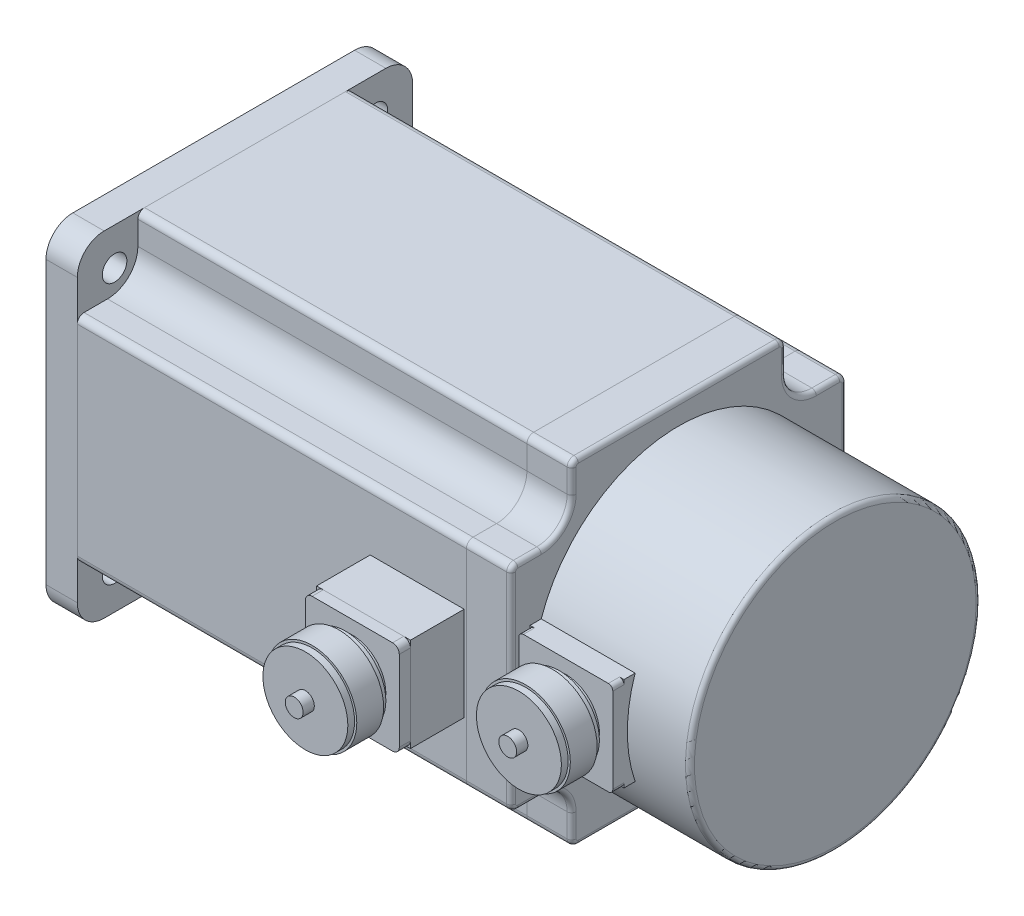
ISO-10303-21;
HEADER;
FILE_DESCRIPTION(('STEP AP214'),'2;1');
FILE_NAME('part.step','',(''),(''),'','','');
FILE_SCHEMA(('AUTOMOTIVE_DESIGN { 1 0 10303 214 1 1 1 1 }'));
ENDSEC;
DATA;
#1=APPLICATION_CONTEXT('core data for automotive mechanical design processes');
#2=APPLICATION_PROTOCOL_DEFINITION('international standard','automotive_design',2000,#1);
#3=PRODUCT_CONTEXT('',#1,'mechanical');
#4=PRODUCT('Part','Part','',(#3));
#5=PRODUCT_RELATED_PRODUCT_CATEGORY('part','',(#4));
#6=PRODUCT_DEFINITION_FORMATION('','',#4);
#7=PRODUCT_DEFINITION_CONTEXT('part definition',#1,'design');
#8=PRODUCT_DEFINITION('design','',#6,#7);
#9=PRODUCT_DEFINITION_SHAPE('','',#8);
#10=(LENGTH_UNIT() NAMED_UNIT(*) SI_UNIT(.MILLI.,.METRE.));
#11=(NAMED_UNIT(*) PLANE_ANGLE_UNIT() SI_UNIT($,.RADIAN.));
#12=(NAMED_UNIT(*) SI_UNIT($,.STERADIAN.) SOLID_ANGLE_UNIT());
#13=UNCERTAINTY_MEASURE_WITH_UNIT(LENGTH_MEASURE(1.E-05),#10,'distance_accuracy_value','');
#14=(GEOMETRIC_REPRESENTATION_CONTEXT(3) GLOBAL_UNCERTAINTY_ASSIGNED_CONTEXT((#13)) GLOBAL_UNIT_ASSIGNED_CONTEXT((#10,
#11,#12)) REPRESENTATION_CONTEXT('',''));
#15=CARTESIAN_POINT('',(0.,0.,0.));
#16=DIRECTION('',(0.,0.,1.));
#17=DIRECTION('',(1.,0.,0.));
#18=AXIS2_PLACEMENT_3D('',#15,#16,#17);
#19=CARTESIAN_POINT('',(-238.,-17.,0.));
#20=DIRECTION('',(0.,1.,0.));
#21=DIRECTION('',(0.,0.,1.));
#22=AXIS2_PLACEMENT_3D('',#19,#20,#21);
#23=CYLINDRICAL_SURFACE('',#22,3.99999999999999);
#24=CARTESIAN_POINT('',(-238.,-9.,0.));
#25=DIRECTION('',(0.,-1.,0.));
#26=DIRECTION('',(0.,0.,-1.));
#27=AXIS2_PLACEMENT_3D('',#24,#25,#26);
#28=CIRCLE('',#27,3.99999999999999);
#29=CARTESIAN_POINT('',(-238.,-9.,3.99999999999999));
#30=VERTEX_POINT('',#29);
#31=CARTESIAN_POINT('',(-238.,-9.,-3.99999999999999));
#32=VERTEX_POINT('',#31);
#33=EDGE_CURVE('E107',#30,#32,#28,.T.);
#34=ORIENTED_EDGE('',*,*,#33,.T.);
#35=DIRECTION('',(0.,1.,0.));
#36=VECTOR('',#35,1.);
#37=CARTESIAN_POINT('',(-238.,-17.,-3.99999999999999));
#38=LINE('',#37,#36);
#39=CARTESIAN_POINT('',(-238.,-17.,-3.99999999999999));
#40=VERTEX_POINT('',#39);
#41=EDGE_CURVE('E12',#40,#32,#38,.T.);
#42=ORIENTED_EDGE('',*,*,#41,.F.);
#43=CARTESIAN_POINT('',(-238.,-17.,0.));
#44=DIRECTION('',(0.,-1.,0.));
#45=DIRECTION('',(0.,0.,-1.));
#46=AXIS2_PLACEMENT_3D('',#43,#44,#45);
#47=CIRCLE('',#46,3.99999999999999);
#48=CARTESIAN_POINT('',(-238.,-17.,3.99999999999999));
#49=VERTEX_POINT('',#48);
#50=EDGE_CURVE('E95',#49,#40,#47,.T.);
#51=ORIENTED_EDGE('',*,*,#50,.F.);
#52=DIRECTION('',(0.,1.,0.));
#53=VECTOR('',#52,1.);
#54=CARTESIAN_POINT('',(-238.,-17.,3.99999999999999));
#55=LINE('',#54,#53);
#56=EDGE_CURVE('E103',#49,#30,#55,.T.);
#57=ORIENTED_EDGE('',*,*,#56,.T.);
#58=EDGE_LOOP('',(#34,#42,#51,#57));
#59=FACE_BOUND('',#58,.T.);
#60=ADVANCED_FACE('F44',(#59),#23,.T.);
#61=CARTESIAN_POINT('',(-201.,-17.,-3.99999999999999));
#62=DIRECTION('',(0.,0.,1.));
#63=DIRECTION('',(1.,0.,0.));
#64=AXIS2_PLACEMENT_3D('',#61,#62,#63);
#65=PLANE('',#64);
#66=DIRECTION('',(1.,0.,0.));
#67=VECTOR('',#66,1.);
#68=CARTESIAN_POINT('',(-201.,-9.,-3.99999999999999));
#69=LINE('',#68,#67);
#70=CARTESIAN_POINT('',(-201.,-9.,-3.99999999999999));
#71=VERTEX_POINT('',#70);
#72=EDGE_CURVE('E99',#32,#71,#69,.T.);
#73=ORIENTED_EDGE('',*,*,#72,.T.);
#74=DIRECTION('',(0.,1.,0.));
#75=VECTOR('',#74,1.);
#76=CARTESIAN_POINT('',(-201.,-17.,-3.99999999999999));
#77=LINE('',#76,#75);
#78=CARTESIAN_POINT('',(-201.,-17.,-3.99999999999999));
#79=VERTEX_POINT('',#78);
#80=EDGE_CURVE('E52',#79,#71,#77,.T.);
#81=ORIENTED_EDGE('',*,*,#80,.F.);
#82=DIRECTION('',(1.,0.,0.));
#83=VECTOR('',#82,1.);
#84=CARTESIAN_POINT('',(-201.,-17.,-3.99999999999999));
#85=LINE('',#84,#83);
#86=EDGE_CURVE('E90',#40,#79,#85,.T.);
#87=ORIENTED_EDGE('',*,*,#86,.F.);
#88=ORIENTED_EDGE('',*,*,#41,.T.);
#89=EDGE_LOOP('',(#73,#81,#87,#88));
#90=FACE_BOUND('',#89,.T.);
#91=ADVANCED_FACE('F98',(#90),#65,.F.);
#92=CARTESIAN_POINT('',(-201.,-17.,0.));
#93=DIRECTION('',(0.,1.,0.));
#94=DIRECTION('',(0.,0.,1.));
#95=AXIS2_PLACEMENT_3D('',#92,#93,#94);
#96=CYLINDRICAL_SURFACE('',#95,3.99999999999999);
#97=CARTESIAN_POINT('',(-201.,-9.,0.));
#98=DIRECTION('',(0.,-1.,0.));
#99=DIRECTION('',(0.,0.,-1.));
#100=AXIS2_PLACEMENT_3D('',#97,#98,#99);
#101=CIRCLE('',#100,3.99999999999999);
#102=CARTESIAN_POINT('',(-201.,-9.,3.99999999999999));
#103=VERTEX_POINT('',#102);
#104=EDGE_CURVE('E77',#71,#103,#101,.T.);
#105=ORIENTED_EDGE('',*,*,#104,.T.);
#106=DIRECTION('',(0.,1.,0.));
#107=VECTOR('',#106,1.);
#108=CARTESIAN_POINT('',(-201.,-17.,3.99999999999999));
#109=LINE('',#108,#107);
#110=CARTESIAN_POINT('',(-201.,-17.,3.99999999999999));
#111=VERTEX_POINT('',#110);
#112=EDGE_CURVE('E100',#111,#103,#109,.T.);
#113=ORIENTED_EDGE('',*,*,#112,.F.);
#114=CARTESIAN_POINT('',(-201.,-17.,0.));
#115=DIRECTION('',(0.,-1.,0.));
#116=DIRECTION('',(0.,0.,-1.));
#117=AXIS2_PLACEMENT_3D('',#114,#115,#116);
#118=CIRCLE('',#117,3.99999999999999);
#119=EDGE_CURVE('E93',#79,#111,#118,.T.);
#120=ORIENTED_EDGE('',*,*,#119,.F.);
#121=ORIENTED_EDGE('',*,*,#80,.T.);
#122=EDGE_LOOP('',(#105,#113,#120,#121));
#123=FACE_BOUND('',#122,.T.);
#124=ADVANCED_FACE('F101',(#123),#96,.T.);
#125=CARTESIAN_POINT('',(-238.,-17.,3.99999999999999));
#126=DIRECTION('',(0.,0.,-1.));
#127=DIRECTION('',(-1.,0.,0.));
#128=AXIS2_PLACEMENT_3D('',#125,#126,#127);
#129=PLANE('',#128);
#130=DIRECTION('',(-1.,0.,0.));
#131=VECTOR('',#130,1.);
#132=CARTESIAN_POINT('',(-238.,-9.,3.99999999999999));
#133=LINE('',#132,#131);
#134=EDGE_CURVE('E83',#103,#30,#133,.T.);
#135=ORIENTED_EDGE('',*,*,#134,.T.);
#136=ORIENTED_EDGE('',*,*,#56,.F.);
#137=DIRECTION('',(-1.,0.,0.));
#138=VECTOR('',#137,1.);
#139=CARTESIAN_POINT('',(-238.,-17.,3.99999999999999));
#140=LINE('',#139,#138);
#141=EDGE_CURVE('E60',#111,#49,#140,.T.);
#142=ORIENTED_EDGE('',*,*,#141,.F.);
#143=ORIENTED_EDGE('',*,*,#112,.T.);
#144=EDGE_LOOP('',(#135,#136,#142,#143));
#145=FACE_BOUND('',#144,.T.);
#146=ADVANCED_FACE('F114',(#145),#129,.F.);
#147=CARTESIAN_POINT('',(-238.,-17.,0.));
#148=DIRECTION('',(0.,-1.,0.));
#149=DIRECTION('',(0.,0.,-1.));
#150=AXIS2_PLACEMENT_3D('',#147,#148,#149);
#151=PLANE('',#150);
#152=ORIENTED_EDGE('',*,*,#50,.T.);
#153=ORIENTED_EDGE('',*,*,#86,.T.);
#154=ORIENTED_EDGE('',*,*,#119,.T.);
#155=ORIENTED_EDGE('',*,*,#141,.T.);
#156=EDGE_LOOP('',(#152,#153,#154,#155));
#157=FACE_BOUND('',#156,.T.);
#158=ADVANCED_FACE('F91',(#157),#151,.T.);
#159=CARTESIAN_POINT('',(-238.,-9.,0.));
#160=DIRECTION('',(0.,-1.,0.));
#161=DIRECTION('',(0.,0.,-1.));
#162=AXIS2_PLACEMENT_3D('',#159,#160,#161);
#163=PLANE('',#162);
#164=ORIENTED_EDGE('',*,*,#33,.F.);
#165=ORIENTED_EDGE('',*,*,#134,.F.);
#166=ORIENTED_EDGE('',*,*,#104,.F.);
#167=ORIENTED_EDGE('',*,*,#72,.F.);
#168=EDGE_LOOP('',(#164,#165,#166,#167));
#169=FACE_BOUND('',#168,.T.);
#170=ADVANCED_FACE('F117',(#169),#163,.F.);
#171=CLOSED_SHELL('',(#60,#91,#124,#146,#158,#170));
#172=MANIFOLD_SOLID_BREP('B2',#171);
#173=CARTESIAN_POINT('',(-246.,0.,0.));
#174=DIRECTION('',(1.,0.,0.));
#175=DIRECTION('',(0.,0.,-1.));
#176=AXIS2_PLACEMENT_3D('',#173,#174,#175);
#177=CYLINDRICAL_SURFACE('',#176,14.);
#178=CARTESIAN_POINT('',(-245.5,0.,0.));
#179=DIRECTION('',(-1.,0.,0.));
#180=DIRECTION('',(0.,0.,1.));
#181=AXIS2_PLACEMENT_3D('',#178,#179,#180);
#182=CIRCLE('',#181,14.);
#183=CARTESIAN_POINT('',(-245.5,0.,14.));
#184=VERTEX_POINT('',#183);
#185=EDGE_CURVE('E253',#184,#184,#182,.F.);
#186=ORIENTED_EDGE('',*,*,#185,.T.);
#187=EDGE_LOOP('',(#186));
#188=FACE_BOUND('',#187,.T.);
#189=CARTESIAN_POINT('',(-193.5,0.,0.));
#190=DIRECTION('',(-1.,0.,0.));
#191=DIRECTION('',(0.,0.,1.));
#192=AXIS2_PLACEMENT_3D('',#189,#190,#191);
#193=CIRCLE('',#192,14.);
#194=CARTESIAN_POINT('',(-193.5,0.,14.));
#195=VERTEX_POINT('',#194);
#196=EDGE_CURVE('E235',#195,#195,#193,.T.);
#197=ORIENTED_EDGE('',*,*,#196,.T.);
#198=EDGE_LOOP('',(#197));
#199=FACE_BOUND('',#198,.T.);
#200=CARTESIAN_POINT('',(-201.,-13.4164078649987,-3.99999999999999));
#201=CARTESIAN_POINT('',(-200.889963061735,-13.4163934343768,-4.00001343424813));
#202=CARTESIAN_POINT('',(-200.779934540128,-13.417761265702,-3.99545969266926));
#203=CARTESIAN_POINT('',(-200.560712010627,-13.4231542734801,-3.97732232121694));
#204=CARTESIAN_POINT('',(-200.451517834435,-13.4271788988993,-3.96374056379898));
#205=CARTESIAN_POINT('',(-200.234991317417,-13.4377658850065,-3.9276941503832));
#206=CARTESIAN_POINT('',(-200.127655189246,-13.4443222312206,-3.90525054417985));
#207=CARTESIAN_POINT('',(-199.915366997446,-13.4597622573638,-3.85169716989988));
#208=CARTESIAN_POINT('',(-199.810414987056,-13.4686459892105,-3.82058720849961));
#209=CARTESIAN_POINT('',(-199.500282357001,-13.4984072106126,-3.71462722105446));
#210=CARTESIAN_POINT('',(-199.299567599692,-13.5224082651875,-3.62710377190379));
#211=CARTESIAN_POINT('',(-198.915683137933,-13.5760110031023,-3.4209933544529));
#212=CARTESIAN_POINT('',(-198.732520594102,-13.6056149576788,-3.30239378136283));
#213=CARTESIAN_POINT('',(-198.383630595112,-13.6680345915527,-3.03385514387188));
#214=CARTESIAN_POINT('',(-198.21847497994,-13.7009134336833,-2.88318637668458));
#215=CARTESIAN_POINT('',(-197.91539864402,-13.7656378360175,-2.55635049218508));
#216=CARTESIAN_POINT('',(-197.777482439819,-13.7974832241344,-2.38017915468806));
#217=CARTESIAN_POINT('',(-197.53034061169,-13.8572672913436,-2.0032879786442));
#218=CARTESIAN_POINT('',(-197.42169609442,-13.885122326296,-1.80217262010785));
#219=CARTESIAN_POINT('',(-197.239992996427,-13.9330517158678,-1.38360719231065));
#220=CARTESIAN_POINT('',(-197.166925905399,-13.9531279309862,-1.16616104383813));
#221=CARTESIAN_POINT('',(-197.060331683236,-13.9827902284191,-0.727119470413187));
#222=CARTESIAN_POINT('',(-197.025822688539,-13.9926363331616,-0.505780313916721));
#223=CARTESIAN_POINT('',(-196.994226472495,-14.0016419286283,-0.0602449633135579));
#224=CARTESIAN_POINT('',(-196.997132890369,-14.0008032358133,0.163950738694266));
#225=CARTESIAN_POINT('',(-197.039612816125,-13.9887201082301,0.601961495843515));
#226=CARTESIAN_POINT('',(-197.078123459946,-13.9777773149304,0.815889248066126));
#227=CARTESIAN_POINT('',(-197.188991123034,-13.9470775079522,1.2341066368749));
#228=CARTESIAN_POINT('',(-197.261349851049,-13.9273200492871,1.43839578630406));
#229=CARTESIAN_POINT('',(-197.438618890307,-13.8807804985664,1.83414901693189));
#230=CARTESIAN_POINT('',(-197.543876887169,-13.853923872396,2.02544821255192));
#231=CARTESIAN_POINT('',(-197.783693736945,-13.7960546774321,2.38801825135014));
#232=CARTESIAN_POINT('',(-197.918258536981,-13.7650412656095,2.55928501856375));
#233=CARTESIAN_POINT('',(-198.218386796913,-13.7009177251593,2.88324485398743));
#234=CARTESIAN_POINT('',(-198.384870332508,-13.6677722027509,3.03507809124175));
#235=CARTESIAN_POINT('',(-198.741426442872,-13.6040627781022,3.30897556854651));
#236=CARTESIAN_POINT('',(-198.931505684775,-13.573499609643,3.43103136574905));
#237=CARTESIAN_POINT('',(-199.231158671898,-13.5321405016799,3.58945338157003));
#238=CARTESIAN_POINT('',(-199.333989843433,-13.5190503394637,3.63832313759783));
#239=CARTESIAN_POINT('',(-199.543626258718,-13.4948216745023,3.72718558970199));
#240=CARTESIAN_POINT('',(-199.650429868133,-13.4836823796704,3.767181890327));
#241=CARTESIAN_POINT('',(-199.867138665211,-13.463719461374,3.83791732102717));
#242=CARTESIAN_POINT('',(-199.977040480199,-13.4548934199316,3.86866612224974));
#243=CARTESIAN_POINT('',(-200.199195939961,-13.4398293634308,3.92067829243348));
#244=CARTESIAN_POINT('',(-200.311448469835,-13.4335901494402,3.94194605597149));
#245=CARTESIAN_POINT('',(-200.519732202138,-13.4246640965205,3.97223001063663));
#246=CARTESIAN_POINT('',(-200.615545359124,-13.4215735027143,3.98264484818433));
#247=CARTESIAN_POINT('',(-200.807569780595,-13.4174428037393,3.99652828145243));
#248=CARTESIAN_POINT('',(-200.903780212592,-13.4163995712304,4.0000074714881));
#249=CARTESIAN_POINT('',(-201.,-13.4164078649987,3.99999999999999));
#250=B_SPLINE_CURVE_WITH_KNOTS('',3,(#200,#201,#202,#203,#204,#205,#206,#207,#208,#209,#210,
#211,#212,#213,#214,#215,#216,#217,#218,#219,#220,#221,#222,#223,#224,#225,#226,#227,#228,#229,
#230,#231,#232,#233,#234,#235,#236,#237,#238,#239,#240,#241,#242,#243,#244,#245,#246,#247,#248,
#249),.UNSPECIFIED.,.F.,.F.,(4,2,2,2,2,2,2,2,2,2,2,2,2,2,2,2,2,2,2,2,2,2,2,2,4),(0.,
0.329993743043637,0.65991906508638,0.989065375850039,1.31821902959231,1.97575167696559,
2.6335514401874,3.30832474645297,3.98320984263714,4.67064278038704,5.35791119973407,
6.02724874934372,6.69647251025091,7.34634193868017,7.99624417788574,8.65326120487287,
9.31041168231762,9.99056134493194,10.6709036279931,11.0143588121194,11.3576742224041,
11.700629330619,12.0434253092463,12.3324405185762,12.6210139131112),.UNSPECIFIED.);
#251=CARTESIAN_POINT('',(-201.,-13.4164078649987,-3.99999999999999));
#252=VERTEX_POINT('',#251);
#253=CARTESIAN_POINT('',(-201.,-13.4164078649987,3.99999999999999));
#254=VERTEX_POINT('',#253);
#255=EDGE_CURVE('E256',#252,#254,#250,.T.);
#256=ORIENTED_EDGE('',*,*,#255,.F.);
#257=DIRECTION('',(1.,0.,0.));
#258=VECTOR('',#257,1.);
#259=CARTESIAN_POINT('',(-246.,-13.4164078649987,-3.99999999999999));
#260=LINE('',#259,#258);
#261=CARTESIAN_POINT('',(-238.,-13.4164078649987,-3.99999999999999));
#262=VERTEX_POINT('',#261);
#263=EDGE_CURVE('E42',#262,#252,#260,.T.);
#264=ORIENTED_EDGE('',*,*,#263,.F.);
#265=CARTESIAN_POINT('',(-238.,-13.4164078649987,3.99999999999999));
#266=CARTESIAN_POINT('',(-238.110036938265,-13.4163934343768,4.00001343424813));
#267=CARTESIAN_POINT('',(-238.220065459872,-13.417761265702,3.99545969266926));
#268=CARTESIAN_POINT('',(-238.439287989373,-13.4231542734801,3.97732232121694));
#269=CARTESIAN_POINT('',(-238.548482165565,-13.4271788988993,3.96374056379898));
#270=CARTESIAN_POINT('',(-238.765008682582,-13.4377658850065,3.92769415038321));
#271=CARTESIAN_POINT('',(-238.872344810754,-13.4443222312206,3.90525054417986));
#272=CARTESIAN_POINT('',(-239.084633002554,-13.4597622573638,3.85169716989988));
#273=CARTESIAN_POINT('',(-239.189585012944,-13.4686459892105,3.82058720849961));
#274=CARTESIAN_POINT('',(-239.499717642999,-13.4984072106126,3.71462722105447));
#275=CARTESIAN_POINT('',(-239.700432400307,-13.5224082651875,3.62710377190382));
#276=CARTESIAN_POINT('',(-240.084316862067,-13.5760110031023,3.42099335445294));
#277=CARTESIAN_POINT('',(-240.267479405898,-13.6056149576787,3.30239378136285));
#278=CARTESIAN_POINT('',(-240.616369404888,-13.6680345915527,3.03385514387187));
#279=CARTESIAN_POINT('',(-240.78152502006,-13.7009134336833,2.88318637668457));
#280=CARTESIAN_POINT('',(-241.08460135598,-13.7656378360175,2.55635049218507));
#281=CARTESIAN_POINT('',(-241.222517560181,-13.7974832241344,2.38017915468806));
#282=CARTESIAN_POINT('',(-241.46965938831,-13.8572672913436,2.00328797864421));
#283=CARTESIAN_POINT('',(-241.57830390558,-13.885122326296,1.80217262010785));
#284=CARTESIAN_POINT('',(-241.760007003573,-13.9330517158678,1.38360719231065));
#285=CARTESIAN_POINT('',(-241.833074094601,-13.9531279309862,1.16616104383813));
#286=CARTESIAN_POINT('',(-241.939668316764,-13.9827902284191,0.727119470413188));
#287=CARTESIAN_POINT('',(-241.974177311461,-13.9926363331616,0.505780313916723));
#288=CARTESIAN_POINT('',(-242.005773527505,-14.0016419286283,0.0602449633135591));
#289=CARTESIAN_POINT('',(-242.002867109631,-14.0008032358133,-0.163950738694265));
#290=CARTESIAN_POINT('',(-241.960387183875,-13.9887201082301,-0.601961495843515));
#291=CARTESIAN_POINT('',(-241.921876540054,-13.9777773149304,-0.815889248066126));
#292=CARTESIAN_POINT('',(-241.811008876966,-13.9470775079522,-1.2341066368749));
#293=CARTESIAN_POINT('',(-241.738650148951,-13.9273200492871,-1.43839578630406));
#294=CARTESIAN_POINT('',(-241.561381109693,-13.8807804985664,-1.83414901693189));
#295=CARTESIAN_POINT('',(-241.456123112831,-13.853923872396,-2.02544821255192));
#296=CARTESIAN_POINT('',(-241.216306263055,-13.7960546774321,-2.38801825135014));
#297=CARTESIAN_POINT('',(-241.081741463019,-13.7650412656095,-2.55928501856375));
#298=CARTESIAN_POINT('',(-240.781613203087,-13.7009177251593,-2.88324485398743));
#299=CARTESIAN_POINT('',(-240.615129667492,-13.6677722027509,-3.03507809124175));
#300=CARTESIAN_POINT('',(-240.258573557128,-13.6040627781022,-3.30897556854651));
#301=CARTESIAN_POINT('',(-240.068494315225,-13.573499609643,-3.43103136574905));
#302=CARTESIAN_POINT('',(-239.768841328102,-13.5321405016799,-3.58945338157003));
#303=CARTESIAN_POINT('',(-239.666010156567,-13.5190503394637,-3.63832313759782));
#304=CARTESIAN_POINT('',(-239.456373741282,-13.4948216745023,-3.72718558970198));
#305=CARTESIAN_POINT('',(-239.349570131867,-13.4836823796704,-3.76718189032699));
#306=CARTESIAN_POINT('',(-239.132861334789,-13.463719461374,-3.83791732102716));
#307=CARTESIAN_POINT('',(-239.022959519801,-13.4548934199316,-3.86866612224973));
#308=CARTESIAN_POINT('',(-238.800804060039,-13.4398293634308,-3.92067829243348));
#309=CARTESIAN_POINT('',(-238.688551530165,-13.4335901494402,-3.94194605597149));
#310=CARTESIAN_POINT('',(-238.480267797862,-13.4246640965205,-3.97223001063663));
#311=CARTESIAN_POINT('',(-238.384454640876,-13.4215735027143,-3.98264484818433));
#312=CARTESIAN_POINT('',(-238.192430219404,-13.4174428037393,-3.99652828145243));
#313=CARTESIAN_POINT('',(-238.096219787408,-13.4163995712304,-4.0000074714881));
#314=CARTESIAN_POINT('',(-238.,-13.4164078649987,-3.99999999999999));
#315=B_SPLINE_CURVE_WITH_KNOTS('',3,(#265,#266,#267,#268,#269,#270,#271,#272,#273,#274,#275,
#276,#277,#278,#279,#280,#281,#282,#283,#284,#285,#286,#287,#288,#289,#290,#291,#292,#293,#294,
#295,#296,#297,#298,#299,#300,#301,#302,#303,#304,#305,#306,#307,#308,#309,#310,#311,#312,#313,
#314),.UNSPECIFIED.,.F.,.F.,(4,2,2,2,2,2,2,2,2,2,2,2,2,2,2,2,2,2,2,2,2,2,2,2,4),(0.,
0.329993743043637,0.659919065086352,0.98906537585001,1.31821902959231,1.97575167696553,
2.6335514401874,3.30832474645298,3.98320984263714,4.67064278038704,5.35791119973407,
6.02724874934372,6.69647251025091,7.34634193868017,7.99624417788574,8.65326120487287,
9.31041168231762,9.99056134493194,10.6709036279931,11.0143588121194,11.357674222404,
11.700629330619,12.0434253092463,12.3324405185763,12.6210139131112),.UNSPECIFIED.);
#316=CARTESIAN_POINT('',(-238.,-13.4164078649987,3.99999999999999));
#317=VERTEX_POINT('',#316);
#318=EDGE_CURVE('E184',#317,#262,#315,.T.);
#319=ORIENTED_EDGE('',*,*,#318,.F.);
#320=DIRECTION('',(1.,0.,0.));
#321=VECTOR('',#320,1.);
#322=CARTESIAN_POINT('',(-246.,-13.4164078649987,3.99999999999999));
#323=LINE('',#322,#321);
#324=EDGE_CURVE('E234',#254,#317,#323,.F.);
#325=ORIENTED_EDGE('',*,*,#324,.F.);
#326=EDGE_LOOP('',(#256,#264,#319,#325));
#327=FACE_BOUND('',#326,.T.);
#328=ADVANCED_FACE('F176',(#188,#199,#327),#177,.T.);
#329=CARTESIAN_POINT('',(-193.5,0.,0.));
#330=DIRECTION('',(-1.,0.,0.));
#331=DIRECTION('',(0.,0.,1.));
#332=AXIS2_PLACEMENT_3D('',#329,#330,#331);
#333=PLANE('',#332);
#334=CARTESIAN_POINT('',(-193.5,0.,0.));
#335=DIRECTION('',(-1.,0.,0.));
#336=DIRECTION('',(0.,0.,1.));
#337=AXIS2_PLACEMENT_3D('',#334,#335,#336);
#338=CIRCLE('',#337,17.);
#339=CARTESIAN_POINT('',(-193.5,0.,17.));
#340=VERTEX_POINT('',#339);
#341=EDGE_CURVE('E247',#340,#340,#338,.T.);
#342=ORIENTED_EDGE('',*,*,#341,.T.);
#343=EDGE_LOOP('',(#342));
#344=FACE_BOUND('',#343,.T.);
#345=ORIENTED_EDGE('',*,*,#196,.F.);
#346=EDGE_LOOP('',(#345));
#347=FACE_BOUND('',#346,.T.);
#348=ADVANCED_FACE('F293',(#344,#347),#333,.T.);
#349=CARTESIAN_POINT('',(-193.,0.,0.));
#350=DIRECTION('',(-1.,0.,0.));
#351=DIRECTION('',(0.,0.,1.));
#352=AXIS2_PLACEMENT_3D('',#349,#350,#351);
#353=PLANE('',#352);
#354=CARTESIAN_POINT('',(-193.,0.,0.));
#355=DIRECTION('',(-1.,0.,0.));
#356=DIRECTION('',(0.,0.,1.));
#357=AXIS2_PLACEMENT_3D('',#354,#355,#356);
#358=CIRCLE('',#357,17.5);
#359=CARTESIAN_POINT('',(-193.,0.,17.5));
#360=VERTEX_POINT('',#359);
#361=EDGE_CURVE('E239',#360,#360,#358,.T.);
#362=ORIENTED_EDGE('',*,*,#361,.F.);
#363=EDGE_LOOP('',(#362));
#364=FACE_BOUND('',#363,.T.);
#365=ADVANCED_FACE('F298',(#364),#353,.F.);
#366=CARTESIAN_POINT('',(-193.,0.,0.));
#367=DIRECTION('',(-1.,0.,0.));
#368=DIRECTION('',(0.,0.,1.));
#369=AXIS2_PLACEMENT_3D('',#366,#367,#368);
#370=TOROIDAL_SURFACE('',#369,17.,0.5);
#371=ORIENTED_EDGE('',*,*,#361,.T.);
#372=EDGE_LOOP('',(#371));
#373=FACE_BOUND('',#372,.T.);
#374=ORIENTED_EDGE('',*,*,#341,.F.);
#375=EDGE_LOOP('',(#374));
#376=FACE_BOUND('',#375,.T.);
#377=ADVANCED_FACE('F310',(#373,#376),#370,.T.);
#378=CARTESIAN_POINT('',(-246.,0.,0.));
#379=DIRECTION('',(-1.,0.,0.));
#380=DIRECTION('',(0.,0.,1.));
#381=AXIS2_PLACEMENT_3D('',#378,#379,#380);
#382=PLANE('',#381);
#383=CARTESIAN_POINT('',(-246.,0.,0.));
#384=DIRECTION('',(-1.,0.,0.));
#385=DIRECTION('',(0.,0.,1.));
#386=AXIS2_PLACEMENT_3D('',#383,#384,#385);
#387=CIRCLE('',#386,13.5);
#388=CARTESIAN_POINT('',(-246.,0.,13.5));
#389=VERTEX_POINT('',#388);
#390=EDGE_CURVE('E250',#389,#389,#387,.T.);
#391=ORIENTED_EDGE('',*,*,#390,.T.);
#392=EDGE_LOOP('',(#391));
#393=FACE_BOUND('',#392,.T.);
#394=ADVANCED_FACE('F278',(#393),#382,.T.);
#395=CARTESIAN_POINT('',(-246.,0.,0.));
#396=DIRECTION('',(1.,0.,0.));
#397=DIRECTION('',(0.,0.,-1.));
#398=AXIS2_PLACEMENT_3D('',#395,#396,#397);
#399=CONICAL_SURFACE('',#398,13.5,0.785398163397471);
#400=ORIENTED_EDGE('',*,*,#185,.F.);
#401=EDGE_LOOP('',(#400));
#402=FACE_BOUND('',#401,.T.);
#403=ORIENTED_EDGE('',*,*,#390,.F.);
#404=EDGE_LOOP('',(#403));
#405=FACE_BOUND('',#404,.T.);
#406=ADVANCED_FACE('F178',(#402,#405),#399,.T.);
#407=CARTESIAN_POINT('',(-238.,-9.,0.));
#408=DIRECTION('',(0.,-1.,0.));
#409=DIRECTION('',(0.,0.,-1.));
#410=AXIS2_PLACEMENT_3D('',#407,#408,#409);
#411=CYLINDRICAL_SURFACE('',#410,3.99999999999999);
#412=DIRECTION('',(0.,-1.,0.));
#413=VECTOR('',#412,1.);
#414=CARTESIAN_POINT('',(-238.,-9.,3.99999999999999));
#415=LINE('',#414,#413);
#416=CARTESIAN_POINT('',(-238.,-9.,3.99999999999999));
#417=VERTEX_POINT('',#416);
#418=EDGE_CURVE('E231',#417,#317,#415,.T.);
#419=ORIENTED_EDGE('',*,*,#418,.T.);
#420=ORIENTED_EDGE('',*,*,#318,.T.);
#421=DIRECTION('',(0.,-1.,0.));
#422=VECTOR('',#421,1.);
#423=CARTESIAN_POINT('',(-238.,-9.,-3.99999999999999));
#424=LINE('',#423,#422);
#425=CARTESIAN_POINT('',(-238.,-9.,-3.99999999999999));
#426=VERTEX_POINT('',#425);
#427=EDGE_CURVE('E190',#426,#262,#424,.T.);
#428=ORIENTED_EDGE('',*,*,#427,.F.);
#429=CARTESIAN_POINT('',(-238.,-9.,0.));
#430=DIRECTION('',(0.,1.,0.));
#431=DIRECTION('',(0.,0.,1.));
#432=AXIS2_PLACEMENT_3D('',#429,#430,#431);
#433=CIRCLE('',#432,3.99999999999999);
#434=EDGE_CURVE('E221',#426,#417,#433,.T.);
#435=ORIENTED_EDGE('',*,*,#434,.T.);
#436=EDGE_LOOP('',(#419,#420,#428,#435));
#437=FACE_BOUND('',#436,.T.);
#438=ADVANCED_FACE('F230',(#437),#411,.F.);
#439=CARTESIAN_POINT('',(-238.,-9.,3.99999999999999));
#440=DIRECTION('',(0.,0.,-1.));
#441=DIRECTION('',(-1.,0.,0.));
#442=AXIS2_PLACEMENT_3D('',#439,#440,#441);
#443=PLANE('',#442);
#444=ORIENTED_EDGE('',*,*,#324,.T.);
#445=ORIENTED_EDGE('',*,*,#418,.F.);
#446=DIRECTION('',(1.,0.,0.));
#447=VECTOR('',#446,1.);
#448=CARTESIAN_POINT('',(-238.,-9.,3.99999999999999));
#449=LINE('',#448,#447);
#450=CARTESIAN_POINT('',(-201.,-9.,3.99999999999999));
#451=VERTEX_POINT('',#450);
#452=EDGE_CURVE('E217',#417,#451,#449,.T.);
#453=ORIENTED_EDGE('',*,*,#452,.T.);
#454=DIRECTION('',(0.,-1.,0.));
#455=VECTOR('',#454,1.);
#456=CARTESIAN_POINT('',(-201.,-9.,3.99999999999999));
#457=LINE('',#456,#455);
#458=EDGE_CURVE('E236',#451,#254,#457,.T.);
#459=ORIENTED_EDGE('',*,*,#458,.T.);
#460=EDGE_LOOP('',(#444,#445,#453,#459));
#461=FACE_BOUND('',#460,.T.);
#462=ADVANCED_FACE('F233',(#461),#443,.T.);
#463=CARTESIAN_POINT('',(-201.,-9.,0.));
#464=DIRECTION('',(0.,-1.,0.));
#465=DIRECTION('',(0.,0.,-1.));
#466=AXIS2_PLACEMENT_3D('',#463,#464,#465);
#467=CYLINDRICAL_SURFACE('',#466,3.99999999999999);
#468=DIRECTION('',(0.,-1.,0.));
#469=VECTOR('',#468,1.);
#470=CARTESIAN_POINT('',(-201.,-9.,-3.99999999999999));
#471=LINE('',#470,#469);
#472=CARTESIAN_POINT('',(-201.,-9.,-3.99999999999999));
#473=VERTEX_POINT('',#472);
#474=EDGE_CURVE('E241',#473,#252,#471,.T.);
#475=ORIENTED_EDGE('',*,*,#474,.T.);
#476=ORIENTED_EDGE('',*,*,#255,.T.);
#477=ORIENTED_EDGE('',*,*,#458,.F.);
#478=CARTESIAN_POINT('',(-201.,-9.,0.));
#479=DIRECTION('',(0.,1.,0.));
#480=DIRECTION('',(0.,0.,1.));
#481=AXIS2_PLACEMENT_3D('',#478,#479,#480);
#482=CIRCLE('',#481,3.99999999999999);
#483=EDGE_CURVE('E222',#451,#473,#482,.T.);
#484=ORIENTED_EDGE('',*,*,#483,.T.);
#485=EDGE_LOOP('',(#475,#476,#477,#484));
#486=FACE_BOUND('',#485,.T.);
#487=ADVANCED_FACE('F266',(#486),#467,.F.);
#488=CARTESIAN_POINT('',(-201.,-9.,-3.99999999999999));
#489=DIRECTION('',(0.,0.,1.));
#490=DIRECTION('',(1.,0.,0.));
#491=AXIS2_PLACEMENT_3D('',#488,#489,#490);
#492=PLANE('',#491);
#493=ORIENTED_EDGE('',*,*,#263,.T.);
#494=ORIENTED_EDGE('',*,*,#474,.F.);
#495=DIRECTION('',(-1.,0.,0.));
#496=VECTOR('',#495,1.);
#497=CARTESIAN_POINT('',(-201.,-9.,-3.99999999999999));
#498=LINE('',#497,#496);
#499=EDGE_CURVE('E284',#473,#426,#498,.T.);
#500=ORIENTED_EDGE('',*,*,#499,.T.);
#501=ORIENTED_EDGE('',*,*,#427,.T.);
#502=EDGE_LOOP('',(#493,#494,#500,#501));
#503=FACE_BOUND('',#502,.T.);
#504=ADVANCED_FACE('F271',(#503),#492,.T.);
#505=CARTESIAN_POINT('',(-238.,-9.,0.));
#506=DIRECTION('',(0.,1.,0.));
#507=DIRECTION('',(0.,0.,1.));
#508=AXIS2_PLACEMENT_3D('',#505,#506,#507);
#509=PLANE('',#508);
#510=ORIENTED_EDGE('',*,*,#434,.F.);
#511=ORIENTED_EDGE('',*,*,#499,.F.);
#512=ORIENTED_EDGE('',*,*,#483,.F.);
#513=ORIENTED_EDGE('',*,*,#452,.F.);
#514=EDGE_LOOP('',(#510,#511,#512,#513));
#515=FACE_BOUND('',#514,.T.);
#516=ADVANCED_FACE('F219',(#515),#509,.F.);
#517=CLOSED_SHELL('',(#328,#348,#365,#377,#394,#406,#438,#462,#487,#504,#516));
#518=MANIFOLD_SOLID_BREP('B6',#517);
#519=CARTESIAN_POINT('',(-22.,0.,125.));
#520=DIRECTION('',(0.,0.,1.));
#521=DIRECTION('',(1.,0.,0.));
#522=AXIS2_PLACEMENT_3D('',#519,#520,#521);
#523=PLANE('',#522);
#524=CARTESIAN_POINT('',(-22.,0.,125.));
#525=DIRECTION('',(0.,0.,1.));
#526=DIRECTION('',(1.,0.,0.));
#527=AXIS2_PLACEMENT_3D('',#524,#525,#526);
#528=CIRCLE('',#527,19.);
#529=CARTESIAN_POINT('',(-3.,0.,125.));
#530=VERTEX_POINT('',#529);
#531=EDGE_CURVE('E404',#530,#530,#528,.T.);
#532=ORIENTED_EDGE('',*,*,#531,.T.);
#533=EDGE_LOOP('',(#532));
#534=FACE_BOUND('',#533,.T.);
#535=CARTESIAN_POINT('',(-22.,0.,125.));
#536=DIRECTION('',(0.,0.,1.));
#537=DIRECTION('',(1.,0.,0.));
#538=AXIS2_PLACEMENT_3D('',#535,#536,#537);
#539=CIRCLE('',#538,4.);
#540=CARTESIAN_POINT('',(-18.,0.,125.));
#541=VERTEX_POINT('',#540);
#542=EDGE_CURVE('E412',#541,#541,#539,.T.);
#543=ORIENTED_EDGE('',*,*,#542,.F.);
#544=EDGE_LOOP('',(#543));
#545=FACE_BOUND('',#544,.T.);
#546=ADVANCED_FACE('F393',(#534,#545),#523,.T.);
#547=CARTESIAN_POINT('',(-22.,0.,122.));
#548=DIRECTION('',(0.,0.,1.));
#549=DIRECTION('',(1.,0.,0.));
#550=AXIS2_PLACEMENT_3D('',#547,#548,#549);
#551=PLANE('',#550);
#552=CARTESIAN_POINT('',(-22.,0.,122.));
#553=DIRECTION('',(0.,0.,1.));
#554=DIRECTION('',(1.,0.,0.));
#555=AXIS2_PLACEMENT_3D('',#552,#553,#554);
#556=CIRCLE('',#555,20.);
#557=CARTESIAN_POINT('',(-2.,0.,122.));
#558=VERTEX_POINT('',#557);
#559=EDGE_CURVE('E175',#558,#558,#556,.T.);
#560=ORIENTED_EDGE('',*,*,#559,.T.);
#561=EDGE_LOOP('',(#560));
#562=FACE_BOUND('',#561,.T.);
#563=CARTESIAN_POINT('',(-22.,0.,122.));
#564=DIRECTION('',(0.,0.,1.));
#565=DIRECTION('',(1.,0.,0.));
#566=AXIS2_PLACEMENT_3D('',#563,#564,#565);
#567=CIRCLE('',#566,19.);
#568=CARTESIAN_POINT('',(-3.,0.,122.));
#569=VERTEX_POINT('',#568);
#570=EDGE_CURVE('E406',#569,#569,#567,.T.);
#571=ORIENTED_EDGE('',*,*,#570,.F.);
#572=EDGE_LOOP('',(#571));
#573=FACE_BOUND('',#572,.T.);
#574=ADVANCED_FACE('F428',(#562,#573),#551,.T.);
#575=CARTESIAN_POINT('',(-22.,0.,122.));
#576=DIRECTION('',(0.,0.,-1.));
#577=DIRECTION('',(-1.,0.,0.));
#578=AXIS2_PLACEMENT_3D('',#575,#576,#577);
#579=CYLINDRICAL_SURFACE('',#578,20.);
#580=ORIENTED_EDGE('',*,*,#559,.F.);
#581=EDGE_LOOP('',(#580));
#582=FACE_BOUND('',#581,.T.);
#583=CARTESIAN_POINT('',(-22.,0.,110.));
#584=DIRECTION('',(0.,0.,1.));
#585=DIRECTION('',(1.,0.,0.));
#586=AXIS2_PLACEMENT_3D('',#583,#584,#585);
#587=CIRCLE('',#586,20.);
#588=CARTESIAN_POINT('',(-2.,0.,110.));
#589=VERTEX_POINT('',#588);
#590=EDGE_CURVE('E397',#589,#589,#587,.T.);
#591=ORIENTED_EDGE('',*,*,#590,.T.);
#592=EDGE_LOOP('',(#591));
#593=FACE_BOUND('',#592,.T.);
#594=ADVANCED_FACE('F395',(#582,#593),#579,.T.);
#595=CARTESIAN_POINT('',(-22.,0.,110.));
#596=DIRECTION('',(0.,0.,1.));
#597=DIRECTION('',(1.,0.,0.));
#598=AXIS2_PLACEMENT_3D('',#595,#596,#597);
#599=PLANE('',#598);
#600=ORIENTED_EDGE('',*,*,#590,.F.);
#601=EDGE_LOOP('',(#600));
#602=FACE_BOUND('',#601,.T.);
#603=ADVANCED_FACE('F438',(#602),#599,.F.);
#604=CARTESIAN_POINT('',(-22.,0.,125.));
#605=DIRECTION('',(0.,0.,-1.));
#606=DIRECTION('',(-1.,0.,0.));
#607=AXIS2_PLACEMENT_3D('',#604,#605,#606);
#608=CYLINDRICAL_SURFACE('',#607,19.);
#609=ORIENTED_EDGE('',*,*,#531,.F.);
#610=EDGE_LOOP('',(#609));
#611=FACE_BOUND('',#610,.T.);
#612=ORIENTED_EDGE('',*,*,#570,.T.);
#613=EDGE_LOOP('',(#612));
#614=FACE_BOUND('',#613,.T.);
#615=ADVANCED_FACE('F423',(#611,#614),#608,.T.);
#616=CARTESIAN_POINT('',(-22.,0.,130.));
#617=DIRECTION('',(0.,0.,-1.));
#618=DIRECTION('',(-1.,0.,0.));
#619=AXIS2_PLACEMENT_3D('',#616,#617,#618);
#620=CYLINDRICAL_SURFACE('',#619,4.);
#621=CARTESIAN_POINT('',(-22.,0.,130.));
#622=DIRECTION('',(0.,0.,1.));
#623=DIRECTION('',(1.,0.,0.));
#624=AXIS2_PLACEMENT_3D('',#621,#622,#623);
#625=CIRCLE('',#624,4.);
#626=CARTESIAN_POINT('',(-18.,0.,130.));
#627=VERTEX_POINT('',#626);
#628=EDGE_CURVE('E409',#627,#627,#625,.T.);
#629=ORIENTED_EDGE('',*,*,#628,.F.);
#630=EDGE_LOOP('',(#629));
#631=FACE_BOUND('',#630,.T.);
#632=ORIENTED_EDGE('',*,*,#542,.T.);
#633=EDGE_LOOP('',(#632));
#634=FACE_BOUND('',#633,.T.);
#635=ADVANCED_FACE('F420',(#631,#634),#620,.T.);
#636=CARTESIAN_POINT('',(-22.,0.,130.));
#637=DIRECTION('',(0.,0.,1.));
#638=DIRECTION('',(1.,0.,0.));
#639=AXIS2_PLACEMENT_3D('',#636,#637,#638);
#640=PLANE('',#639);
#641=ORIENTED_EDGE('',*,*,#628,.T.);
#642=EDGE_LOOP('',(#641));
#643=FACE_BOUND('',#642,.T.);
#644=ADVANCED_FACE('F418',(#643),#640,.T.);
#645=CLOSED_SHELL('',(#546,#574,#594,#603,#615,#635,#644));
#646=MANIFOLD_SOLID_BREP('B36',#645);
#647=CARTESIAN_POINT('',(-22.,0.,110.));
#648=DIRECTION('',(0.,0.,-1.));
#649=DIRECTION('',(-1.,0.,0.));
#650=AXIS2_PLACEMENT_3D('',#647,#648,#649);
#651=CYLINDRICAL_SURFACE('',#650,18.);
#652=CARTESIAN_POINT('',(-22.,0.,110.));
#653=DIRECTION('',(0.,0.,1.));
#654=DIRECTION('',(1.,0.,0.));
#655=AXIS2_PLACEMENT_3D('',#652,#653,#654);
#656=CIRCLE('',#655,18.);
#657=CARTESIAN_POINT('',(-4.,0.,110.));
#658=VERTEX_POINT('',#657);
#659=EDGE_CURVE('E392',#658,#658,#656,.T.);
#660=ORIENTED_EDGE('',*,*,#659,.F.);
#661=EDGE_LOOP('',(#660));
#662=FACE_BOUND('',#661,.T.);
#663=CARTESIAN_POINT('',(-22.,0.,107.));
#664=DIRECTION('',(0.,0.,1.));
#665=DIRECTION('',(1.,0.,0.));
#666=AXIS2_PLACEMENT_3D('',#663,#664,#665);
#667=CIRCLE('',#666,18.);
#668=CARTESIAN_POINT('',(-4.,0.,107.));
#669=VERTEX_POINT('',#668);
#670=EDGE_CURVE('E505',#669,#669,#667,.T.);
#671=ORIENTED_EDGE('',*,*,#670,.T.);
#672=EDGE_LOOP('',(#671));
#673=FACE_BOUND('',#672,.T.);
#674=ADVANCED_FACE('F502',(#662,#673),#651,.T.);
#675=CARTESIAN_POINT('',(-22.,0.,110.));
#676=DIRECTION('',(0.,0.,1.));
#677=DIRECTION('',(1.,0.,0.));
#678=AXIS2_PLACEMENT_3D('',#675,#676,#677);
#679=PLANE('',#678);
#680=ORIENTED_EDGE('',*,*,#659,.T.);
#681=EDGE_LOOP('',(#680));
#682=FACE_BOUND('',#681,.T.);
#683=ADVANCED_FACE('F517',(#682),#679,.T.);
#684=CARTESIAN_POINT('',(-22.,0.,107.));
#685=DIRECTION('',(0.,0.,1.));
#686=DIRECTION('',(1.,0.,0.));
#687=AXIS2_PLACEMENT_3D('',#684,#685,#686);
#688=PLANE('',#687);
#689=ORIENTED_EDGE('',*,*,#670,.F.);
#690=EDGE_LOOP('',(#689));
#691=FACE_BOUND('',#690,.T.);
#692=ADVANCED_FACE('F515',(#691),#688,.F.);
#693=CLOSED_SHELL('',(#674,#683,#692));
#694=MANIFOLD_SOLID_BREP('B170',#693);
#695=CARTESIAN_POINT('',(-22.,0.,107.));
#696=DIRECTION('',(0.,0.,-1.));
#697=DIRECTION('',(-1.,0.,0.));
#698=AXIS2_PLACEMENT_3D('',#695,#696,#697);
#699=CYLINDRICAL_SURFACE('',#698,15.);
#700=CARTESIAN_POINT('',(-22.,0.,107.));
#701=DIRECTION('',(0.,0.,1.));
#702=DIRECTION('',(1.,0.,0.));
#703=AXIS2_PLACEMENT_3D('',#700,#701,#702);
#704=CIRCLE('',#703,15.);
#705=CARTESIAN_POINT('',(-7.,0.,107.));
#706=VERTEX_POINT('',#705);
#707=EDGE_CURVE('E501',#706,#706,#704,.T.);
#708=ORIENTED_EDGE('',*,*,#707,.F.);
#709=EDGE_LOOP('',(#708));
#710=FACE_BOUND('',#709,.T.);
#711=CARTESIAN_POINT('',(-22.,0.,104.));
#712=DIRECTION('',(0.,0.,1.));
#713=DIRECTION('',(1.,0.,0.));
#714=AXIS2_PLACEMENT_3D('',#711,#712,#713);
#715=CIRCLE('',#714,15.);
#716=CARTESIAN_POINT('',(-7.,0.,104.));
#717=VERTEX_POINT('',#716);
#718=EDGE_CURVE('E556',#717,#717,#715,.T.);
#719=ORIENTED_EDGE('',*,*,#718,.T.);
#720=EDGE_LOOP('',(#719));
#721=FACE_BOUND('',#720,.T.);
#722=ADVANCED_FACE('F553',(#710,#721),#699,.T.);
#723=CARTESIAN_POINT('',(-22.,0.,107.));
#724=DIRECTION('',(0.,0.,1.));
#725=DIRECTION('',(1.,0.,0.));
#726=AXIS2_PLACEMENT_3D('',#723,#724,#725);
#727=PLANE('',#726);
#728=ORIENTED_EDGE('',*,*,#707,.T.);
#729=EDGE_LOOP('',(#728));
#730=FACE_BOUND('',#729,.T.);
#731=ADVANCED_FACE('F568',(#730),#727,.T.);
#732=CARTESIAN_POINT('',(-22.,0.,104.));
#733=DIRECTION('',(0.,0.,1.));
#734=DIRECTION('',(1.,0.,0.));
#735=AXIS2_PLACEMENT_3D('',#732,#733,#734);
#736=PLANE('',#735);
#737=ORIENTED_EDGE('',*,*,#718,.F.);
#738=EDGE_LOOP('',(#737));
#739=FACE_BOUND('',#738,.T.);
#740=ADVANCED_FACE('F566',(#739),#736,.F.);
#741=CLOSED_SHELL('',(#722,#731,#740));
#742=MANIFOLD_SOLID_BREP('B387',#741);
#743=CARTESIAN_POINT('',(-40.,-18.,104.));
#744=DIRECTION('',(0.,0.,-1.));
#745=DIRECTION('',(-1.,0.,0.));
#746=AXIS2_PLACEMENT_3D('',#743,#744,#745);
#747=CYLINDRICAL_SURFACE('',#746,3.);
#748=CARTESIAN_POINT('',(-40.,-18.,99.));
#749=DIRECTION('',(0.,0.,1.));
#750=DIRECTION('',(-1.,0.,0.));
#751=AXIS2_PLACEMENT_3D('',#748,#749,#750);
#752=CIRCLE('',#751,3.);
#753=CARTESIAN_POINT('',(-43.,-18.,99.));
#754=VERTEX_POINT('',#753);
#755=CARTESIAN_POINT('',(-40.,-21.,99.));
#756=VERTEX_POINT('',#755);
#757=EDGE_CURVE('E700',#754,#756,#752,.T.);
#758=ORIENTED_EDGE('',*,*,#757,.T.);
#759=DIRECTION('',(0.,0.,-1.));
#760=VECTOR('',#759,1.);
#761=CARTESIAN_POINT('',(-40.,-21.,104.));
#762=LINE('',#761,#760);
#763=CARTESIAN_POINT('',(-40.,-21.,104.));
#764=VERTEX_POINT('',#763);
#765=EDGE_CURVE('E551',#764,#756,#762,.T.);
#766=ORIENTED_EDGE('',*,*,#765,.F.);
#767=CARTESIAN_POINT('',(-40.,-18.,104.));
#768=DIRECTION('',(0.,0.,1.));
#769=DIRECTION('',(-1.,0.,0.));
#770=AXIS2_PLACEMENT_3D('',#767,#768,#769);
#771=CIRCLE('',#770,3.);
#772=CARTESIAN_POINT('',(-43.,-18.,104.));
#773=VERTEX_POINT('',#772);
#774=EDGE_CURVE('E714',#773,#764,#771,.T.);
#775=ORIENTED_EDGE('',*,*,#774,.F.);
#776=DIRECTION('',(0.,0.,-1.));
#777=VECTOR('',#776,1.);
#778=CARTESIAN_POINT('',(-43.,-18.,104.));
#779=LINE('',#778,#777);
#780=EDGE_CURVE('E696',#773,#754,#779,.T.);
#781=ORIENTED_EDGE('',*,*,#780,.T.);
#782=EDGE_LOOP('',(#758,#766,#775,#781));
#783=FACE_BOUND('',#782,.T.);
#784=ADVANCED_FACE('F604',(#783),#747,.T.);
#785=CARTESIAN_POINT('',(-40.,-21.,104.));
#786=DIRECTION('',(0.,1.,0.));
#787=DIRECTION('',(0.,0.,1.));
#788=AXIS2_PLACEMENT_3D('',#785,#786,#787);
#789=PLANE('',#788);
#790=DIRECTION('',(1.,0.,0.));
#791=VECTOR('',#790,1.);
#792=CARTESIAN_POINT('',(-40.,-21.,99.));
#793=LINE('',#792,#791);
#794=CARTESIAN_POINT('',(-4.00000000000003,-21.,99.));
#795=VERTEX_POINT('',#794);
#796=EDGE_CURVE('E703',#756,#795,#793,.T.);
#797=ORIENTED_EDGE('',*,*,#796,.T.);
#798=DIRECTION('',(0.,0.,-1.));
#799=VECTOR('',#798,1.);
#800=CARTESIAN_POINT('',(-4.00000000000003,-21.,104.));
#801=LINE('',#800,#799);
#802=CARTESIAN_POINT('',(-4.00000000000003,-21.,104.));
#803=VERTEX_POINT('',#802);
#804=EDGE_CURVE('E612',#803,#795,#801,.T.);
#805=ORIENTED_EDGE('',*,*,#804,.F.);
#806=DIRECTION('',(1.,0.,0.));
#807=VECTOR('',#806,1.);
#808=CARTESIAN_POINT('',(-40.,-21.,104.));
#809=LINE('',#808,#807);
#810=EDGE_CURVE('E663',#764,#803,#809,.T.);
#811=ORIENTED_EDGE('',*,*,#810,.F.);
#812=ORIENTED_EDGE('',*,*,#765,.T.);
#813=EDGE_LOOP('',(#797,#805,#811,#812));
#814=FACE_BOUND('',#813,.T.);
#815=ADVANCED_FACE('F749',(#814),#789,.F.);
#816=CARTESIAN_POINT('',(-4.00000000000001,-18.,104.));
#817=DIRECTION('',(0.,0.,-1.));
#818=DIRECTION('',(-1.,0.,0.));
#819=AXIS2_PLACEMENT_3D('',#816,#817,#818);
#820=CYLINDRICAL_SURFACE('',#819,3.);
#821=CARTESIAN_POINT('',(-4.00000000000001,-18.,99.));
#822=DIRECTION('',(0.,0.,1.));
#823=DIRECTION('',(1.,0.,0.));
#824=AXIS2_PLACEMENT_3D('',#821,#822,#823);
#825=CIRCLE('',#824,3.);
#826=CARTESIAN_POINT('',(-1.00000000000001,-18.,99.));
#827=VERTEX_POINT('',#826);
#828=EDGE_CURVE('E705',#795,#827,#825,.T.);
#829=ORIENTED_EDGE('',*,*,#828,.T.);
#830=DIRECTION('',(0.,0.,-1.));
#831=VECTOR('',#830,1.);
#832=CARTESIAN_POINT('',(-1.00000000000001,-18.,104.));
#833=LINE('',#832,#831);
#834=CARTESIAN_POINT('',(-1.00000000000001,-18.,104.));
#835=VERTEX_POINT('',#834);
#836=EDGE_CURVE('E721',#835,#827,#833,.T.);
#837=ORIENTED_EDGE('',*,*,#836,.F.);
#838=CARTESIAN_POINT('',(-4.00000000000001,-18.,104.));
#839=DIRECTION('',(0.,0.,1.));
#840=DIRECTION('',(1.,0.,0.));
#841=AXIS2_PLACEMENT_3D('',#838,#839,#840);
#842=CIRCLE('',#841,3.);
#843=EDGE_CURVE('E729',#803,#835,#842,.T.);
#844=ORIENTED_EDGE('',*,*,#843,.F.);
#845=ORIENTED_EDGE('',*,*,#804,.T.);
#846=EDGE_LOOP('',(#829,#837,#844,#845));
#847=FACE_BOUND('',#846,.T.);
#848=ADVANCED_FACE('F727',(#847),#820,.T.);
#849=CARTESIAN_POINT('',(-1.00000000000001,-18.,104.));
#850=DIRECTION('',(-1.,0.,0.));
#851=DIRECTION('',(0.,0.,1.));
#852=AXIS2_PLACEMENT_3D('',#849,#850,#851);
#853=PLANE('',#852);
#854=DIRECTION('',(0.,1.,0.));
#855=VECTOR('',#854,1.);
#856=CARTESIAN_POINT('',(-1.00000000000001,-18.,99.));
#857=LINE('',#856,#855);
#858=CARTESIAN_POINT('',(-1.00000000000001,18.,99.));
#859=VERTEX_POINT('',#858);
#860=EDGE_CURVE('E707',#827,#859,#857,.T.);
#861=ORIENTED_EDGE('',*,*,#860,.T.);
#862=DIRECTION('',(0.,0.,-1.));
#863=VECTOR('',#862,1.);
#864=CARTESIAN_POINT('',(-1.00000000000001,18.,104.));
#865=LINE('',#864,#863);
#866=CARTESIAN_POINT('',(-1.00000000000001,18.,104.));
#867=VERTEX_POINT('',#866);
#868=EDGE_CURVE('E718',#867,#859,#865,.T.);
#869=ORIENTED_EDGE('',*,*,#868,.F.);
#870=DIRECTION('',(0.,1.,0.));
#871=VECTOR('',#870,1.);
#872=CARTESIAN_POINT('',(-1.00000000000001,-18.,104.));
#873=LINE('',#872,#871);
#874=EDGE_CURVE('E741',#835,#867,#873,.T.);
#875=ORIENTED_EDGE('',*,*,#874,.F.);
#876=ORIENTED_EDGE('',*,*,#836,.T.);
#877=EDGE_LOOP('',(#861,#869,#875,#876));
#878=FACE_BOUND('',#877,.T.);
#879=ADVANCED_FACE('F737',(#878),#853,.F.);
#880=CARTESIAN_POINT('',(-4.00000000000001,18.,104.));
#881=DIRECTION('',(0.,0.,-1.));
#882=DIRECTION('',(-1.,0.,0.));
#883=AXIS2_PLACEMENT_3D('',#880,#881,#882);
#884=CYLINDRICAL_SURFACE('',#883,3.);
#885=CARTESIAN_POINT('',(-4.00000000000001,18.,99.));
#886=DIRECTION('',(0.,0.,1.));
#887=DIRECTION('',(-1.,0.,0.));
#888=AXIS2_PLACEMENT_3D('',#885,#886,#887);
#889=CIRCLE('',#888,3.);
#890=CARTESIAN_POINT('',(-4.00000000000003,21.,99.));
#891=VERTEX_POINT('',#890);
#892=EDGE_CURVE('E709',#859,#891,#889,.T.);
#893=ORIENTED_EDGE('',*,*,#892,.T.);
#894=DIRECTION('',(0.,0.,-1.));
#895=VECTOR('',#894,1.);
#896=CARTESIAN_POINT('',(-4.00000000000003,21.,104.));
#897=LINE('',#896,#895);
#898=CARTESIAN_POINT('',(-4.00000000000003,21.,104.));
#899=VERTEX_POINT('',#898);
#900=EDGE_CURVE('E691',#899,#891,#897,.T.);
#901=ORIENTED_EDGE('',*,*,#900,.F.);
#902=CARTESIAN_POINT('',(-4.00000000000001,18.,104.));
#903=DIRECTION('',(0.,0.,1.));
#904=DIRECTION('',(-1.,0.,0.));
#905=AXIS2_PLACEMENT_3D('',#902,#903,#904);
#906=CIRCLE('',#905,3.);
#907=EDGE_CURVE('E682',#867,#899,#906,.T.);
#908=ORIENTED_EDGE('',*,*,#907,.F.);
#909=ORIENTED_EDGE('',*,*,#868,.T.);
#910=EDGE_LOOP('',(#893,#901,#908,#909));
#911=FACE_BOUND('',#910,.T.);
#912=ADVANCED_FACE('F740',(#911),#884,.T.);
#913=CARTESIAN_POINT('',(-40.,21.,104.));
#914=DIRECTION('',(0.,-1.,0.));
#915=DIRECTION('',(0.,0.,-1.));
#916=AXIS2_PLACEMENT_3D('',#913,#914,#915);
#917=PLANE('',#916);
#918=DIRECTION('',(-1.,0.,0.));
#919=VECTOR('',#918,1.);
#920=CARTESIAN_POINT('',(-40.,21.,99.));
#921=LINE('',#920,#919);
#922=CARTESIAN_POINT('',(-40.,21.,99.));
#923=VERTEX_POINT('',#922);
#924=EDGE_CURVE('E690',#891,#923,#921,.T.);
#925=ORIENTED_EDGE('',*,*,#924,.T.);
#926=DIRECTION('',(0.,0.,-1.));
#927=VECTOR('',#926,1.);
#928=CARTESIAN_POINT('',(-40.,21.,104.));
#929=LINE('',#928,#927);
#930=CARTESIAN_POINT('',(-40.,21.,104.));
#931=VERTEX_POINT('',#930);
#932=EDGE_CURVE('E687',#931,#923,#929,.T.);
#933=ORIENTED_EDGE('',*,*,#932,.F.);
#934=DIRECTION('',(-1.,0.,0.));
#935=VECTOR('',#934,1.);
#936=CARTESIAN_POINT('',(-40.,21.,104.));
#937=LINE('',#936,#935);
#938=EDGE_CURVE('E676',#899,#931,#937,.T.);
#939=ORIENTED_EDGE('',*,*,#938,.F.);
#940=ORIENTED_EDGE('',*,*,#900,.T.);
#941=EDGE_LOOP('',(#925,#933,#939,#940));
#942=FACE_BOUND('',#941,.T.);
#943=ADVANCED_FACE('F688',(#942),#917,.F.);
#944=CARTESIAN_POINT('',(-40.,18.,104.));
#945=DIRECTION('',(0.,0.,-1.));
#946=DIRECTION('',(-1.,0.,0.));
#947=AXIS2_PLACEMENT_3D('',#944,#945,#946);
#948=CYLINDRICAL_SURFACE('',#947,3.);
#949=CARTESIAN_POINT('',(-40.,18.,99.));
#950=DIRECTION('',(0.,0.,1.));
#951=DIRECTION('',(-1.,0.,0.));
#952=AXIS2_PLACEMENT_3D('',#949,#950,#951);
#953=CIRCLE('',#952,3.);
#954=CARTESIAN_POINT('',(-43.,18.,99.));
#955=VERTEX_POINT('',#954);
#956=EDGE_CURVE('E649',#923,#955,#953,.T.);
#957=ORIENTED_EDGE('',*,*,#956,.T.);
#958=DIRECTION('',(0.,0.,-1.));
#959=VECTOR('',#958,1.);
#960=CARTESIAN_POINT('',(-43.,18.,104.));
#961=LINE('',#960,#959);
#962=CARTESIAN_POINT('',(-43.,18.,104.));
#963=VERTEX_POINT('',#962);
#964=EDGE_CURVE('E692',#963,#955,#961,.T.);
#965=ORIENTED_EDGE('',*,*,#964,.F.);
#966=CARTESIAN_POINT('',(-40.,18.,104.));
#967=DIRECTION('',(0.,0.,1.));
#968=DIRECTION('',(-1.,0.,0.));
#969=AXIS2_PLACEMENT_3D('',#966,#967,#968);
#970=CIRCLE('',#969,3.);
#971=EDGE_CURVE('E680',#931,#963,#970,.T.);
#972=ORIENTED_EDGE('',*,*,#971,.F.);
#973=ORIENTED_EDGE('',*,*,#932,.T.);
#974=EDGE_LOOP('',(#957,#965,#972,#973));
#975=FACE_BOUND('',#974,.T.);
#976=ADVANCED_FACE('F694',(#975),#948,.T.);
#977=CARTESIAN_POINT('',(-43.,-18.,104.));
#978=DIRECTION('',(1.,0.,0.));
#979=DIRECTION('',(0.,0.,-1.));
#980=AXIS2_PLACEMENT_3D('',#977,#978,#979);
#981=PLANE('',#980);
#982=DIRECTION('',(0.,-1.,0.));
#983=VECTOR('',#982,1.);
#984=CARTESIAN_POINT('',(-43.,-18.,99.));
#985=LINE('',#984,#983);
#986=EDGE_CURVE('E655',#955,#754,#985,.T.);
#987=ORIENTED_EDGE('',*,*,#986,.T.);
#988=ORIENTED_EDGE('',*,*,#780,.F.);
#989=DIRECTION('',(0.,-1.,0.));
#990=VECTOR('',#989,1.);
#991=CARTESIAN_POINT('',(-43.,-18.,104.));
#992=LINE('',#991,#990);
#993=EDGE_CURVE('E620',#963,#773,#992,.T.);
#994=ORIENTED_EDGE('',*,*,#993,.F.);
#995=ORIENTED_EDGE('',*,*,#964,.T.);
#996=EDGE_LOOP('',(#987,#988,#994,#995));
#997=FACE_BOUND('',#996,.T.);
#998=ADVANCED_FACE('F765',(#997),#981,.F.);
#999=CARTESIAN_POINT('',(-40.,-18.,104.));
#1000=DIRECTION('',(0.,0.,-1.));
#1001=DIRECTION('',(-1.,0.,0.));
#1002=AXIS2_PLACEMENT_3D('',#999,#1000,#1001);
#1003=PLANE('',#1002);
#1004=ORIENTED_EDGE('',*,*,#774,.T.);
#1005=ORIENTED_EDGE('',*,*,#810,.T.);
#1006=ORIENTED_EDGE('',*,*,#843,.T.);
#1007=ORIENTED_EDGE('',*,*,#874,.T.);
#1008=ORIENTED_EDGE('',*,*,#907,.T.);
#1009=ORIENTED_EDGE('',*,*,#938,.T.);
#1010=ORIENTED_EDGE('',*,*,#971,.T.);
#1011=ORIENTED_EDGE('',*,*,#993,.T.);
#1012=EDGE_LOOP('',(#1004,#1005,#1006,#1007,#1008,#1009,#1010,#1011));
#1013=FACE_BOUND('',#1012,.T.);
#1014=ADVANCED_FACE('F678',(#1013),#1003,.F.);
#1015=CARTESIAN_POINT('',(-40.,-18.,99.));
#1016=DIRECTION('',(0.,0.,-1.));
#1017=DIRECTION('',(-1.,0.,0.));
#1018=AXIS2_PLACEMENT_3D('',#1015,#1016,#1017);
#1019=PLANE('',#1018);
#1020=ORIENTED_EDGE('',*,*,#757,.F.);
#1021=ORIENTED_EDGE('',*,*,#986,.F.);
#1022=ORIENTED_EDGE('',*,*,#956,.F.);
#1023=ORIENTED_EDGE('',*,*,#924,.F.);
#1024=ORIENTED_EDGE('',*,*,#892,.F.);
#1025=ORIENTED_EDGE('',*,*,#860,.F.);
#1026=ORIENTED_EDGE('',*,*,#828,.F.);
#1027=ORIENTED_EDGE('',*,*,#796,.F.);
#1028=EDGE_LOOP('',(#1020,#1021,#1022,#1023,#1024,#1025,#1026,#1027));
#1029=FACE_BOUND('',#1028,.T.);
#1030=ADVANCED_FACE('F733',(#1029),#1019,.T.);
#1031=CLOSED_SHELL('',(#784,#815,#848,#879,#912,#943,#976,#998,#1014,#1030));
#1032=MANIFOLD_SOLID_BREP('B496',#1031);
#1033=CARTESIAN_POINT('',(-0.999999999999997,-21.,99.));
#1034=DIRECTION('',(-1.,0.,0.));
#1035=DIRECTION('',(0.,-1.,0.));
#1036=AXIS2_PLACEMENT_3D('',#1033,#1034,#1035);
#1037=PLANE('',#1036);
#1038=DIRECTION('',(0.,1.,0.));
#1039=VECTOR('',#1038,1.);
#1040=CARTESIAN_POINT('',(-0.999999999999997,-21.,75.));
#1041=LINE('',#1040,#1039);
#1042=CARTESIAN_POINT('',(-0.999999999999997,-21.,75.));
#1043=VERTEX_POINT('',#1042);
#1044=CARTESIAN_POINT('',(-1.00000000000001,21.,75.));
#1045=VERTEX_POINT('',#1044);
#1046=EDGE_CURVE('E905',#1043,#1045,#1041,.T.);
#1047=ORIENTED_EDGE('',*,*,#1046,.T.);
#1048=DIRECTION('',(0.,0.,-1.));
#1049=VECTOR('',#1048,1.);
#1050=CARTESIAN_POINT('',(-1.00000000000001,21.,99.));
#1051=LINE('',#1050,#1049);
#1052=CARTESIAN_POINT('',(-1.00000000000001,21.,99.));
#1053=VERTEX_POINT('',#1052);
#1054=EDGE_CURVE('E602',#1053,#1045,#1051,.T.);
#1055=ORIENTED_EDGE('',*,*,#1054,.F.);
#1056=DIRECTION('',(0.,1.,0.));
#1057=VECTOR('',#1056,1.);
#1058=CARTESIAN_POINT('',(-0.999999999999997,-21.,99.));
#1059=LINE('',#1058,#1057);
#1060=CARTESIAN_POINT('',(-0.999999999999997,-21.,99.));
#1061=VERTEX_POINT('',#1060);
#1062=EDGE_CURVE('E893',#1061,#1053,#1059,.T.);
#1063=ORIENTED_EDGE('',*,*,#1062,.F.);
#1064=DIRECTION('',(0.,0.,-1.));
#1065=VECTOR('',#1064,1.);
#1066=CARTESIAN_POINT('',(-0.999999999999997,-21.,99.));
#1067=LINE('',#1066,#1065);
#1068=EDGE_CURVE('E901',#1061,#1043,#1067,.T.);
#1069=ORIENTED_EDGE('',*,*,#1068,.T.);
#1070=EDGE_LOOP('',(#1047,#1055,#1063,#1069));
#1071=FACE_BOUND('',#1070,.T.);
#1072=ADVANCED_FACE('F842',(#1071),#1037,.F.);
#1073=CARTESIAN_POINT('',(-43.,21.,99.));
#1074=DIRECTION('',(0.,-1.,0.));
#1075=DIRECTION('',(0.,0.,-1.));
#1076=AXIS2_PLACEMENT_3D('',#1073,#1074,#1075);
#1077=PLANE('',#1076);
#1078=DIRECTION('',(-1.,0.,0.));
#1079=VECTOR('',#1078,1.);
#1080=CARTESIAN_POINT('',(-43.,21.,75.));
#1081=LINE('',#1080,#1079);
#1082=CARTESIAN_POINT('',(-43.,21.,75.));
#1083=VERTEX_POINT('',#1082);
#1084=EDGE_CURVE('E897',#1045,#1083,#1081,.T.);
#1085=ORIENTED_EDGE('',*,*,#1084,.T.);
#1086=DIRECTION('',(0.,0.,-1.));
#1087=VECTOR('',#1086,1.);
#1088=CARTESIAN_POINT('',(-43.,21.,99.));
#1089=LINE('',#1088,#1087);
#1090=CARTESIAN_POINT('',(-43.,21.,99.));
#1091=VERTEX_POINT('',#1090);
#1092=EDGE_CURVE('E850',#1091,#1083,#1089,.T.);
#1093=ORIENTED_EDGE('',*,*,#1092,.F.);
#1094=DIRECTION('',(-1.,0.,0.));
#1095=VECTOR('',#1094,1.);
#1096=CARTESIAN_POINT('',(-43.,21.,99.));
#1097=LINE('',#1096,#1095);
#1098=EDGE_CURVE('E888',#1053,#1091,#1097,.T.);
#1099=ORIENTED_EDGE('',*,*,#1098,.F.);
#1100=ORIENTED_EDGE('',*,*,#1054,.T.);
#1101=EDGE_LOOP('',(#1085,#1093,#1099,#1100));
#1102=FACE_BOUND('',#1101,.T.);
#1103=ADVANCED_FACE('F896',(#1102),#1077,.F.);
#1104=CARTESIAN_POINT('',(-43.,-21.,99.));
#1105=DIRECTION('',(1.,0.,0.));
#1106=DIRECTION('',(0.,1.,0.));
#1107=AXIS2_PLACEMENT_3D('',#1104,#1105,#1106);
#1108=PLANE('',#1107);
#1109=DIRECTION('',(0.,-1.,0.));
#1110=VECTOR('',#1109,1.);
#1111=CARTESIAN_POINT('',(-43.,-21.,75.));
#1112=LINE('',#1111,#1110);
#1113=CARTESIAN_POINT('',(-43.,-21.,75.));
#1114=VERTEX_POINT('',#1113);
#1115=EDGE_CURVE('E875',#1083,#1114,#1112,.T.);
#1116=ORIENTED_EDGE('',*,*,#1115,.T.);
#1117=DIRECTION('',(0.,0.,-1.));
#1118=VECTOR('',#1117,1.);
#1119=CARTESIAN_POINT('',(-43.,-21.,99.));
#1120=LINE('',#1119,#1118);
#1121=CARTESIAN_POINT('',(-43.,-21.,99.));
#1122=VERTEX_POINT('',#1121);
#1123=EDGE_CURVE('E898',#1122,#1114,#1120,.T.);
#1124=ORIENTED_EDGE('',*,*,#1123,.F.);
#1125=DIRECTION('',(0.,-1.,0.));
#1126=VECTOR('',#1125,1.);
#1127=CARTESIAN_POINT('',(-43.,-21.,99.));
#1128=LINE('',#1127,#1126);
#1129=EDGE_CURVE('E891',#1091,#1122,#1128,.T.);
#1130=ORIENTED_EDGE('',*,*,#1129,.F.);
#1131=ORIENTED_EDGE('',*,*,#1092,.T.);
#1132=EDGE_LOOP('',(#1116,#1124,#1130,#1131));
#1133=FACE_BOUND('',#1132,.T.);
#1134=ADVANCED_FACE('F899',(#1133),#1108,.F.);
#1135=CARTESIAN_POINT('',(-43.,-21.,99.));
#1136=DIRECTION('',(0.,1.,0.));
#1137=DIRECTION('',(0.,0.,1.));
#1138=AXIS2_PLACEMENT_3D('',#1135,#1136,#1137);
#1139=PLANE('',#1138);
#1140=DIRECTION('',(1.,0.,0.));
#1141=VECTOR('',#1140,1.);
#1142=CARTESIAN_POINT('',(-43.,-21.,75.));
#1143=LINE('',#1142,#1141);
#1144=EDGE_CURVE('E881',#1114,#1043,#1143,.T.);
#1145=ORIENTED_EDGE('',*,*,#1144,.T.);
#1146=ORIENTED_EDGE('',*,*,#1068,.F.);
#1147=DIRECTION('',(1.,0.,0.));
#1148=VECTOR('',#1147,1.);
#1149=CARTESIAN_POINT('',(-43.,-21.,99.));
#1150=LINE('',#1149,#1148);
#1151=EDGE_CURVE('E858',#1122,#1061,#1150,.T.);
#1152=ORIENTED_EDGE('',*,*,#1151,.F.);
#1153=ORIENTED_EDGE('',*,*,#1123,.T.);
#1154=EDGE_LOOP('',(#1145,#1146,#1152,#1153));
#1155=FACE_BOUND('',#1154,.T.);
#1156=ADVANCED_FACE('F912',(#1155),#1139,.F.);
#1157=CARTESIAN_POINT('',(0.,0.,99.));
#1158=DIRECTION('',(0.,0.,-1.));
#1159=DIRECTION('',(-1.,0.,0.));
#1160=AXIS2_PLACEMENT_3D('',#1157,#1158,#1159);
#1161=PLANE('',#1160);
#1162=ORIENTED_EDGE('',*,*,#1062,.T.);
#1163=ORIENTED_EDGE('',*,*,#1098,.T.);
#1164=ORIENTED_EDGE('',*,*,#1129,.T.);
#1165=ORIENTED_EDGE('',*,*,#1151,.T.);
#1166=EDGE_LOOP('',(#1162,#1163,#1164,#1165));
#1167=FACE_BOUND('',#1166,.T.);
#1168=ADVANCED_FACE('F889',(#1167),#1161,.F.);
#1169=CARTESIAN_POINT('',(0.,0.,75.));
#1170=DIRECTION('',(0.,0.,-1.));
#1171=DIRECTION('',(-1.,0.,0.));
#1172=AXIS2_PLACEMENT_3D('',#1169,#1170,#1171);
#1173=PLANE('',#1172);
#1174=ORIENTED_EDGE('',*,*,#1046,.F.);
#1175=ORIENTED_EDGE('',*,*,#1144,.F.);
#1176=ORIENTED_EDGE('',*,*,#1115,.F.);
#1177=ORIENTED_EDGE('',*,*,#1084,.F.);
#1178=EDGE_LOOP('',(#1174,#1175,#1176,#1177));
#1179=FACE_BOUND('',#1178,.T.);
#1180=ADVANCED_FACE('F915',(#1179),#1173,.T.);
#1181=CLOSED_SHELL('',(#1072,#1103,#1134,#1156,#1168,#1180));
#1182=MANIFOLD_SOLID_BREP('B545',#1181);
#1183=CARTESIAN_POINT('',(-188.,-63.,-63.));
#1184=DIRECTION('',(1.,0.,0.));
#1185=DIRECTION('',(0.,0.,-1.));
#1186=AXIS2_PLACEMENT_3D('',#1183,#1184,#1185);
#1187=PLANE('',#1186);
#1188=CARTESIAN_POINT('',(-188.,-63.,-63.));
#1189=DIRECTION('',(-1.,0.,0.));
#1190=DIRECTION('',(0.,0.,-1.));
#1191=AXIS2_PLACEMENT_3D('',#1188,#1189,#1190);
#1192=CIRCLE('',#1191,12.);
#1193=CARTESIAN_POINT('',(-188.,-62.9999999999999,-75.));
#1194=VERTEX_POINT('',#1193);
#1195=CARTESIAN_POINT('',(-188.,-75.,-62.9999999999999));
#1196=VERTEX_POINT('',#1195);
#1197=EDGE_CURVE('E1089',#1194,#1196,#1192,.T.);
#1198=ORIENTED_EDGE('',*,*,#1197,.T.);
#1199=DIRECTION('',(0.,0.,1.));
#1200=VECTOR('',#1199,1.);
#1201=CARTESIAN_POINT('',(-188.,-75.,-62.9999999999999));
#1202=LINE('',#1201,#1200);
#1203=CARTESIAN_POINT('',(-188.,-75.,62.9999999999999));
#1204=VERTEX_POINT('',#1203);
#1205=EDGE_CURVE('E1037',#1196,#1204,#1202,.T.);
#1206=ORIENTED_EDGE('',*,*,#1205,.T.);
#1207=CARTESIAN_POINT('',(-188.,-63.,63.));
#1208=DIRECTION('',(-1.,0.,0.));
#1209=DIRECTION('',(0.,0.,1.));
#1210=AXIS2_PLACEMENT_3D('',#1207,#1208,#1209);
#1211=CIRCLE('',#1210,12.);
#1212=CARTESIAN_POINT('',(-188.,-62.9999999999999,75.));
#1213=VERTEX_POINT('',#1212);
#1214=EDGE_CURVE('E1141',#1204,#1213,#1211,.T.);
#1215=ORIENTED_EDGE('',*,*,#1214,.T.);
#1216=DIRECTION('',(0.,1.,0.));
#1217=VECTOR('',#1216,1.);
#1218=CARTESIAN_POINT('',(-188.,-62.9999999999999,75.));
#1219=LINE('',#1218,#1217);
#1220=CARTESIAN_POINT('',(-188.,62.9999999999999,75.));
#1221=VERTEX_POINT('',#1220);
#1222=EDGE_CURVE('E1143',#1213,#1221,#1219,.T.);
#1223=ORIENTED_EDGE('',*,*,#1222,.T.);
#1224=CARTESIAN_POINT('',(-188.,63.,63.));
#1225=DIRECTION('',(-1.,0.,0.));
#1226=DIRECTION('',(0.,0.,-1.));
#1227=AXIS2_PLACEMENT_3D('',#1224,#1225,#1226);
#1228=CIRCLE('',#1227,12.);
#1229=CARTESIAN_POINT('',(-188.,75.,62.9999999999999));
#1230=VERTEX_POINT('',#1229);
#1231=EDGE_CURVE('E1056',#1221,#1230,#1228,.T.);
#1232=ORIENTED_EDGE('',*,*,#1231,.T.);
#1233=DIRECTION('',(0.,0.,-1.));
#1234=VECTOR('',#1233,1.);
#1235=CARTESIAN_POINT('',(-188.,75.,-62.9999999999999));
#1236=LINE('',#1235,#1234);
#1237=CARTESIAN_POINT('',(-188.,75.,-62.9999999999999));
#1238=VERTEX_POINT('',#1237);
#1239=EDGE_CURVE('E1050',#1230,#1238,#1236,.T.);
#1240=ORIENTED_EDGE('',*,*,#1239,.T.);
#1241=CARTESIAN_POINT('',(-188.,63.,-63.));
#1242=DIRECTION('',(-1.,0.,0.));
#1243=DIRECTION('',(0.,0.,-1.));
#1244=AXIS2_PLACEMENT_3D('',#1241,#1242,#1243);
#1245=CIRCLE('',#1244,12.);
#1246=CARTESIAN_POINT('',(-188.,62.9999999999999,-75.));
#1247=VERTEX_POINT('',#1246);
#1248=EDGE_CURVE('E1054',#1238,#1247,#1245,.T.);
#1249=ORIENTED_EDGE('',*,*,#1248,.T.);
#1250=DIRECTION('',(0.,-1.,0.));
#1251=VECTOR('',#1250,1.);
#1252=CARTESIAN_POINT('',(-188.,-62.9999999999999,-75.));
#1253=LINE('',#1252,#1251);
#1254=EDGE_CURVE('E993',#1247,#1194,#1253,.T.);
#1255=ORIENTED_EDGE('',*,*,#1254,.T.);
#1256=EDGE_LOOP('',(#1198,#1206,#1215,#1223,#1232,#1240,#1249,#1255));
#1257=FACE_BOUND('',#1256,.T.);
#1258=CARTESIAN_POINT('',(-188.,58.3363094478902,-58.3363094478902));
#1259=DIRECTION('',(-1.,0.,0.));
#1260=DIRECTION('',(0.,0.,1.));
#1261=AXIS2_PLACEMENT_3D('',#1258,#1259,#1260);
#1262=CIRCLE('',#1261,5.5);
#1263=CARTESIAN_POINT('',(-188.,58.3363094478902,-52.8363094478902));
#1264=VERTEX_POINT('',#1263);
#1265=EDGE_CURVE('E1149',#1264,#1264,#1262,.T.);
#1266=ORIENTED_EDGE('',*,*,#1265,.F.);
#1267=EDGE_LOOP('',(#1266));
#1268=FACE_BOUND('',#1267,.T.);
#1269=CARTESIAN_POINT('',(-188.,58.3363094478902,58.3363094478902));
#1270=DIRECTION('',(-1.,0.,0.));
#1271=DIRECTION('',(0.,0.,1.));
#1272=AXIS2_PLACEMENT_3D('',#1269,#1270,#1271);
#1273=CIRCLE('',#1272,5.5);
#1274=CARTESIAN_POINT('',(-188.,58.3363094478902,63.8363094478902));
#1275=VERTEX_POINT('',#1274);
#1276=EDGE_CURVE('E1155',#1275,#1275,#1273,.T.);
#1277=ORIENTED_EDGE('',*,*,#1276,.F.);
#1278=EDGE_LOOP('',(#1277));
#1279=FACE_BOUND('',#1278,.T.);
#1280=CARTESIAN_POINT('',(-188.,-58.3363094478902,58.3363094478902));
#1281=DIRECTION('',(-1.,0.,0.));
#1282=DIRECTION('',(0.,0.,1.));
#1283=AXIS2_PLACEMENT_3D('',#1280,#1281,#1282);
#1284=CIRCLE('',#1283,5.5);
#1285=CARTESIAN_POINT('',(-188.,-58.3363094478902,63.8363094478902));
#1286=VERTEX_POINT('',#1285);
#1287=EDGE_CURVE('E1161',#1286,#1286,#1284,.T.);
#1288=ORIENTED_EDGE('',*,*,#1287,.F.);
#1289=EDGE_LOOP('',(#1288));
#1290=FACE_BOUND('',#1289,.T.);
#1291=CARTESIAN_POINT('',(-188.,-58.3363094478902,-58.3363094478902));
#1292=DIRECTION('',(-1.,0.,0.));
#1293=DIRECTION('',(0.,0.,1.));
#1294=AXIS2_PLACEMENT_3D('',#1291,#1292,#1293);
#1295=CIRCLE('',#1294,5.5);
#1296=CARTESIAN_POINT('',(-188.,-58.3363094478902,-52.8363094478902));
#1297=VERTEX_POINT('',#1296);
#1298=EDGE_CURVE('E1167',#1297,#1297,#1295,.T.);
#1299=ORIENTED_EDGE('',*,*,#1298,.F.);
#1300=EDGE_LOOP('',(#1299));
#1301=FACE_BOUND('',#1300,.T.);
#1302=CARTESIAN_POINT('',(-188.,0.,0.));
#1303=DIRECTION('',(1.,0.,0.));
#1304=DIRECTION('',(0.,0.,-1.));
#1305=AXIS2_PLACEMENT_3D('',#1302,#1303,#1304);
#1306=CIRCLE('',#1305,65.);
#1307=CARTESIAN_POINT('',(-188.,0.,-65.));
#1308=VERTEX_POINT('',#1307);
#1309=EDGE_CURVE('E840',#1308,#1308,#1306,.F.);
#1310=ORIENTED_EDGE('',*,*,#1309,.F.);
#1311=EDGE_LOOP('',(#1310));
#1312=FACE_BOUND('',#1311,.T.);
#1313=ADVANCED_FACE('F976',(#1257,#1268,#1279,#1290,#1301,#1312),#1187,.F.);
#1314=CARTESIAN_POINT('',(-188.,-63.,-63.));
#1315=DIRECTION('',(1.,0.,0.));
#1316=DIRECTION('',(0.,0.,-1.));
#1317=AXIS2_PLACEMENT_3D('',#1314,#1315,#1316);
#1318=CYLINDRICAL_SURFACE('',#1317,12.);
#1319=CARTESIAN_POINT('',(-174.,-63.,-63.));
#1320=DIRECTION('',(-1.,0.,0.));
#1321=DIRECTION('',(0.,0.,-1.));
#1322=AXIS2_PLACEMENT_3D('',#1319,#1320,#1321);
#1323=CIRCLE('',#1322,12.);
#1324=CARTESIAN_POINT('',(-174.,-62.9999999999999,-75.));
#1325=VERTEX_POINT('',#1324);
#1326=CARTESIAN_POINT('',(-174.,-75.,-62.9999999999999));
#1327=VERTEX_POINT('',#1326);
#1328=EDGE_CURVE('E1074',#1325,#1327,#1323,.T.);
#1329=ORIENTED_EDGE('',*,*,#1328,.T.);
#1330=DIRECTION('',(1.,0.,0.));
#1331=VECTOR('',#1330,1.);
#1332=CARTESIAN_POINT('',(-188.,-75.,-62.9999999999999));
#1333=LINE('',#1332,#1331);
#1334=EDGE_CURVE('E1102',#1196,#1327,#1333,.T.);
#1335=ORIENTED_EDGE('',*,*,#1334,.F.);
#1336=ORIENTED_EDGE('',*,*,#1197,.F.);
#1337=DIRECTION('',(1.,0.,0.));
#1338=VECTOR('',#1337,1.);
#1339=CARTESIAN_POINT('',(-188.,-62.9999999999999,-75.));
#1340=LINE('',#1339,#1338);
#1341=EDGE_CURVE('E1070',#1194,#1325,#1340,.T.);
#1342=ORIENTED_EDGE('',*,*,#1341,.T.);
#1343=EDGE_LOOP('',(#1329,#1335,#1336,#1342));
#1344=FACE_BOUND('',#1343,.T.);
#1345=ADVANCED_FACE('F978',(#1344),#1318,.T.);
#1346=CARTESIAN_POINT('',(-188.,-75.,-62.9999999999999));
#1347=DIRECTION('',(0.,1.,0.));
#1348=DIRECTION('',(0.,0.,1.));
#1349=AXIS2_PLACEMENT_3D('',#1346,#1347,#1348);
#1350=PLANE('',#1349);
#1351=DIRECTION('',(0.,0.,1.));
#1352=VECTOR('',#1351,1.);
#1353=CARTESIAN_POINT('',(-174.,-75.,-62.9999999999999));
#1354=LINE('',#1353,#1352);
#1355=CARTESIAN_POINT('',(-174.,-75.,62.9999999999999));
#1356=VERTEX_POINT('',#1355);
#1357=EDGE_CURVE('E1077',#1327,#1356,#1354,.T.);
#1358=ORIENTED_EDGE('',*,*,#1357,.T.);
#1359=DIRECTION('',(1.,0.,0.));
#1360=VECTOR('',#1359,1.);
#1361=CARTESIAN_POINT('',(-188.,-75.,62.9999999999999));
#1362=LINE('',#1361,#1360);
#1363=EDGE_CURVE('E1099',#1204,#1356,#1362,.T.);
#1364=ORIENTED_EDGE('',*,*,#1363,.F.);
#1365=ORIENTED_EDGE('',*,*,#1205,.F.);
#1366=ORIENTED_EDGE('',*,*,#1334,.T.);
#1367=EDGE_LOOP('',(#1358,#1364,#1365,#1366));
#1368=FACE_BOUND('',#1367,.T.);
#1369=ADVANCED_FACE('F1125',(#1368),#1350,.F.);
#1370=CARTESIAN_POINT('',(-188.,-63.,63.));
#1371=DIRECTION('',(1.,0.,0.));
#1372=DIRECTION('',(0.,0.,-1.));
#1373=AXIS2_PLACEMENT_3D('',#1370,#1371,#1372);
#1374=CYLINDRICAL_SURFACE('',#1373,12.);
#1375=CARTESIAN_POINT('',(-174.,-63.,63.));
#1376=DIRECTION('',(-1.,0.,0.));
#1377=DIRECTION('',(0.,0.,1.));
#1378=AXIS2_PLACEMENT_3D('',#1375,#1376,#1377);
#1379=CIRCLE('',#1378,12.);
#1380=CARTESIAN_POINT('',(-174.,-62.9999999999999,75.));
#1381=VERTEX_POINT('',#1380);
#1382=EDGE_CURVE('E1080',#1356,#1381,#1379,.T.);
#1383=ORIENTED_EDGE('',*,*,#1382,.T.);
#1384=DIRECTION('',(1.,0.,0.));
#1385=VECTOR('',#1384,1.);
#1386=CARTESIAN_POINT('',(-188.,-62.9999999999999,75.));
#1387=LINE('',#1386,#1385);
#1388=EDGE_CURVE('E1096',#1213,#1381,#1387,.T.);
#1389=ORIENTED_EDGE('',*,*,#1388,.F.);
#1390=ORIENTED_EDGE('',*,*,#1214,.F.);
#1391=ORIENTED_EDGE('',*,*,#1363,.T.);
#1392=EDGE_LOOP('',(#1383,#1389,#1390,#1391));
#1393=FACE_BOUND('',#1392,.T.);
#1394=ADVANCED_FACE('F1130',(#1393),#1374,.T.);
#1395=CARTESIAN_POINT('',(-188.,-62.9999999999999,75.));
#1396=DIRECTION('',(0.,0.,-1.));
#1397=DIRECTION('',(-1.,0.,0.));
#1398=AXIS2_PLACEMENT_3D('',#1395,#1396,#1397);
#1399=PLANE('',#1398);
#1400=DIRECTION('',(0.,1.,0.));
#1401=VECTOR('',#1400,1.);
#1402=CARTESIAN_POINT('',(-174.,-62.9999999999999,75.));
#1403=LINE('',#1402,#1401);
#1404=CARTESIAN_POINT('',(-174.,62.9999999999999,75.));
#1405=VERTEX_POINT('',#1404);
#1406=EDGE_CURVE('E1082',#1381,#1405,#1403,.T.);
#1407=ORIENTED_EDGE('',*,*,#1406,.T.);
#1408=DIRECTION('',(1.,0.,0.));
#1409=VECTOR('',#1408,1.);
#1410=CARTESIAN_POINT('',(-188.,62.9999999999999,75.));
#1411=LINE('',#1410,#1409);
#1412=EDGE_CURVE('E1093',#1221,#1405,#1411,.T.);
#1413=ORIENTED_EDGE('',*,*,#1412,.F.);
#1414=ORIENTED_EDGE('',*,*,#1222,.F.);
#1415=ORIENTED_EDGE('',*,*,#1388,.T.);
#1416=EDGE_LOOP('',(#1407,#1413,#1414,#1415));
#1417=FACE_BOUND('',#1416,.T.);
#1418=ADVANCED_FACE('F1250',(#1417),#1399,.F.);
#1419=CARTESIAN_POINT('',(-188.,63.,63.));
#1420=DIRECTION('',(1.,0.,0.));
#1421=DIRECTION('',(0.,0.,-1.));
#1422=AXIS2_PLACEMENT_3D('',#1419,#1420,#1421);
#1423=CYLINDRICAL_SURFACE('',#1422,12.);
#1424=CARTESIAN_POINT('',(-174.,63.,63.));
#1425=DIRECTION('',(-1.,0.,0.));
#1426=DIRECTION('',(0.,0.,-1.));
#1427=AXIS2_PLACEMENT_3D('',#1424,#1425,#1426);
#1428=CIRCLE('',#1427,12.);
#1429=CARTESIAN_POINT('',(-174.,75.,62.9999999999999));
#1430=VERTEX_POINT('',#1429);
#1431=EDGE_CURVE('E1084',#1405,#1430,#1428,.T.);
#1432=ORIENTED_EDGE('',*,*,#1431,.T.);
#1433=DIRECTION('',(1.,0.,0.));
#1434=VECTOR('',#1433,1.);
#1435=CARTESIAN_POINT('',(-188.,75.,62.9999999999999));
#1436=LINE('',#1435,#1434);
#1437=EDGE_CURVE('E1065',#1230,#1430,#1436,.T.);
#1438=ORIENTED_EDGE('',*,*,#1437,.F.);
#1439=ORIENTED_EDGE('',*,*,#1231,.F.);
#1440=ORIENTED_EDGE('',*,*,#1412,.T.);
#1441=EDGE_LOOP('',(#1432,#1438,#1439,#1440));
#1442=FACE_BOUND('',#1441,.T.);
#1443=ADVANCED_FACE('F1247',(#1442),#1423,.T.);
#1444=CARTESIAN_POINT('',(-188.,75.,-62.9999999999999));
#1445=DIRECTION('',(0.,-1.,0.));
#1446=DIRECTION('',(0.,0.,-1.));
#1447=AXIS2_PLACEMENT_3D('',#1444,#1445,#1446);
#1448=PLANE('',#1447);
#1449=DIRECTION('',(0.,0.,-1.));
#1450=VECTOR('',#1449,1.);
#1451=CARTESIAN_POINT('',(-174.,75.,-62.9999999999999));
#1452=LINE('',#1451,#1450);
#1453=CARTESIAN_POINT('',(-174.,75.,-62.9999999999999));
#1454=VERTEX_POINT('',#1453);
#1455=EDGE_CURVE('E1064',#1430,#1454,#1452,.T.);
#1456=ORIENTED_EDGE('',*,*,#1455,.T.);
#1457=DIRECTION('',(1.,0.,0.));
#1458=VECTOR('',#1457,1.);
#1459=CARTESIAN_POINT('',(-188.,75.,-62.9999999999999));
#1460=LINE('',#1459,#1458);
#1461=EDGE_CURVE('E1061',#1238,#1454,#1460,.T.);
#1462=ORIENTED_EDGE('',*,*,#1461,.F.);
#1463=ORIENTED_EDGE('',*,*,#1239,.F.);
#1464=ORIENTED_EDGE('',*,*,#1437,.T.);
#1465=EDGE_LOOP('',(#1456,#1462,#1463,#1464));
#1466=FACE_BOUND('',#1465,.T.);
#1467=ADVANCED_FACE('F1062',(#1466),#1448,.F.);
#1468=CARTESIAN_POINT('',(-188.,63.,-63.));
#1469=DIRECTION('',(1.,0.,0.));
#1470=DIRECTION('',(0.,0.,-1.));
#1471=AXIS2_PLACEMENT_3D('',#1468,#1469,#1470);
#1472=CYLINDRICAL_SURFACE('',#1471,12.);
#1473=CARTESIAN_POINT('',(-174.,63.,-63.));
#1474=DIRECTION('',(-1.,0.,0.));
#1475=DIRECTION('',(0.,0.,-1.));
#1476=AXIS2_PLACEMENT_3D('',#1473,#1474,#1475);
#1477=CIRCLE('',#1476,12.);
#1478=CARTESIAN_POINT('',(-174.,62.9999999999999,-75.));
#1479=VERTEX_POINT('',#1478);
#1480=EDGE_CURVE('E1022',#1454,#1479,#1477,.T.);
#1481=ORIENTED_EDGE('',*,*,#1480,.T.);
#1482=DIRECTION('',(1.,0.,0.));
#1483=VECTOR('',#1482,1.);
#1484=CARTESIAN_POINT('',(-188.,62.9999999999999,-75.));
#1485=LINE('',#1484,#1483);
#1486=EDGE_CURVE('E1066',#1247,#1479,#1485,.T.);
#1487=ORIENTED_EDGE('',*,*,#1486,.F.);
#1488=ORIENTED_EDGE('',*,*,#1248,.F.);
#1489=ORIENTED_EDGE('',*,*,#1461,.T.);
#1490=EDGE_LOOP('',(#1481,#1487,#1488,#1489));
#1491=FACE_BOUND('',#1490,.T.);
#1492=ADVANCED_FACE('F1068',(#1491),#1472,.T.);
#1493=CARTESIAN_POINT('',(-188.,-62.9999999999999,-75.));
#1494=DIRECTION('',(0.,0.,1.));
#1495=DIRECTION('',(1.,0.,0.));
#1496=AXIS2_PLACEMENT_3D('',#1493,#1494,#1495);
#1497=PLANE('',#1496);
#1498=DIRECTION('',(0.,-1.,0.));
#1499=VECTOR('',#1498,1.);
#1500=CARTESIAN_POINT('',(-174.,-62.9999999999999,-75.));
#1501=LINE('',#1500,#1499);
#1502=EDGE_CURVE('E1028',#1479,#1325,#1501,.T.);
#1503=ORIENTED_EDGE('',*,*,#1502,.T.);
#1504=ORIENTED_EDGE('',*,*,#1341,.F.);
#1505=ORIENTED_EDGE('',*,*,#1254,.F.);
#1506=ORIENTED_EDGE('',*,*,#1486,.T.);
#1507=EDGE_LOOP('',(#1503,#1504,#1505,#1506));
#1508=FACE_BOUND('',#1507,.T.);
#1509=ADVANCED_FACE('F1219',(#1508),#1497,.F.);
#1510=CARTESIAN_POINT('',(-174.,-63.,-63.));
#1511=DIRECTION('',(1.,0.,0.));
#1512=DIRECTION('',(0.,0.,-1.));
#1513=AXIS2_PLACEMENT_3D('',#1510,#1511,#1512);
#1514=PLANE('',#1513);
#1515=CARTESIAN_POINT('',(-174.,-58.3363094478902,-58.3363094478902));
#1516=DIRECTION('',(-1.,0.,0.));
#1517=DIRECTION('',(0.,0.,1.));
#1518=AXIS2_PLACEMENT_3D('',#1515,#1516,#1517);
#1519=CIRCLE('',#1518,5.5);
#1520=CARTESIAN_POINT('',(-174.,-58.3363094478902,-52.8363094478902));
#1521=VERTEX_POINT('',#1520);
#1522=EDGE_CURVE('E1164',#1521,#1521,#1519,.T.);
#1523=ORIENTED_EDGE('',*,*,#1522,.T.);
#1524=EDGE_LOOP('',(#1523));
#1525=FACE_BOUND('',#1524,.T.);
#1526=CARTESIAN_POINT('',(-174.,-58.3363094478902,58.3363094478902));
#1527=DIRECTION('',(-1.,0.,0.));
#1528=DIRECTION('',(0.,0.,1.));
#1529=AXIS2_PLACEMENT_3D('',#1526,#1527,#1528);
#1530=CIRCLE('',#1529,5.5);
#1531=CARTESIAN_POINT('',(-174.,-58.3363094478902,63.8363094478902));
#1532=VERTEX_POINT('',#1531);
#1533=EDGE_CURVE('E1158',#1532,#1532,#1530,.T.);
#1534=ORIENTED_EDGE('',*,*,#1533,.T.);
#1535=EDGE_LOOP('',(#1534));
#1536=FACE_BOUND('',#1535,.T.);
#1537=CARTESIAN_POINT('',(-174.,58.3363094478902,58.3363094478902));
#1538=DIRECTION('',(-1.,0.,0.));
#1539=DIRECTION('',(0.,0.,1.));
#1540=AXIS2_PLACEMENT_3D('',#1537,#1538,#1539);
#1541=CIRCLE('',#1540,5.5);
#1542=CARTESIAN_POINT('',(-174.,58.3363094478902,63.8363094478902));
#1543=VERTEX_POINT('',#1542);
#1544=EDGE_CURVE('E1152',#1543,#1543,#1541,.T.);
#1545=ORIENTED_EDGE('',*,*,#1544,.T.);
#1546=EDGE_LOOP('',(#1545));
#1547=FACE_BOUND('',#1546,.T.);
#1548=CARTESIAN_POINT('',(-174.,58.3363094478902,-58.3363094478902));
#1549=DIRECTION('',(-1.,0.,0.));
#1550=DIRECTION('',(0.,0.,1.));
#1551=AXIS2_PLACEMENT_3D('',#1548,#1549,#1550);
#1552=CIRCLE('',#1551,5.5);
#1553=CARTESIAN_POINT('',(-174.,58.3363094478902,-52.8363094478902));
#1554=VERTEX_POINT('',#1553);
#1555=EDGE_CURVE('E1078',#1554,#1554,#1552,.T.);
#1556=ORIENTED_EDGE('',*,*,#1555,.T.);
#1557=EDGE_LOOP('',(#1556));
#1558=FACE_BOUND('',#1557,.T.);
#1559=ORIENTED_EDGE('',*,*,#1328,.F.);
#1560=ORIENTED_EDGE('',*,*,#1502,.F.);
#1561=ORIENTED_EDGE('',*,*,#1480,.F.);
#1562=ORIENTED_EDGE('',*,*,#1455,.F.);
#1563=ORIENTED_EDGE('',*,*,#1431,.F.);
#1564=ORIENTED_EDGE('',*,*,#1406,.F.);
#1565=ORIENTED_EDGE('',*,*,#1382,.F.);
#1566=ORIENTED_EDGE('',*,*,#1357,.F.);
#1567=EDGE_LOOP('',(#1559,#1560,#1561,#1562,#1563,#1564,#1565,#1566));
#1568=FACE_BOUND('',#1567,.T.);
#1569=ADVANCED_FACE('F1135',(#1525,#1536,#1547,#1558,#1568),#1514,.T.);
#1570=CARTESIAN_POINT('',(-174.,58.3363094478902,-58.3363094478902));
#1571=DIRECTION('',(-1.,0.,0.));
#1572=DIRECTION('',(0.,0.,1.));
#1573=AXIS2_PLACEMENT_3D('',#1570,#1571,#1572);
#1574=CYLINDRICAL_SURFACE('',#1573,5.5);
#1575=ORIENTED_EDGE('',*,*,#1555,.F.);
#1576=EDGE_LOOP('',(#1575));
#1577=FACE_BOUND('',#1576,.T.);
#1578=ORIENTED_EDGE('',*,*,#1265,.T.);
#1579=EDGE_LOOP('',(#1578));
#1580=FACE_BOUND('',#1579,.T.);
#1581=ADVANCED_FACE('F1212',(#1577,#1580),#1574,.F.);
#1582=CARTESIAN_POINT('',(-174.,58.3363094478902,58.3363094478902));
#1583=DIRECTION('',(-1.,0.,0.));
#1584=DIRECTION('',(0.,0.,1.));
#1585=AXIS2_PLACEMENT_3D('',#1582,#1583,#1584);
#1586=CYLINDRICAL_SURFACE('',#1585,5.5);
#1587=ORIENTED_EDGE('',*,*,#1544,.F.);
#1588=EDGE_LOOP('',(#1587));
#1589=FACE_BOUND('',#1588,.T.);
#1590=ORIENTED_EDGE('',*,*,#1276,.T.);
#1591=EDGE_LOOP('',(#1590));
#1592=FACE_BOUND('',#1591,.T.);
#1593=ADVANCED_FACE('F1209',(#1589,#1592),#1586,.F.);
#1594=CARTESIAN_POINT('',(-174.,-58.3363094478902,58.3363094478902));
#1595=DIRECTION('',(-1.,0.,0.));
#1596=DIRECTION('',(0.,0.,1.));
#1597=AXIS2_PLACEMENT_3D('',#1594,#1595,#1596);
#1598=CYLINDRICAL_SURFACE('',#1597,5.5);
#1599=ORIENTED_EDGE('',*,*,#1533,.F.);
#1600=EDGE_LOOP('',(#1599));
#1601=FACE_BOUND('',#1600,.T.);
#1602=ORIENTED_EDGE('',*,*,#1287,.T.);
#1603=EDGE_LOOP('',(#1602));
#1604=FACE_BOUND('',#1603,.T.);
#1605=ADVANCED_FACE('F1199',(#1601,#1604),#1598,.F.);
#1606=CARTESIAN_POINT('',(-174.,-58.3363094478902,-58.3363094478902));
#1607=DIRECTION('',(-1.,0.,0.));
#1608=DIRECTION('',(0.,0.,1.));
#1609=AXIS2_PLACEMENT_3D('',#1606,#1607,#1608);
#1610=CYLINDRICAL_SURFACE('',#1609,5.5);
#1611=ORIENTED_EDGE('',*,*,#1522,.F.);
#1612=EDGE_LOOP('',(#1611));
#1613=FACE_BOUND('',#1612,.T.);
#1614=ORIENTED_EDGE('',*,*,#1298,.T.);
#1615=EDGE_LOOP('',(#1614));
#1616=FACE_BOUND('',#1615,.T.);
#1617=ADVANCED_FACE('F1190',(#1613,#1616),#1610,.F.);
#1618=CARTESIAN_POINT('',(-193.,0.,0.));
#1619=DIRECTION('',(-1.,0.,0.));
#1620=DIRECTION('',(0.,0.,1.));
#1621=AXIS2_PLACEMENT_3D('',#1618,#1619,#1620);
#1622=PLANE('',#1621);
#1623=CARTESIAN_POINT('',(-193.,0.,0.));
#1624=DIRECTION('',(-1.,0.,0.));
#1625=DIRECTION('',(0.,0.,1.));
#1626=AXIS2_PLACEMENT_3D('',#1623,#1624,#1625);
#1627=CIRCLE('',#1626,65.);
#1628=CARTESIAN_POINT('',(-193.,0.,65.));
#1629=VERTEX_POINT('',#1628);
#1630=EDGE_CURVE('E1175',#1629,#1629,#1627,.T.);
#1631=ORIENTED_EDGE('',*,*,#1630,.T.);
#1632=EDGE_LOOP('',(#1631));
#1633=FACE_BOUND('',#1632,.T.);
#1634=CARTESIAN_POINT('',(-193.,0.,0.));
#1635=DIRECTION('',(-1.,0.,0.));
#1636=DIRECTION('',(0.,0.,1.));
#1637=AXIS2_PLACEMENT_3D('',#1634,#1635,#1636);
#1638=CIRCLE('',#1637,57.5);
#1639=CARTESIAN_POINT('',(-193.,0.,57.5));
#1640=VERTEX_POINT('',#1639);
#1641=EDGE_CURVE('E1178',#1640,#1640,#1638,.T.);
#1642=ORIENTED_EDGE('',*,*,#1641,.F.);
#1643=EDGE_LOOP('',(#1642));
#1644=FACE_BOUND('',#1643,.T.);
#1645=ADVANCED_FACE('F1187',(#1633,#1644),#1622,.T.);
#1646=CARTESIAN_POINT('',(-193.,0.,0.));
#1647=DIRECTION('',(1.,0.,0.));
#1648=DIRECTION('',(0.,0.,-1.));
#1649=AXIS2_PLACEMENT_3D('',#1646,#1647,#1648);
#1650=CYLINDRICAL_SURFACE('',#1649,65.);
#1651=ORIENTED_EDGE('',*,*,#1630,.F.);
#1652=EDGE_LOOP('',(#1651));
#1653=FACE_BOUND('',#1652,.T.);
#1654=ORIENTED_EDGE('',*,*,#1309,.T.);
#1655=EDGE_LOOP('',(#1654));
#1656=FACE_BOUND('',#1655,.T.);
#1657=ADVANCED_FACE('F1189',(#1653,#1656),#1650,.T.);
#1658=CARTESIAN_POINT('',(-193.,0.,0.));
#1659=DIRECTION('',(1.,0.,0.));
#1660=DIRECTION('',(0.,0.,-1.));
#1661=AXIS2_PLACEMENT_3D('',#1658,#1659,#1660);
#1662=CYLINDRICAL_SURFACE('',#1661,57.5);
#1663=ORIENTED_EDGE('',*,*,#1641,.T.);
#1664=EDGE_LOOP('',(#1663));
#1665=FACE_BOUND('',#1664,.T.);
#1666=CARTESIAN_POINT('',(-188.,0.,0.));
#1667=DIRECTION('',(-1.,0.,0.));
#1668=DIRECTION('',(0.,0.,1.));
#1669=AXIS2_PLACEMENT_3D('',#1666,#1667,#1668);
#1670=CIRCLE('',#1669,57.5);
#1671=CARTESIAN_POINT('',(-188.,0.,57.5));
#1672=VERTEX_POINT('',#1671);
#1673=EDGE_CURVE('E1179',#1672,#1672,#1670,.T.);
#1674=ORIENTED_EDGE('',*,*,#1673,.F.);
#1675=EDGE_LOOP('',(#1674));
#1676=FACE_BOUND('',#1675,.T.);
#1677=ADVANCED_FACE('F1184',(#1665,#1676),#1662,.F.);
#1678=CARTESIAN_POINT('',(-193.,0.,0.));
#1679=DIRECTION('',(-1.,0.,0.));
#1680=DIRECTION('',(0.,0.,1.));
#1681=AXIS2_PLACEMENT_3D('',#1678,#1679,#1680);
#1682=PLANE('',#1681);
#1683=CARTESIAN_POINT('',(-193.,0.,0.));
#1684=DIRECTION('',(-1.,0.,0.));
#1685=DIRECTION('',(0.,0.,1.));
#1686=AXIS2_PLACEMENT_3D('',#1683,#1684,#1685);
#1687=CIRCLE('',#1686,35.);
#1688=CARTESIAN_POINT('',(-193.,0.,35.));
#1689=VERTEX_POINT('',#1688);
#1690=EDGE_CURVE('E1170',#1689,#1689,#1687,.T.);
#1691=ORIENTED_EDGE('',*,*,#1690,.T.);
#1692=EDGE_LOOP('',(#1691));
#1693=FACE_BOUND('',#1692,.T.);
#1694=ADVANCED_FACE('F1115',(#1693),#1682,.T.);
#1695=CARTESIAN_POINT('',(-193.,0.,0.));
#1696=DIRECTION('',(1.,0.,0.));
#1697=DIRECTION('',(0.,0.,-1.));
#1698=AXIS2_PLACEMENT_3D('',#1695,#1696,#1697);
#1699=CYLINDRICAL_SURFACE('',#1698,35.);
#1700=ORIENTED_EDGE('',*,*,#1690,.F.);
#1701=EDGE_LOOP('',(#1700));
#1702=FACE_BOUND('',#1701,.T.);
#1703=CARTESIAN_POINT('',(-188.,0.,0.));
#1704=DIRECTION('',(1.,0.,0.));
#1705=DIRECTION('',(0.,0.,-1.));
#1706=AXIS2_PLACEMENT_3D('',#1703,#1704,#1705);
#1707=CIRCLE('',#1706,35.);
#1708=CARTESIAN_POINT('',(-188.,0.,-35.));
#1709=VERTEX_POINT('',#1708);
#1710=EDGE_CURVE('E985',#1709,#1709,#1707,.F.);
#1711=ORIENTED_EDGE('',*,*,#1710,.T.);
#1712=EDGE_LOOP('',(#1711));
#1713=FACE_BOUND('',#1712,.T.);
#1714=ADVANCED_FACE('F1106',(#1702,#1713),#1699,.T.);
#1715=ORIENTED_EDGE('',*,*,#1673,.T.);
#1716=EDGE_LOOP('',(#1715));
#1717=FACE_BOUND('',#1716,.T.);
#1718=ORIENTED_EDGE('',*,*,#1710,.F.);
#1719=EDGE_LOOP('',(#1718));
#1720=FACE_BOUND('',#1719,.T.);
#1721=ADVANCED_FACE('F1108',(#1717,#1720),#1187,.F.);
#1722=CLOSED_SHELL('',(#1313,#1345,#1369,#1394,#1418,#1443,#1467,#1492,#1509,#1569,#1581,#1593,
#1605,#1617,#1645,#1657,#1677,#1694,#1714,#1721));
#1723=MANIFOLD_SOLID_BREP('B596',#1722);
#1724=CARTESIAN_POINT('',(-174.,75.,-62.9999999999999));
#1725=DIRECTION('',(0.,-1.,0.));
#1726=DIRECTION('',(0.,0.,-1.));
#1727=AXIS2_PLACEMENT_3D('',#1724,#1725,#1726);
#1728=PLANE('',#1727);
#1729=DIRECTION('',(1.,0.,0.));
#1730=VECTOR('',#1729,1.);
#1731=CARTESIAN_POINT('',(-174.,75.,44.9169222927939));
#1732=LINE('',#1731,#1730);
#1733=CARTESIAN_POINT('',(-174.,75.,44.9169222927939));
#1734=VERTEX_POINT('',#1733);
#1735=CARTESIAN_POINT('',(0.,75.,44.9169222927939));
#1736=VERTEX_POINT('',#1735);
#1737=EDGE_CURVE('E1644',#1734,#1736,#1732,.T.);
#1738=ORIENTED_EDGE('',*,*,#1737,.T.);
#1739=DIRECTION('',(0.,0.,-1.));
#1740=VECTOR('',#1739,1.);
#1741=CARTESIAN_POINT('',(0.,75.,-62.9999999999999));
#1742=LINE('',#1741,#1740);
#1743=CARTESIAN_POINT('',(0.,75.,-44.9169222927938));
#1744=VERTEX_POINT('',#1743);
#1745=EDGE_CURVE('E1582',#1736,#1744,#1742,.T.);
#1746=ORIENTED_EDGE('',*,*,#1745,.T.);
#1747=DIRECTION('',(1.,0.,0.));
#1748=VECTOR('',#1747,1.);
#1749=CARTESIAN_POINT('',(-174.,75.,-44.9169222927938));
#1750=LINE('',#1749,#1748);
#1751=CARTESIAN_POINT('',(-174.,75.,-44.9169222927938));
#1752=VERTEX_POINT('',#1751);
#1753=EDGE_CURVE('E1687',#1752,#1744,#1750,.T.);
#1754=ORIENTED_EDGE('',*,*,#1753,.F.);
#1755=DIRECTION('',(0.,0.,-1.));
#1756=VECTOR('',#1755,1.);
#1757=CARTESIAN_POINT('',(-174.,75.,-62.9999999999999));
#1758=LINE('',#1757,#1756);
#1759=EDGE_CURVE('E1593',#1734,#1752,#1758,.T.);
#1760=ORIENTED_EDGE('',*,*,#1759,.F.);
#1761=EDGE_LOOP('',(#1738,#1746,#1754,#1760));
#1762=FACE_BOUND('',#1761,.T.);
#1763=ADVANCED_FACE('F1386',(#1762),#1728,.F.);
#1764=CARTESIAN_POINT('',(-174.,-62.9999999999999,-75.));
#1765=DIRECTION('',(0.,0.,1.));
#1766=DIRECTION('',(1.,0.,0.));
#1767=AXIS2_PLACEMENT_3D('',#1764,#1765,#1766);
#1768=PLANE('',#1767);
#1769=DIRECTION('',(0.,-1.,0.));
#1770=VECTOR('',#1769,1.);
#1771=CARTESIAN_POINT('',(0.,-62.9999999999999,-75.));
#1772=LINE('',#1771,#1770);
#1773=CARTESIAN_POINT('',(0.,44.9169222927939,-75.));
#1774=VERTEX_POINT('',#1773);
#1775=CARTESIAN_POINT('',(0.,-44.9169222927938,-75.));
#1776=VERTEX_POINT('',#1775);
#1777=EDGE_CURVE('E1585',#1774,#1776,#1772,.T.);
#1778=ORIENTED_EDGE('',*,*,#1777,.T.);
#1779=DIRECTION('',(1.,0.,0.));
#1780=VECTOR('',#1779,1.);
#1781=CARTESIAN_POINT('',(-174.,-44.9169222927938,-75.));
#1782=LINE('',#1781,#1780);
#1783=CARTESIAN_POINT('',(-174.,-44.9169222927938,-75.));
#1784=VERTEX_POINT('',#1783);
#1785=EDGE_CURVE('E1707',#1784,#1776,#1782,.T.);
#1786=ORIENTED_EDGE('',*,*,#1785,.F.);
#1787=DIRECTION('',(0.,-1.,0.));
#1788=VECTOR('',#1787,1.);
#1789=CARTESIAN_POINT('',(-174.,-62.9999999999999,-75.));
#1790=LINE('',#1789,#1788);
#1791=CARTESIAN_POINT('',(-174.,44.9169222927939,-75.));
#1792=VERTEX_POINT('',#1791);
#1793=EDGE_CURVE('E1578',#1792,#1784,#1790,.T.);
#1794=ORIENTED_EDGE('',*,*,#1793,.F.);
#1795=DIRECTION('',(1.,0.,0.));
#1796=VECTOR('',#1795,1.);
#1797=CARTESIAN_POINT('',(-174.,44.9169222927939,-75.));
#1798=LINE('',#1797,#1796);
#1799=EDGE_CURVE('E1689',#1792,#1774,#1798,.T.);
#1800=ORIENTED_EDGE('',*,*,#1799,.T.);
#1801=EDGE_LOOP('',(#1778,#1786,#1794,#1800));
#1802=FACE_BOUND('',#1801,.T.);
#1803=ADVANCED_FACE('F1705',(#1802),#1768,.F.);
#1804=CARTESIAN_POINT('',(-174.,-75.,-62.9999999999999));
#1805=DIRECTION('',(0.,1.,0.));
#1806=DIRECTION('',(0.,0.,1.));
#1807=AXIS2_PLACEMENT_3D('',#1804,#1805,#1806);
#1808=PLANE('',#1807);
#1809=DIRECTION('',(0.,0.,1.));
#1810=VECTOR('',#1809,1.);
#1811=CARTESIAN_POINT('',(0.,-75.,-62.9999999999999));
#1812=LINE('',#1811,#1810);
#1813=CARTESIAN_POINT('',(0.,-75.,-44.9169222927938));
#1814=VERTEX_POINT('',#1813);
#1815=CARTESIAN_POINT('',(0.,-75.,44.9169222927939));
#1816=VERTEX_POINT('',#1815);
#1817=EDGE_CURVE('E1589',#1814,#1816,#1812,.T.);
#1818=ORIENTED_EDGE('',*,*,#1817,.T.);
#1819=DIRECTION('',(1.,0.,0.));
#1820=VECTOR('',#1819,1.);
#1821=CARTESIAN_POINT('',(-174.,-75.,44.9169222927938));
#1822=LINE('',#1821,#1820);
#1823=CARTESIAN_POINT('',(-174.,-75.,44.9169222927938));
#1824=VERTEX_POINT('',#1823);
#1825=EDGE_CURVE('E1556',#1824,#1816,#1822,.T.);
#1826=ORIENTED_EDGE('',*,*,#1825,.F.);
#1827=DIRECTION('',(0.,0.,1.));
#1828=VECTOR('',#1827,1.);
#1829=CARTESIAN_POINT('',(-174.,-75.,-62.9999999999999));
#1830=LINE('',#1829,#1828);
#1831=CARTESIAN_POINT('',(-174.,-75.,-44.9169222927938));
#1832=VERTEX_POINT('',#1831);
#1833=EDGE_CURVE('E1573',#1832,#1824,#1830,.T.);
#1834=ORIENTED_EDGE('',*,*,#1833,.F.);
#1835=DIRECTION('',(1.,0.,0.));
#1836=VECTOR('',#1835,1.);
#1837=CARTESIAN_POINT('',(-174.,-75.,-44.9169222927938));
#1838=LINE('',#1837,#1836);
#1839=EDGE_CURVE('E1711',#1832,#1814,#1838,.T.);
#1840=ORIENTED_EDGE('',*,*,#1839,.T.);
#1841=EDGE_LOOP('',(#1818,#1826,#1834,#1840));
#1842=FACE_BOUND('',#1841,.T.);
#1843=ADVANCED_FACE('F1806',(#1842),#1808,.F.);
#1844=CARTESIAN_POINT('',(-174.,-62.9999999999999,75.));
#1845=DIRECTION('',(0.,0.,-1.));
#1846=DIRECTION('',(-1.,0.,0.));
#1847=AXIS2_PLACEMENT_3D('',#1844,#1845,#1846);
#1848=PLANE('',#1847);
#1849=DIRECTION('',(1.,0.,0.));
#1850=VECTOR('',#1849,1.);
#1851=CARTESIAN_POINT('',(-174.,-44.9169222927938,75.));
#1852=LINE('',#1851,#1850);
#1853=CARTESIAN_POINT('',(-174.,-44.9169222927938,75.));
#1854=VERTEX_POINT('',#1853);
#1855=CARTESIAN_POINT('',(0.,-44.9169222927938,75.));
#1856=VERTEX_POINT('',#1855);
#1857=EDGE_CURVE('E1545',#1854,#1856,#1852,.T.);
#1858=ORIENTED_EDGE('',*,*,#1857,.T.);
#1859=DIRECTION('',(0.,1.,0.));
#1860=VECTOR('',#1859,1.);
#1861=CARTESIAN_POINT('',(0.,-62.9999999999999,75.));
#1862=LINE('',#1861,#1860);
#1863=CARTESIAN_POINT('',(0.,44.9169222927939,75.));
#1864=VERTEX_POINT('',#1863);
#1865=EDGE_CURVE('E1592',#1856,#1864,#1862,.T.);
#1866=ORIENTED_EDGE('',*,*,#1865,.T.);
#1867=DIRECTION('',(1.,0.,0.));
#1868=VECTOR('',#1867,1.);
#1869=CARTESIAN_POINT('',(-174.,44.9169222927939,75.));
#1870=LINE('',#1869,#1868);
#1871=CARTESIAN_POINT('',(-174.,44.9169222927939,75.));
#1872=VERTEX_POINT('',#1871);
#1873=EDGE_CURVE('E1571',#1872,#1864,#1870,.T.);
#1874=ORIENTED_EDGE('',*,*,#1873,.F.);
#1875=DIRECTION('',(0.,1.,0.));
#1876=VECTOR('',#1875,1.);
#1877=CARTESIAN_POINT('',(-174.,-62.9999999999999,75.));
#1878=LINE('',#1877,#1876);
#1879=EDGE_CURVE('E1563',#1854,#1872,#1878,.T.);
#1880=ORIENTED_EDGE('',*,*,#1879,.F.);
#1881=EDGE_LOOP('',(#1858,#1866,#1874,#1880));
#1882=FACE_BOUND('',#1881,.T.);
#1883=ADVANCED_FACE('F1570',(#1882),#1848,.F.);
#1884=CARTESIAN_POINT('',(-174.,63.,63.));
#1885=DIRECTION('',(1.,0.,0.));
#1886=DIRECTION('',(0.,0.,-1.));
#1887=AXIS2_PLACEMENT_3D('',#1884,#1885,#1886);
#1888=PLANE('',#1887);
#1889=DIRECTION('',(0.,0.,1.));
#1890=VECTOR('',#1889,1.);
#1891=CARTESIAN_POINT('',(-174.,-47.9169222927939,61.5));
#1892=LINE('',#1891,#1890);
#1893=CARTESIAN_POINT('',(-174.,-47.9169222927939,61.5));
#1894=VERTEX_POINT('',#1893);
#1895=CARTESIAN_POINT('',(-174.,-47.9169222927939,72.));
#1896=VERTEX_POINT('',#1895);
#1897=EDGE_CURVE('E1557',#1894,#1896,#1892,.T.);
#1898=ORIENTED_EDGE('',*,*,#1897,.T.);
#1899=CARTESIAN_POINT('',(-174.,-44.9169222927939,72.));
#1900=DIRECTION('',(-1.,0.,0.));
#1901=DIRECTION('',(0.,0.,1.));
#1902=AXIS2_PLACEMENT_3D('',#1899,#1900,#1901);
#1903=CIRCLE('',#1902,3.);
#1904=EDGE_CURVE('E1549',#1896,#1854,#1903,.T.);
#1905=ORIENTED_EDGE('',*,*,#1904,.T.);
#1906=ORIENTED_EDGE('',*,*,#1879,.T.);
#1907=CARTESIAN_POINT('',(-174.,44.9169222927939,72.));
#1908=DIRECTION('',(-1.,0.,0.));
#1909=DIRECTION('',(0.,0.,1.));
#1910=AXIS2_PLACEMENT_3D('',#1907,#1908,#1909);
#1911=CIRCLE('',#1910,3.);
#1912=CARTESIAN_POINT('',(-174.,47.9169222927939,72.));
#1913=VERTEX_POINT('',#1912);
#1914=EDGE_CURVE('E1642',#1872,#1913,#1911,.T.);
#1915=ORIENTED_EDGE('',*,*,#1914,.T.);
#1916=DIRECTION('',(0.,0.,-1.));
#1917=VECTOR('',#1916,1.);
#1918=CARTESIAN_POINT('',(-174.,47.9169222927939,72.));
#1919=LINE('',#1918,#1917);
#1920=CARTESIAN_POINT('',(-174.,47.9169222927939,61.5));
#1921=VERTEX_POINT('',#1920);
#1922=EDGE_CURVE('E1725',#1913,#1921,#1919,.T.);
#1923=ORIENTED_EDGE('',*,*,#1922,.T.);
#1924=CARTESIAN_POINT('',(-174.,61.5,61.5));
#1925=DIRECTION('',(1.,0.,0.));
#1926=DIRECTION('',(0.,0.,-1.));
#1927=AXIS2_PLACEMENT_3D('',#1924,#1925,#1926);
#1928=CIRCLE('',#1927,13.5830777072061);
#1929=CARTESIAN_POINT('',(-174.,61.5,47.9169222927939));
#1930=VERTEX_POINT('',#1929);
#1931=EDGE_CURVE('E1728',#1921,#1930,#1928,.T.);
#1932=ORIENTED_EDGE('',*,*,#1931,.T.);
#1933=DIRECTION('',(0.,1.,0.));
#1934=VECTOR('',#1933,1.);
#1935=CARTESIAN_POINT('',(-174.,61.5,47.9169222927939));
#1936=LINE('',#1935,#1934);
#1937=CARTESIAN_POINT('',(-174.,72.,47.9169222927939));
#1938=VERTEX_POINT('',#1937);
#1939=EDGE_CURVE('E1730',#1930,#1938,#1936,.T.);
#1940=ORIENTED_EDGE('',*,*,#1939,.T.);
#1941=CARTESIAN_POINT('',(-174.,72.,44.9169222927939));
#1942=DIRECTION('',(-1.,0.,0.));
#1943=DIRECTION('',(0.,0.,1.));
#1944=AXIS2_PLACEMENT_3D('',#1941,#1942,#1943);
#1945=CIRCLE('',#1944,3.);
#1946=EDGE_CURVE('E1653',#1938,#1734,#1945,.T.);
#1947=ORIENTED_EDGE('',*,*,#1946,.T.);
#1948=ORIENTED_EDGE('',*,*,#1759,.T.);
#1949=CARTESIAN_POINT('',(-174.,72.,-44.9169222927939));
#1950=DIRECTION('',(-1.,0.,0.));
#1951=DIRECTION('',(0.,0.,1.));
#1952=AXIS2_PLACEMENT_3D('',#1949,#1950,#1951);
#1953=CIRCLE('',#1952,3.);
#1954=CARTESIAN_POINT('',(-174.,72.,-47.9169222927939));
#1955=VERTEX_POINT('',#1954);
#1956=EDGE_CURVE('E1674',#1752,#1955,#1953,.T.);
#1957=ORIENTED_EDGE('',*,*,#1956,.T.);
#1958=DIRECTION('',(0.,-1.,0.));
#1959=VECTOR('',#1958,1.);
#1960=CARTESIAN_POINT('',(-174.,72.,-47.9169222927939));
#1961=LINE('',#1960,#1959);
#1962=CARTESIAN_POINT('',(-174.,61.5,-47.9169222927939));
#1963=VERTEX_POINT('',#1962);
#1964=EDGE_CURVE('E1677',#1955,#1963,#1961,.T.);
#1965=ORIENTED_EDGE('',*,*,#1964,.T.);
#1966=CARTESIAN_POINT('',(-174.,61.5,-61.5));
#1967=DIRECTION('',(1.,0.,0.));
#1968=DIRECTION('',(0.,0.,-1.));
#1969=AXIS2_PLACEMENT_3D('',#1966,#1967,#1968);
#1970=CIRCLE('',#1969,13.5830777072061);
#1971=CARTESIAN_POINT('',(-174.,47.9169222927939,-61.5));
#1972=VERTEX_POINT('',#1971);
#1973=EDGE_CURVE('E1665',#1963,#1972,#1970,.T.);
#1974=ORIENTED_EDGE('',*,*,#1973,.T.);
#1975=DIRECTION('',(0.,0.,-1.));
#1976=VECTOR('',#1975,1.);
#1977=CARTESIAN_POINT('',(-174.,47.9169222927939,-61.5));
#1978=LINE('',#1977,#1976);
#1979=CARTESIAN_POINT('',(-174.,47.9169222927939,-72.));
#1980=VERTEX_POINT('',#1979);
#1981=EDGE_CURVE('E1668',#1972,#1980,#1978,.T.);
#1982=ORIENTED_EDGE('',*,*,#1981,.T.);
#1983=CARTESIAN_POINT('',(-174.,44.9169222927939,-72.));
#1984=DIRECTION('',(-1.,0.,0.));
#1985=DIRECTION('',(0.,0.,1.));
#1986=AXIS2_PLACEMENT_3D('',#1983,#1984,#1985);
#1987=CIRCLE('',#1986,3.);
#1988=EDGE_CURVE('E1671',#1980,#1792,#1987,.T.);
#1989=ORIENTED_EDGE('',*,*,#1988,.T.);
#1990=ORIENTED_EDGE('',*,*,#1793,.T.);
#1991=CARTESIAN_POINT('',(-174.,-44.9169222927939,-72.));
#1992=DIRECTION('',(-1.,0.,0.));
#1993=DIRECTION('',(0.,0.,1.));
#1994=AXIS2_PLACEMENT_3D('',#1991,#1992,#1993);
#1995=CIRCLE('',#1994,3.);
#1996=CARTESIAN_POINT('',(-174.,-47.9169222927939,-72.));
#1997=VERTEX_POINT('',#1996);
#1998=EDGE_CURVE('E1701',#1784,#1997,#1995,.T.);
#1999=ORIENTED_EDGE('',*,*,#1998,.T.);
#2000=DIRECTION('',(0.,0.,1.));
#2001=VECTOR('',#2000,1.);
#2002=CARTESIAN_POINT('',(-174.,-47.9169222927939,-72.));
#2003=LINE('',#2002,#2001);
#2004=CARTESIAN_POINT('',(-174.,-47.9169222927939,-61.5));
#2005=VERTEX_POINT('',#2004);
#2006=EDGE_CURVE('E1723',#1997,#2005,#2003,.T.);
#2007=ORIENTED_EDGE('',*,*,#2006,.T.);
#2008=CARTESIAN_POINT('',(-174.,-61.5,-61.5));
#2009=DIRECTION('',(1.,0.,0.));
#2010=DIRECTION('',(0.,0.,-1.));
#2011=AXIS2_PLACEMENT_3D('',#2008,#2009,#2010);
#2012=CIRCLE('',#2011,13.5830777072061);
#2013=CARTESIAN_POINT('',(-174.,-61.5,-47.9169222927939));
#2014=VERTEX_POINT('',#2013);
#2015=EDGE_CURVE('E1643',#2005,#2014,#2012,.T.);
#2016=ORIENTED_EDGE('',*,*,#2015,.T.);
#2017=DIRECTION('',(0.,-1.,0.));
#2018=VECTOR('',#2017,1.);
#2019=CARTESIAN_POINT('',(-174.,-61.5,-47.9169222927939));
#2020=LINE('',#2019,#2018);
#2021=CARTESIAN_POINT('',(-174.,-72.,-47.9169222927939));
#2022=VERTEX_POINT('',#2021);
#2023=EDGE_CURVE('E1647',#2014,#2022,#2020,.T.);
#2024=ORIENTED_EDGE('',*,*,#2023,.T.);
#2025=CARTESIAN_POINT('',(-174.,-72.,-44.9169222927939));
#2026=DIRECTION('',(-1.,0.,0.));
#2027=DIRECTION('',(0.,0.,1.));
#2028=AXIS2_PLACEMENT_3D('',#2025,#2026,#2027);
#2029=CIRCLE('',#2028,3.);
#2030=EDGE_CURVE('E1768',#2022,#1832,#2029,.T.);
#2031=ORIENTED_EDGE('',*,*,#2030,.T.);
#2032=ORIENTED_EDGE('',*,*,#1833,.T.);
#2033=CARTESIAN_POINT('',(-174.,-72.,44.9169222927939));
#2034=DIRECTION('',(-1.,0.,0.));
#2035=DIRECTION('',(0.,0.,1.));
#2036=AXIS2_PLACEMENT_3D('',#2033,#2034,#2035);
#2037=CIRCLE('',#2036,3.);
#2038=CARTESIAN_POINT('',(-174.,-72.,47.9169222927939));
#2039=VERTEX_POINT('',#2038);
#2040=EDGE_CURVE('E1566',#1824,#2039,#2037,.T.);
#2041=ORIENTED_EDGE('',*,*,#2040,.T.);
#2042=DIRECTION('',(0.,1.,0.));
#2043=VECTOR('',#2042,1.);
#2044=CARTESIAN_POINT('',(-174.,-72.,47.9169222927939));
#2045=LINE('',#2044,#2043);
#2046=CARTESIAN_POINT('',(-174.,-61.5,47.9169222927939));
#2047=VERTEX_POINT('',#2046);
#2048=EDGE_CURVE('E1796',#2039,#2047,#2045,.T.);
#2049=ORIENTED_EDGE('',*,*,#2048,.T.);
#2050=CARTESIAN_POINT('',(-174.,-61.5,61.5));
#2051=DIRECTION('',(1.,0.,0.));
#2052=DIRECTION('',(0.,0.,-1.));
#2053=AXIS2_PLACEMENT_3D('',#2050,#2051,#2052);
#2054=CIRCLE('',#2053,13.5830777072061);
#2055=EDGE_CURVE('E1794',#2047,#1894,#2054,.T.);
#2056=ORIENTED_EDGE('',*,*,#2055,.T.);
#2057=EDGE_LOOP('',(#1898,#1905,#1906,#1915,#1923,#1932,#1940,#1947,#1948,#1957,#1965,#1974,
#1982,#1989,#1990,#1999,#2007,#2016,#2024,#2031,#2032,#2041,#2049,#2056));
#2058=FACE_BOUND('',#2057,.T.);
#2059=ADVANCED_FACE('F1561',(#2058),#1888,.F.);
#2060=CARTESIAN_POINT('',(0.,63.,63.));
#2061=DIRECTION('',(1.,0.,0.));
#2062=DIRECTION('',(0.,0.,-1.));
#2063=AXIS2_PLACEMENT_3D('',#2060,#2061,#2062);
#2064=PLANE('',#2063);
#2065=CARTESIAN_POINT('',(0.,-44.9169222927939,72.));
#2066=DIRECTION('',(1.,0.,0.));
#2067=DIRECTION('',(0.,0.,-1.));
#2068=AXIS2_PLACEMENT_3D('',#2065,#2066,#2067);
#2069=CIRCLE('',#2068,3.);
#2070=CARTESIAN_POINT('',(0.,-47.9169222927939,72.));
#2071=VERTEX_POINT('',#2070);
#2072=EDGE_CURVE('E974',#2071,#1856,#2069,.F.);
#2073=ORIENTED_EDGE('',*,*,#2072,.F.);
#2074=DIRECTION('',(0.,0.,1.));
#2075=VECTOR('',#2074,1.);
#2076=CARTESIAN_POINT('',(0.,-47.9169222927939,63.0000000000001));
#2077=LINE('',#2076,#2075);
#2078=CARTESIAN_POINT('',(0.,-47.9169222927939,61.5));
#2079=VERTEX_POINT('',#2078);
#2080=EDGE_CURVE('E1393',#2079,#2071,#2077,.T.);
#2081=ORIENTED_EDGE('',*,*,#2080,.F.);
#2082=CARTESIAN_POINT('',(0.,-61.5,61.5));
#2083=DIRECTION('',(1.,0.,0.));
#2084=DIRECTION('',(0.,0.,-1.));
#2085=AXIS2_PLACEMENT_3D('',#2082,#2083,#2084);
#2086=CIRCLE('',#2085,13.5830777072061);
#2087=CARTESIAN_POINT('',(0.,-61.5,47.9169222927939));
#2088=VERTEX_POINT('',#2087);
#2089=EDGE_CURVE('E1627',#2088,#2079,#2086,.T.);
#2090=ORIENTED_EDGE('',*,*,#2089,.F.);
#2091=DIRECTION('',(0.,1.,0.));
#2092=VECTOR('',#2091,1.);
#2093=CARTESIAN_POINT('',(0.,63.,47.9169222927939));
#2094=LINE('',#2093,#2092);
#2095=CARTESIAN_POINT('',(0.,-72.,47.9169222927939));
#2096=VERTEX_POINT('',#2095);
#2097=EDGE_CURVE('E1625',#2096,#2088,#2094,.T.);
#2098=ORIENTED_EDGE('',*,*,#2097,.F.);
#2099=CARTESIAN_POINT('',(0.,-72.,44.9169222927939));
#2100=DIRECTION('',(1.,0.,0.));
#2101=DIRECTION('',(0.,0.,-1.));
#2102=AXIS2_PLACEMENT_3D('',#2099,#2100,#2101);
#2103=CIRCLE('',#2102,3.);
#2104=EDGE_CURVE('E1623',#1816,#2096,#2103,.F.);
#2105=ORIENTED_EDGE('',*,*,#2104,.F.);
#2106=ORIENTED_EDGE('',*,*,#1817,.F.);
#2107=CARTESIAN_POINT('',(0.,-72.,-44.9169222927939));
#2108=DIRECTION('',(1.,0.,0.));
#2109=DIRECTION('',(0.,0.,-1.));
#2110=AXIS2_PLACEMENT_3D('',#2107,#2108,#2109);
#2111=CIRCLE('',#2110,3.);
#2112=CARTESIAN_POINT('',(0.,-72.,-47.9169222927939));
#2113=VERTEX_POINT('',#2112);
#2114=EDGE_CURVE('E1615',#2113,#1814,#2111,.F.);
#2115=ORIENTED_EDGE('',*,*,#2114,.F.);
#2116=DIRECTION('',(0.,-1.,0.));
#2117=VECTOR('',#2116,1.);
#2118=CARTESIAN_POINT('',(0.,63.,-47.9169222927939));
#2119=LINE('',#2118,#2117);
#2120=CARTESIAN_POINT('',(0.,-61.5,-47.9169222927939));
#2121=VERTEX_POINT('',#2120);
#2122=EDGE_CURVE('E1613',#2121,#2113,#2119,.T.);
#2123=ORIENTED_EDGE('',*,*,#2122,.F.);
#2124=CARTESIAN_POINT('',(0.,-61.5,-61.5));
#2125=DIRECTION('',(1.,0.,0.));
#2126=DIRECTION('',(0.,0.,-1.));
#2127=AXIS2_PLACEMENT_3D('',#2124,#2125,#2126);
#2128=CIRCLE('',#2127,13.5830777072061);
#2129=CARTESIAN_POINT('',(0.,-47.9169222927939,-61.5));
#2130=VERTEX_POINT('',#2129);
#2131=EDGE_CURVE('E1617',#2130,#2121,#2128,.T.);
#2132=ORIENTED_EDGE('',*,*,#2131,.F.);
#2133=DIRECTION('',(0.,0.,1.));
#2134=VECTOR('',#2133,1.);
#2135=CARTESIAN_POINT('',(0.,-47.9169222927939,63.));
#2136=LINE('',#2135,#2134);
#2137=CARTESIAN_POINT('',(0.,-47.9169222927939,-72.));
#2138=VERTEX_POINT('',#2137);
#2139=EDGE_CURVE('E1619',#2138,#2130,#2136,.T.);
#2140=ORIENTED_EDGE('',*,*,#2139,.F.);
#2141=CARTESIAN_POINT('',(0.,-44.9169222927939,-72.));
#2142=DIRECTION('',(1.,0.,0.));
#2143=DIRECTION('',(0.,0.,-1.));
#2144=AXIS2_PLACEMENT_3D('',#2141,#2142,#2143);
#2145=CIRCLE('',#2144,3.);
#2146=EDGE_CURVE('E1621',#1776,#2138,#2145,.F.);
#2147=ORIENTED_EDGE('',*,*,#2146,.F.);
#2148=ORIENTED_EDGE('',*,*,#1777,.F.);
#2149=CARTESIAN_POINT('',(0.,44.9169222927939,-72.));
#2150=DIRECTION('',(1.,0.,0.));
#2151=DIRECTION('',(0.,0.,-1.));
#2152=AXIS2_PLACEMENT_3D('',#2149,#2150,#2151);
#2153=CIRCLE('',#2152,3.);
#2154=CARTESIAN_POINT('',(0.,47.9169222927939,-72.));
#2155=VERTEX_POINT('',#2154);
#2156=EDGE_CURVE('E1575',#2155,#1774,#2153,.F.);
#2157=ORIENTED_EDGE('',*,*,#2156,.F.);
#2158=DIRECTION('',(0.,0.,-1.));
#2159=VECTOR('',#2158,1.);
#2160=CARTESIAN_POINT('',(0.,47.9169222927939,63.));
#2161=LINE('',#2160,#2159);
#2162=CARTESIAN_POINT('',(0.,47.9169222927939,-61.5));
#2163=VERTEX_POINT('',#2162);
#2164=EDGE_CURVE('E1572',#2163,#2155,#2161,.T.);
#2165=ORIENTED_EDGE('',*,*,#2164,.F.);
#2166=CARTESIAN_POINT('',(0.,61.5,-61.5));
#2167=DIRECTION('',(1.,0.,0.));
#2168=DIRECTION('',(0.,0.,-1.));
#2169=AXIS2_PLACEMENT_3D('',#2166,#2167,#2168);
#2170=CIRCLE('',#2169,13.5830777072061);
#2171=CARTESIAN_POINT('',(0.,61.5,-47.9169222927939));
#2172=VERTEX_POINT('',#2171);
#2173=EDGE_CURVE('E1596',#2172,#2163,#2170,.T.);
#2174=ORIENTED_EDGE('',*,*,#2173,.F.);
#2175=DIRECTION('',(0.,-1.,0.));
#2176=VECTOR('',#2175,1.);
#2177=CARTESIAN_POINT('',(0.,63.0000000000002,-47.9169222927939));
#2178=LINE('',#2177,#2176);
#2179=CARTESIAN_POINT('',(0.,72.,-47.9169222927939));
#2180=VERTEX_POINT('',#2179);
#2181=EDGE_CURVE('E1599',#2180,#2172,#2178,.T.);
#2182=ORIENTED_EDGE('',*,*,#2181,.F.);
#2183=CARTESIAN_POINT('',(0.,72.,-44.9169222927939));
#2184=DIRECTION('',(1.,0.,0.));
#2185=DIRECTION('',(0.,0.,-1.));
#2186=AXIS2_PLACEMENT_3D('',#2183,#2184,#2185);
#2187=CIRCLE('',#2186,3.);
#2188=EDGE_CURVE('E1601',#1744,#2180,#2187,.F.);
#2189=ORIENTED_EDGE('',*,*,#2188,.F.);
#2190=ORIENTED_EDGE('',*,*,#1745,.F.);
#2191=CARTESIAN_POINT('',(0.,72.,44.9169222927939));
#2192=DIRECTION('',(1.,0.,0.));
#2193=DIRECTION('',(0.,0.,-1.));
#2194=AXIS2_PLACEMENT_3D('',#2191,#2192,#2193);
#2195=CIRCLE('',#2194,3.);
#2196=CARTESIAN_POINT('',(0.,72.,47.9169222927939));
#2197=VERTEX_POINT('',#2196);
#2198=EDGE_CURVE('E1609',#2197,#1736,#2195,.F.);
#2199=ORIENTED_EDGE('',*,*,#2198,.F.);
#2200=DIRECTION('',(0.,1.,0.));
#2201=VECTOR('',#2200,1.);
#2202=CARTESIAN_POINT('',(0.,63.,47.9169222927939));
#2203=LINE('',#2202,#2201);
#2204=CARTESIAN_POINT('',(0.,61.5,47.9169222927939));
#2205=VERTEX_POINT('',#2204);
#2206=EDGE_CURVE('E1607',#2205,#2197,#2203,.T.);
#2207=ORIENTED_EDGE('',*,*,#2206,.F.);
#2208=CARTESIAN_POINT('',(0.,61.5,61.5));
#2209=DIRECTION('',(1.,0.,0.));
#2210=DIRECTION('',(0.,0.,-1.));
#2211=AXIS2_PLACEMENT_3D('',#2208,#2209,#2210);
#2212=CIRCLE('',#2211,13.5830777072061);
#2213=CARTESIAN_POINT('',(0.,47.9169222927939,61.5));
#2214=VERTEX_POINT('',#2213);
#2215=EDGE_CURVE('E1605',#2214,#2205,#2212,.T.);
#2216=ORIENTED_EDGE('',*,*,#2215,.F.);
#2217=DIRECTION('',(0.,0.,-1.));
#2218=VECTOR('',#2217,1.);
#2219=CARTESIAN_POINT('',(0.,47.9169222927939,63.));
#2220=LINE('',#2219,#2218);
#2221=CARTESIAN_POINT('',(0.,47.9169222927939,72.));
#2222=VERTEX_POINT('',#2221);
#2223=EDGE_CURVE('E1603',#2222,#2214,#2220,.T.);
#2224=ORIENTED_EDGE('',*,*,#2223,.F.);
#2225=CARTESIAN_POINT('',(0.,44.9169222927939,72.));
#2226=DIRECTION('',(1.,0.,0.));
#2227=DIRECTION('',(0.,0.,-1.));
#2228=AXIS2_PLACEMENT_3D('',#2225,#2226,#2227);
#2229=CIRCLE('',#2228,3.);
#2230=EDGE_CURVE('E1611',#1864,#2222,#2229,.F.);
#2231=ORIENTED_EDGE('',*,*,#2230,.F.);
#2232=ORIENTED_EDGE('',*,*,#1865,.F.);
#2233=EDGE_LOOP('',(#2073,#2081,#2090,#2098,#2105,#2106,#2115,#2123,#2132,#2140,#2147,#2148,
#2157,#2165,#2174,#2182,#2189,#2190,#2199,#2207,#2216,#2224,#2231,#2232));
#2234=FACE_BOUND('',#2233,.T.);
#2235=ADVANCED_FACE('F1636',(#2234),#2064,.T.);
#2236=CARTESIAN_POINT('',(-174.,61.5,-61.5));
#2237=DIRECTION('',(1.,0.,0.));
#2238=DIRECTION('',(0.,0.,-1.));
#2239=AXIS2_PLACEMENT_3D('',#2236,#2237,#2238);
#2240=CYLINDRICAL_SURFACE('',#2239,13.5830777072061);
#2241=ORIENTED_EDGE('',*,*,#2173,.T.);
#2242=DIRECTION('',(1.,0.,0.));
#2243=VECTOR('',#2242,1.);
#2244=CARTESIAN_POINT('',(-174.,47.9169222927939,-61.5));
#2245=LINE('',#2244,#2243);
#2246=EDGE_CURVE('E1680',#1972,#2163,#2245,.T.);
#2247=ORIENTED_EDGE('',*,*,#2246,.F.);
#2248=ORIENTED_EDGE('',*,*,#1973,.F.);
#2249=DIRECTION('',(1.,0.,0.));
#2250=VECTOR('',#2249,1.);
#2251=CARTESIAN_POINT('',(-174.,61.5,-47.9169222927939));
#2252=LINE('',#2251,#2250);
#2253=EDGE_CURVE('E1681',#1963,#2172,#2252,.T.);
#2254=ORIENTED_EDGE('',*,*,#2253,.T.);
#2255=EDGE_LOOP('',(#2241,#2247,#2248,#2254));
#2256=FACE_BOUND('',#2255,.T.);
#2257=ADVANCED_FACE('F1752',(#2256),#2240,.F.);
#2258=CARTESIAN_POINT('',(-174.,72.,-47.9169222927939));
#2259=DIRECTION('',(0.,0.,1.));
#2260=DIRECTION('',(0.,-1.,0.));
#2261=AXIS2_PLACEMENT_3D('',#2258,#2259,#2260);
#2262=PLANE('',#2261);
#2263=ORIENTED_EDGE('',*,*,#2181,.T.);
#2264=ORIENTED_EDGE('',*,*,#2253,.F.);
#2265=ORIENTED_EDGE('',*,*,#1964,.F.);
#2266=DIRECTION('',(1.,0.,0.));
#2267=VECTOR('',#2266,1.);
#2268=CARTESIAN_POINT('',(-174.,72.,-47.9169222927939));
#2269=LINE('',#2268,#2267);
#2270=EDGE_CURVE('E1684',#1955,#2180,#2269,.T.);
#2271=ORIENTED_EDGE('',*,*,#2270,.T.);
#2272=EDGE_LOOP('',(#2263,#2264,#2265,#2271));
#2273=FACE_BOUND('',#2272,.T.);
#2274=ADVANCED_FACE('F1748',(#2273),#2262,.F.);
#2275=CARTESIAN_POINT('',(-174.,72.,-44.9169222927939));
#2276=DIRECTION('',(1.,0.,0.));
#2277=DIRECTION('',(0.,0.,-1.));
#2278=AXIS2_PLACEMENT_3D('',#2275,#2276,#2277);
#2279=CYLINDRICAL_SURFACE('',#2278,3.);
#2280=ORIENTED_EDGE('',*,*,#2188,.T.);
#2281=ORIENTED_EDGE('',*,*,#2270,.F.);
#2282=ORIENTED_EDGE('',*,*,#1956,.F.);
#2283=ORIENTED_EDGE('',*,*,#1753,.T.);
#2284=EDGE_LOOP('',(#2280,#2281,#2282,#2283));
#2285=FACE_BOUND('',#2284,.T.);
#2286=ADVANCED_FACE('F1742',(#2285),#2279,.T.);
#2287=CARTESIAN_POINT('',(-174.,44.9169222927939,-72.));
#2288=DIRECTION('',(1.,0.,0.));
#2289=DIRECTION('',(0.,0.,-1.));
#2290=AXIS2_PLACEMENT_3D('',#2287,#2288,#2289);
#2291=CYLINDRICAL_SURFACE('',#2290,3.);
#2292=ORIENTED_EDGE('',*,*,#2156,.T.);
#2293=ORIENTED_EDGE('',*,*,#1799,.F.);
#2294=ORIENTED_EDGE('',*,*,#1988,.F.);
#2295=DIRECTION('',(1.,0.,0.));
#2296=VECTOR('',#2295,1.);
#2297=CARTESIAN_POINT('',(-174.,47.9169222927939,-72.));
#2298=LINE('',#2297,#2296);
#2299=EDGE_CURVE('E1692',#1980,#2155,#2298,.T.);
#2300=ORIENTED_EDGE('',*,*,#2299,.T.);
#2301=EDGE_LOOP('',(#2292,#2293,#2294,#2300));
#2302=FACE_BOUND('',#2301,.T.);
#2303=ADVANCED_FACE('F1758',(#2302),#2291,.T.);
#2304=CARTESIAN_POINT('',(-174.,47.9169222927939,-61.5));
#2305=DIRECTION('',(0.,-1.,0.));
#2306=DIRECTION('',(0.,0.,-1.));
#2307=AXIS2_PLACEMENT_3D('',#2304,#2305,#2306);
#2308=PLANE('',#2307);
#2309=ORIENTED_EDGE('',*,*,#2164,.T.);
#2310=ORIENTED_EDGE('',*,*,#2299,.F.);
#2311=ORIENTED_EDGE('',*,*,#1981,.F.);
#2312=ORIENTED_EDGE('',*,*,#2246,.T.);
#2313=EDGE_LOOP('',(#2309,#2310,#2311,#2312));
#2314=FACE_BOUND('',#2313,.T.);
#2315=ADVANCED_FACE('F1755',(#2314),#2308,.F.);
#2316=CARTESIAN_POINT('',(-174.,44.9169222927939,72.));
#2317=DIRECTION('',(1.,0.,0.));
#2318=DIRECTION('',(0.,0.,-1.));
#2319=AXIS2_PLACEMENT_3D('',#2316,#2317,#2318);
#2320=CYLINDRICAL_SURFACE('',#2319,3.);
#2321=ORIENTED_EDGE('',*,*,#2230,.T.);
#2322=DIRECTION('',(1.,0.,0.));
#2323=VECTOR('',#2322,1.);
#2324=CARTESIAN_POINT('',(-174.,47.9169222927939,72.));
#2325=LINE('',#2324,#2323);
#2326=EDGE_CURVE('E1408',#1913,#2222,#2325,.T.);
#2327=ORIENTED_EDGE('',*,*,#2326,.F.);
#2328=ORIENTED_EDGE('',*,*,#1914,.F.);
#2329=ORIENTED_EDGE('',*,*,#1873,.T.);
#2330=EDGE_LOOP('',(#2321,#2327,#2328,#2329));
#2331=FACE_BOUND('',#2330,.T.);
#2332=ADVANCED_FACE('F1641',(#2331),#2320,.T.);
#2333=CARTESIAN_POINT('',(-174.,72.,44.9169222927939));
#2334=DIRECTION('',(1.,0.,0.));
#2335=DIRECTION('',(0.,0.,-1.));
#2336=AXIS2_PLACEMENT_3D('',#2333,#2334,#2335);
#2337=CYLINDRICAL_SURFACE('',#2336,3.);
#2338=ORIENTED_EDGE('',*,*,#2198,.T.);
#2339=ORIENTED_EDGE('',*,*,#1737,.F.);
#2340=ORIENTED_EDGE('',*,*,#1946,.F.);
#2341=DIRECTION('',(1.,0.,0.));
#2342=VECTOR('',#2341,1.);
#2343=CARTESIAN_POINT('',(-174.,72.,47.9169222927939));
#2344=LINE('',#2343,#2342);
#2345=EDGE_CURVE('E1650',#1938,#2197,#2344,.T.);
#2346=ORIENTED_EDGE('',*,*,#2345,.T.);
#2347=EDGE_LOOP('',(#2338,#2339,#2340,#2346));
#2348=FACE_BOUND('',#2347,.T.);
#2349=ADVANCED_FACE('F1848',(#2348),#2337,.T.);
#2350=CARTESIAN_POINT('',(-174.,61.5,47.9169222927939));
#2351=DIRECTION('',(0.,0.,-1.));
#2352=DIRECTION('',(0.,1.,0.));
#2353=AXIS2_PLACEMENT_3D('',#2350,#2351,#2352);
#2354=PLANE('',#2353);
#2355=ORIENTED_EDGE('',*,*,#2206,.T.);
#2356=ORIENTED_EDGE('',*,*,#2345,.F.);
#2357=ORIENTED_EDGE('',*,*,#1939,.F.);
#2358=DIRECTION('',(1.,0.,0.));
#2359=VECTOR('',#2358,1.);
#2360=CARTESIAN_POINT('',(-174.,61.5,47.9169222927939));
#2361=LINE('',#2360,#2359);
#2362=EDGE_CURVE('E1658',#1930,#2205,#2361,.T.);
#2363=ORIENTED_EDGE('',*,*,#2362,.T.);
#2364=EDGE_LOOP('',(#2355,#2356,#2357,#2363));
#2365=FACE_BOUND('',#2364,.T.);
#2366=ADVANCED_FACE('F1855',(#2365),#2354,.F.);
#2367=CARTESIAN_POINT('',(-174.,61.5,61.5));
#2368=DIRECTION('',(1.,0.,0.));
#2369=DIRECTION('',(0.,0.,-1.));
#2370=AXIS2_PLACEMENT_3D('',#2367,#2368,#2369);
#2371=CYLINDRICAL_SURFACE('',#2370,13.5830777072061);
#2372=ORIENTED_EDGE('',*,*,#2215,.T.);
#2373=ORIENTED_EDGE('',*,*,#2362,.F.);
#2374=ORIENTED_EDGE('',*,*,#1931,.F.);
#2375=DIRECTION('',(1.,0.,0.));
#2376=VECTOR('',#2375,1.);
#2377=CARTESIAN_POINT('',(-174.,47.9169222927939,61.5));
#2378=LINE('',#2377,#2376);
#2379=EDGE_CURVE('E1661',#1921,#2214,#2378,.T.);
#2380=ORIENTED_EDGE('',*,*,#2379,.T.);
#2381=EDGE_LOOP('',(#2372,#2373,#2374,#2380));
#2382=FACE_BOUND('',#2381,.T.);
#2383=ADVANCED_FACE('F1852',(#2382),#2371,.F.);
#2384=CARTESIAN_POINT('',(-174.,47.9169222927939,72.));
#2385=DIRECTION('',(0.,-1.,0.));
#2386=DIRECTION('',(0.,0.,-1.));
#2387=AXIS2_PLACEMENT_3D('',#2384,#2385,#2386);
#2388=PLANE('',#2387);
#2389=ORIENTED_EDGE('',*,*,#2223,.T.);
#2390=ORIENTED_EDGE('',*,*,#2379,.F.);
#2391=ORIENTED_EDGE('',*,*,#1922,.F.);
#2392=ORIENTED_EDGE('',*,*,#2326,.T.);
#2393=EDGE_LOOP('',(#2389,#2390,#2391,#2392));
#2394=FACE_BOUND('',#2393,.T.);
#2395=ADVANCED_FACE('F1849',(#2394),#2388,.F.);
#2396=CARTESIAN_POINT('',(-174.,-61.5,-61.5));
#2397=DIRECTION('',(1.,0.,0.));
#2398=DIRECTION('',(0.,0.,-1.));
#2399=AXIS2_PLACEMENT_3D('',#2396,#2397,#2398);
#2400=CYLINDRICAL_SURFACE('',#2399,13.5830777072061);
#2401=ORIENTED_EDGE('',*,*,#2131,.T.);
#2402=DIRECTION('',(1.,0.,0.));
#2403=VECTOR('',#2402,1.);
#2404=CARTESIAN_POINT('',(-174.,-61.5,-47.9169222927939));
#2405=LINE('',#2404,#2403);
#2406=EDGE_CURVE('E1400',#2014,#2121,#2405,.T.);
#2407=ORIENTED_EDGE('',*,*,#2406,.F.);
#2408=ORIENTED_EDGE('',*,*,#2015,.F.);
#2409=DIRECTION('',(1.,0.,0.));
#2410=VECTOR('',#2409,1.);
#2411=CARTESIAN_POINT('',(-174.,-47.9169222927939,-61.5));
#2412=LINE('',#2411,#2410);
#2413=EDGE_CURVE('E1567',#2005,#2130,#2412,.T.);
#2414=ORIENTED_EDGE('',*,*,#2413,.T.);
#2415=EDGE_LOOP('',(#2401,#2407,#2408,#2414));
#2416=FACE_BOUND('',#2415,.T.);
#2417=ADVANCED_FACE('F1772',(#2416),#2400,.F.);
#2418=CARTESIAN_POINT('',(-174.,-47.9169222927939,-72.));
#2419=DIRECTION('',(0.,1.,0.));
#2420=DIRECTION('',(0.,0.,1.));
#2421=AXIS2_PLACEMENT_3D('',#2418,#2419,#2420);
#2422=PLANE('',#2421);
#2423=ORIENTED_EDGE('',*,*,#2139,.T.);
#2424=ORIENTED_EDGE('',*,*,#2413,.F.);
#2425=ORIENTED_EDGE('',*,*,#2006,.F.);
#2426=DIRECTION('',(1.,0.,0.));
#2427=VECTOR('',#2426,1.);
#2428=CARTESIAN_POINT('',(-174.,-47.9169222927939,-72.));
#2429=LINE('',#2428,#2427);
#2430=EDGE_CURVE('E1710',#1997,#2138,#2429,.T.);
#2431=ORIENTED_EDGE('',*,*,#2430,.T.);
#2432=EDGE_LOOP('',(#2423,#2424,#2425,#2431));
#2433=FACE_BOUND('',#2432,.T.);
#2434=ADVANCED_FACE('F1764',(#2433),#2422,.F.);
#2435=CARTESIAN_POINT('',(-174.,-44.9169222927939,-72.));
#2436=DIRECTION('',(1.,0.,0.));
#2437=DIRECTION('',(0.,0.,-1.));
#2438=AXIS2_PLACEMENT_3D('',#2435,#2436,#2437);
#2439=CYLINDRICAL_SURFACE('',#2438,3.);
#2440=ORIENTED_EDGE('',*,*,#2146,.T.);
#2441=ORIENTED_EDGE('',*,*,#2430,.F.);
#2442=ORIENTED_EDGE('',*,*,#1998,.F.);
#2443=ORIENTED_EDGE('',*,*,#1785,.T.);
#2444=EDGE_LOOP('',(#2440,#2441,#2442,#2443));
#2445=FACE_BOUND('',#2444,.T.);
#2446=ADVANCED_FACE('F1761',(#2445),#2439,.T.);
#2447=CARTESIAN_POINT('',(-174.,-72.,-44.9169222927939));
#2448=DIRECTION('',(1.,0.,0.));
#2449=DIRECTION('',(0.,0.,-1.));
#2450=AXIS2_PLACEMENT_3D('',#2447,#2448,#2449);
#2451=CYLINDRICAL_SURFACE('',#2450,3.);
#2452=ORIENTED_EDGE('',*,*,#2114,.T.);
#2453=ORIENTED_EDGE('',*,*,#1839,.F.);
#2454=ORIENTED_EDGE('',*,*,#2030,.F.);
#2455=DIRECTION('',(1.,0.,0.));
#2456=VECTOR('',#2455,1.);
#2457=CARTESIAN_POINT('',(-174.,-72.,-47.9169222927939));
#2458=LINE('',#2457,#2456);
#2459=EDGE_CURVE('E1716',#2022,#2113,#2458,.T.);
#2460=ORIENTED_EDGE('',*,*,#2459,.T.);
#2461=EDGE_LOOP('',(#2452,#2453,#2454,#2460));
#2462=FACE_BOUND('',#2461,.T.);
#2463=ADVANCED_FACE('F1779',(#2462),#2451,.T.);
#2464=CARTESIAN_POINT('',(-174.,-61.5,-47.9169222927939));
#2465=DIRECTION('',(0.,0.,1.));
#2466=DIRECTION('',(1.,0.,0.));
#2467=AXIS2_PLACEMENT_3D('',#2464,#2465,#2466);
#2468=PLANE('',#2467);
#2469=ORIENTED_EDGE('',*,*,#2122,.T.);
#2470=ORIENTED_EDGE('',*,*,#2459,.F.);
#2471=ORIENTED_EDGE('',*,*,#2023,.F.);
#2472=ORIENTED_EDGE('',*,*,#2406,.T.);
#2473=EDGE_LOOP('',(#2469,#2470,#2471,#2472));
#2474=FACE_BOUND('',#2473,.T.);
#2475=ADVANCED_FACE('F1776',(#2474),#2468,.F.);
#2476=CARTESIAN_POINT('',(-174.,-44.9169222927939,72.));
#2477=DIRECTION('',(1.,0.,0.));
#2478=DIRECTION('',(0.,0.,-1.));
#2479=AXIS2_PLACEMENT_3D('',#2476,#2477,#2478);
#2480=CYLINDRICAL_SURFACE('',#2479,3.);
#2481=ORIENTED_EDGE('',*,*,#2072,.T.);
#2482=ORIENTED_EDGE('',*,*,#1857,.F.);
#2483=ORIENTED_EDGE('',*,*,#1904,.F.);
#2484=DIRECTION('',(1.,0.,0.));
#2485=VECTOR('',#2484,1.);
#2486=CARTESIAN_POINT('',(-174.,-47.9169222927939,72.));
#2487=LINE('',#2486,#2485);
#2488=EDGE_CURVE('E1586',#1896,#2071,#2487,.T.);
#2489=ORIENTED_EDGE('',*,*,#2488,.T.);
#2490=EDGE_LOOP('',(#2481,#2482,#2483,#2489));
#2491=FACE_BOUND('',#2490,.T.);
#2492=ADVANCED_FACE('F1547',(#2491),#2480,.T.);
#2493=CARTESIAN_POINT('',(-174.,-47.9169222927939,61.5));
#2494=DIRECTION('',(0.,1.,0.));
#2495=DIRECTION('',(0.,0.,1.));
#2496=AXIS2_PLACEMENT_3D('',#2493,#2494,#2495);
#2497=PLANE('',#2496);
#2498=ORIENTED_EDGE('',*,*,#2080,.T.);
#2499=ORIENTED_EDGE('',*,*,#2488,.F.);
#2500=ORIENTED_EDGE('',*,*,#1897,.F.);
#2501=DIRECTION('',(1.,0.,0.));
#2502=VECTOR('',#2501,1.);
#2503=CARTESIAN_POINT('',(-174.,-47.9169222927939,61.5));
#2504=LINE('',#2503,#2502);
#2505=EDGE_CURVE('E1632',#1894,#2079,#2504,.T.);
#2506=ORIENTED_EDGE('',*,*,#2505,.T.);
#2507=EDGE_LOOP('',(#2498,#2499,#2500,#2506));
#2508=FACE_BOUND('',#2507,.T.);
#2509=ADVANCED_FACE('F1631',(#2508),#2497,.F.);
#2510=CARTESIAN_POINT('',(-174.,-61.5,61.5));
#2511=DIRECTION('',(1.,0.,0.));
#2512=DIRECTION('',(0.,0.,-1.));
#2513=AXIS2_PLACEMENT_3D('',#2510,#2511,#2512);
#2514=CYLINDRICAL_SURFACE('',#2513,13.5830777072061);
#2515=ORIENTED_EDGE('',*,*,#2089,.T.);
#2516=ORIENTED_EDGE('',*,*,#2505,.F.);
#2517=ORIENTED_EDGE('',*,*,#2055,.F.);
#2518=DIRECTION('',(1.,0.,0.));
#2519=VECTOR('',#2518,1.);
#2520=CARTESIAN_POINT('',(-174.,-61.5,47.9169222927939));
#2521=LINE('',#2520,#2519);
#2522=EDGE_CURVE('E1789',#2047,#2088,#2521,.T.);
#2523=ORIENTED_EDGE('',*,*,#2522,.T.);
#2524=EDGE_LOOP('',(#2515,#2516,#2517,#2523));
#2525=FACE_BOUND('',#2524,.T.);
#2526=ADVANCED_FACE('F1812',(#2525),#2514,.F.);
#2527=CARTESIAN_POINT('',(-174.,-72.,47.9169222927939));
#2528=DIRECTION('',(0.,0.,-1.));
#2529=DIRECTION('',(-1.,0.,0.));
#2530=AXIS2_PLACEMENT_3D('',#2527,#2528,#2529);
#2531=PLANE('',#2530);
#2532=ORIENTED_EDGE('',*,*,#2097,.T.);
#2533=ORIENTED_EDGE('',*,*,#2522,.F.);
#2534=ORIENTED_EDGE('',*,*,#2048,.F.);
#2535=DIRECTION('',(1.,0.,0.));
#2536=VECTOR('',#2535,1.);
#2537=CARTESIAN_POINT('',(-174.,-72.,47.9169222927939));
#2538=LINE('',#2537,#2536);
#2539=EDGE_CURVE('E1786',#2039,#2096,#2538,.T.);
#2540=ORIENTED_EDGE('',*,*,#2539,.T.);
#2541=EDGE_LOOP('',(#2532,#2533,#2534,#2540));
#2542=FACE_BOUND('',#2541,.T.);
#2543=ADVANCED_FACE('F1809',(#2542),#2531,.F.);
#2544=CARTESIAN_POINT('',(-174.,-72.,44.9169222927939));
#2545=DIRECTION('',(1.,0.,0.));
#2546=DIRECTION('',(0.,0.,-1.));
#2547=AXIS2_PLACEMENT_3D('',#2544,#2545,#2546);
#2548=CYLINDRICAL_SURFACE('',#2547,3.);
#2549=ORIENTED_EDGE('',*,*,#2104,.T.);
#2550=ORIENTED_EDGE('',*,*,#2539,.F.);
#2551=ORIENTED_EDGE('',*,*,#2040,.F.);
#2552=ORIENTED_EDGE('',*,*,#1825,.T.);
#2553=EDGE_LOOP('',(#2549,#2550,#2551,#2552));
#2554=FACE_BOUND('',#2553,.T.);
#2555=ADVANCED_FACE('F1803',(#2554),#2548,.T.);
#2556=CLOSED_SHELL('',(#1763,#1803,#1843,#1883,#2059,#2235,#2257,#2274,#2286,#2303,#2315,#2332,
#2349,#2366,#2383,#2395,#2417,#2434,#2446,#2463,#2475,#2492,#2509,#2526,#2543,#2555));
#2557=MANIFOLD_SOLID_BREP('B834',#2556);
#2558=CARTESIAN_POINT('',(41.,0.,92.5));
#2559=DIRECTION('',(0.,0.,1.));
#2560=DIRECTION('',(1.,0.,0.));
#2561=AXIS2_PLACEMENT_3D('',#2558,#2559,#2560);
#2562=PLANE('',#2561);
#2563=CARTESIAN_POINT('',(41.,0.,92.5));
#2564=DIRECTION('',(0.,0.,1.));
#2565=DIRECTION('',(1.,0.,0.));
#2566=AXIS2_PLACEMENT_3D('',#2563,#2564,#2565);
#2567=CIRCLE('',#2566,19.);
#2568=CARTESIAN_POINT('',(60.,0.,92.5));
#2569=VERTEX_POINT('',#2568);
#2570=EDGE_CURVE('E3611',#2569,#2569,#2567,.T.);
#2571=ORIENTED_EDGE('',*,*,#2570,.T.);
#2572=EDGE_LOOP('',(#2571));
#2573=FACE_BOUND('',#2572,.T.);
#2574=CARTESIAN_POINT('',(41.,0.,92.5));
#2575=DIRECTION('',(0.,0.,1.));
#2576=DIRECTION('',(1.,0.,0.));
#2577=AXIS2_PLACEMENT_3D('',#2574,#2575,#2576);
#2578=CIRCLE('',#2577,4.00000000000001);
#2579=CARTESIAN_POINT('',(45.,0.,92.5));
#2580=VERTEX_POINT('',#2579);
#2581=EDGE_CURVE('E3619',#2580,#2580,#2578,.T.);
#2582=ORIENTED_EDGE('',*,*,#2581,.F.);
#2583=EDGE_LOOP('',(#2582));
#2584=FACE_BOUND('',#2583,.T.);
#2585=ADVANCED_FACE('F2030',(#2573,#2584),#2562,.T.);
#2586=CARTESIAN_POINT('',(41.,0.,89.5));
#2587=DIRECTION('',(0.,0.,1.));
#2588=DIRECTION('',(1.,0.,0.));
#2589=AXIS2_PLACEMENT_3D('',#2586,#2587,#2588);
#2590=PLANE('',#2589);
#2591=CARTESIAN_POINT('',(41.,0.,89.5));
#2592=DIRECTION('',(0.,0.,1.));
#2593=DIRECTION('',(1.,0.,0.));
#2594=AXIS2_PLACEMENT_3D('',#2591,#2592,#2593);
#2595=CIRCLE('',#2594,20.);
#2596=CARTESIAN_POINT('',(61.,0.,89.5));
#2597=VERTEX_POINT('',#2596);
#2598=EDGE_CURVE('E3605',#2597,#2597,#2595,.T.);
#2599=ORIENTED_EDGE('',*,*,#2598,.T.);
#2600=EDGE_LOOP('',(#2599));
#2601=FACE_BOUND('',#2600,.T.);
#2602=CARTESIAN_POINT('',(41.,0.,89.5));
#2603=DIRECTION('',(0.,0.,1.));
#2604=DIRECTION('',(1.,0.,0.));
#2605=AXIS2_PLACEMENT_3D('',#2602,#2603,#2604);
#2606=CIRCLE('',#2605,19.);
#2607=CARTESIAN_POINT('',(60.,0.,89.5));
#2608=VERTEX_POINT('',#2607);
#2609=EDGE_CURVE('E3614',#2608,#2608,#2606,.T.);
#2610=ORIENTED_EDGE('',*,*,#2609,.F.);
#2611=EDGE_LOOP('',(#2610));
#2612=FACE_BOUND('',#2611,.T.);
#2613=ADVANCED_FACE('F2910',(#2601,#2612),#2590,.T.);
#2614=CARTESIAN_POINT('',(22.,-19.,71.5));
#2615=DIRECTION('',(0.,0.,-1.));
#2616=DIRECTION('',(-1.,0.,0.));
#2617=AXIS2_PLACEMENT_3D('',#2614,#2615,#2616);
#2618=PLANE('',#2617);
#2619=CARTESIAN_POINT('',(22.,-19.,71.5));
#2620=DIRECTION('',(0.,0.,1.));
#2621=DIRECTION('',(-1.,0.,0.));
#2622=AXIS2_PLACEMENT_3D('',#2619,#2620,#2621);
#2623=CIRCLE('',#2622,2.);
#2624=CARTESIAN_POINT('',(20.,-19.,71.5));
#2625=VERTEX_POINT('',#2624);
#2626=CARTESIAN_POINT('',(22.,-21.,71.5));
#2627=VERTEX_POINT('',#2626);
#2628=EDGE_CURVE('E2348',#2625,#2627,#2623,.T.);
#2629=ORIENTED_EDGE('',*,*,#2628,.T.);
#2630=DIRECTION('',(1.,0.,0.));
#2631=VECTOR('',#2630,1.);
#2632=CARTESIAN_POINT('',(22.,-21.,71.5));
#2633=LINE('',#2632,#2631);
#2634=CARTESIAN_POINT('',(60.,-21.,71.5));
#2635=VERTEX_POINT('',#2634);
#2636=EDGE_CURVE('E2335',#2627,#2635,#2633,.T.);
#2637=ORIENTED_EDGE('',*,*,#2636,.T.);
#2638=CARTESIAN_POINT('',(60.,-19.,71.5));
#2639=DIRECTION('',(0.,0.,1.));
#2640=DIRECTION('',(1.,0.,0.));
#2641=AXIS2_PLACEMENT_3D('',#2638,#2639,#2640);
#2642=CIRCLE('',#2641,2.);
#2643=CARTESIAN_POINT('',(62.,-19.,71.5));
#2644=VERTEX_POINT('',#2643);
#2645=EDGE_CURVE('E2347',#2635,#2644,#2642,.T.);
#2646=ORIENTED_EDGE('',*,*,#2645,.T.);
#2647=DIRECTION('',(0.,1.,0.));
#2648=VECTOR('',#2647,1.);
#2649=CARTESIAN_POINT('',(62.,-19.,71.5));
#2650=LINE('',#2649,#2648);
#2651=CARTESIAN_POINT('',(62.,19.,71.5));
#2652=VERTEX_POINT('',#2651);
#2653=EDGE_CURVE('E3582',#2644,#2652,#2650,.T.);
#2654=ORIENTED_EDGE('',*,*,#2653,.T.);
#2655=CARTESIAN_POINT('',(60.,19.,71.5));
#2656=DIRECTION('',(0.,0.,1.));
#2657=DIRECTION('',(-1.,0.,0.));
#2658=AXIS2_PLACEMENT_3D('',#2655,#2656,#2657);
#2659=CIRCLE('',#2658,2.);
#2660=CARTESIAN_POINT('',(60.,21.,71.5));
#2661=VERTEX_POINT('',#2660);
#2662=EDGE_CURVE('E3595',#2652,#2661,#2659,.T.);
#2663=ORIENTED_EDGE('',*,*,#2662,.T.);
#2664=DIRECTION('',(-1.,0.,0.));
#2665=VECTOR('',#2664,1.);
#2666=CARTESIAN_POINT('',(22.,21.,71.5));
#2667=LINE('',#2666,#2665);
#2668=CARTESIAN_POINT('',(22.,21.,71.5));
#2669=VERTEX_POINT('',#2668);
#2670=EDGE_CURVE('E3591',#2661,#2669,#2667,.T.);
#2671=ORIENTED_EDGE('',*,*,#2670,.T.);
#2672=CARTESIAN_POINT('',(22.,19.,71.5));
#2673=DIRECTION('',(0.,0.,1.));
#2674=DIRECTION('',(-1.,0.,0.));
#2675=AXIS2_PLACEMENT_3D('',#2672,#2673,#2674);
#2676=CIRCLE('',#2675,2.);
#2677=CARTESIAN_POINT('',(20.,19.,71.5));
#2678=VERTEX_POINT('',#2677);
#2679=EDGE_CURVE('E3566',#2669,#2678,#2676,.T.);
#2680=ORIENTED_EDGE('',*,*,#2679,.T.);
#2681=DIRECTION('',(0.,-1.,0.));
#2682=VECTOR('',#2681,1.);
#2683=CARTESIAN_POINT('',(20.,-19.,71.5));
#2684=LINE('',#2683,#2682);
#2685=EDGE_CURVE('E2045',#2678,#2625,#2684,.T.);
#2686=ORIENTED_EDGE('',*,*,#2685,.T.);
#2687=EDGE_LOOP('',(#2629,#2637,#2646,#2654,#2663,#2671,#2680,#2686));
#2688=FACE_BOUND('',#2687,.T.);
#2689=CARTESIAN_POINT('',(41.,0.,71.5));
#2690=DIRECTION('',(0.,0.,-1.));
#2691=DIRECTION('',(-1.,0.,0.));
#2692=AXIS2_PLACEMENT_3D('',#2689,#2690,#2691);
#2693=CIRCLE('',#2692,15.);
#2694=CARTESIAN_POINT('',(26.,0.,71.5));
#2695=VERTEX_POINT('',#2694);
#2696=EDGE_CURVE('E1384',#2695,#2695,#2693,.F.);
#2697=ORIENTED_EDGE('',*,*,#2696,.F.);
#2698=EDGE_LOOP('',(#2697));
#2699=FACE_BOUND('',#2698,.T.);
#2700=ADVANCED_FACE('F2351',(#2688,#2699),#2618,.F.);
#2701=CARTESIAN_POINT('',(20.,-63.,-63.));
#2702=DIRECTION('',(1.,0.,0.));
#2703=DIRECTION('',(0.,0.,-1.));
#2704=AXIS2_PLACEMENT_3D('',#2701,#2702,#2703);
#2705=PLANE('',#2704);
#2706=CARTESIAN_POINT('',(20.,44.9169222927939,72.));
#2707=DIRECTION('',(1.,0.,0.));
#2708=DIRECTION('',(0.,0.,-1.));
#2709=AXIS2_PLACEMENT_3D('',#2706,#2707,#2708);
#2710=CIRCLE('',#2709,1.);
#2711=CARTESIAN_POINT('',(20.,45.9169222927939,72.));
#2712=VERTEX_POINT('',#2711);
#2713=CARTESIAN_POINT('',(20.,44.9169222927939,73.));
#2714=VERTEX_POINT('',#2713);
#2715=EDGE_CURVE('E2594',#2712,#2714,#2710,.T.);
#2716=ORIENTED_EDGE('',*,*,#2715,.T.);
#2717=DIRECTION('',(0.,-1.,0.));
#2718=VECTOR('',#2717,1.);
#2719=CARTESIAN_POINT('',(20.,-44.9169222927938,73.));
#2720=LINE('',#2719,#2718);
#2721=CARTESIAN_POINT('',(20.,-44.9169222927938,73.));
#2722=VERTEX_POINT('',#2721);
#2723=EDGE_CURVE('E2596',#2714,#2722,#2720,.T.);
#2724=ORIENTED_EDGE('',*,*,#2723,.T.);
#2725=CARTESIAN_POINT('',(20.,-44.9169222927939,72.));
#2726=DIRECTION('',(1.,0.,0.));
#2727=DIRECTION('',(0.,0.,-1.));
#2728=AXIS2_PLACEMENT_3D('',#2725,#2726,#2727);
#2729=CIRCLE('',#2728,0.999999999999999);
#2730=CARTESIAN_POINT('',(20.,-45.9169222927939,72.));
#2731=VERTEX_POINT('',#2730);
#2732=EDGE_CURVE('E2550',#2722,#2731,#2729,.T.);
#2733=ORIENTED_EDGE('',*,*,#2732,.T.);
#2734=DIRECTION('',(0.,0.,1.));
#2735=VECTOR('',#2734,1.);
#2736=CARTESIAN_POINT('',(20.,-45.9169222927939,61.5));
#2737=LINE('',#2736,#2735);
#2738=CARTESIAN_POINT('',(20.,-45.9169222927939,61.5));
#2739=VERTEX_POINT('',#2738);
#2740=EDGE_CURVE('E2552',#2731,#2739,#2737,.F.);
#2741=ORIENTED_EDGE('',*,*,#2740,.T.);
#2742=CARTESIAN_POINT('',(20.,-61.5,61.5));
#2743=DIRECTION('',(1.,0.,0.));
#2744=DIRECTION('',(0.,0.,-1.));
#2745=AXIS2_PLACEMENT_3D('',#2742,#2743,#2744);
#2746=CIRCLE('',#2745,15.5830777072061);
#2747=CARTESIAN_POINT('',(20.,-61.5,45.9169222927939));
#2748=VERTEX_POINT('',#2747);
#2749=EDGE_CURVE('E2554',#2739,#2748,#2746,.F.);
#2750=ORIENTED_EDGE('',*,*,#2749,.T.);
#2751=DIRECTION('',(0.,1.,0.));
#2752=VECTOR('',#2751,1.);
#2753=CARTESIAN_POINT('',(20.,-72.,45.9169222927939));
#2754=LINE('',#2753,#2752);
#2755=CARTESIAN_POINT('',(20.,-72.,45.9169222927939));
#2756=VERTEX_POINT('',#2755);
#2757=EDGE_CURVE('E2556',#2748,#2756,#2754,.F.);
#2758=ORIENTED_EDGE('',*,*,#2757,.T.);
#2759=CARTESIAN_POINT('',(20.,-72.,44.9169222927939));
#2760=DIRECTION('',(1.,0.,0.));
#2761=DIRECTION('',(0.,0.,-1.));
#2762=AXIS2_PLACEMENT_3D('',#2759,#2760,#2761);
#2763=CIRCLE('',#2762,1.);
#2764=CARTESIAN_POINT('',(20.,-73.,44.9169222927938));
#2765=VERTEX_POINT('',#2764);
#2766=EDGE_CURVE('E2558',#2756,#2765,#2763,.T.);
#2767=ORIENTED_EDGE('',*,*,#2766,.T.);
#2768=DIRECTION('',(0.,0.,-1.));
#2769=VECTOR('',#2768,1.);
#2770=CARTESIAN_POINT('',(20.,-73.,-44.9169222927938));
#2771=LINE('',#2770,#2769);
#2772=CARTESIAN_POINT('',(20.,-73.,-44.9169222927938));
#2773=VERTEX_POINT('',#2772);
#2774=EDGE_CURVE('E2560',#2765,#2773,#2771,.T.);
#2775=ORIENTED_EDGE('',*,*,#2774,.T.);
#2776=CARTESIAN_POINT('',(20.,-72.,-44.9169222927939));
#2777=DIRECTION('',(1.,0.,0.));
#2778=DIRECTION('',(0.,0.,-1.));
#2779=AXIS2_PLACEMENT_3D('',#2776,#2777,#2778);
#2780=CIRCLE('',#2779,1.);
#2781=CARTESIAN_POINT('',(20.,-72.,-45.9169222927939));
#2782=VERTEX_POINT('',#2781);
#2783=EDGE_CURVE('E2562',#2773,#2782,#2780,.T.);
#2784=ORIENTED_EDGE('',*,*,#2783,.T.);
#2785=DIRECTION('',(0.,-1.,0.));
#2786=VECTOR('',#2785,1.);
#2787=CARTESIAN_POINT('',(20.,-61.5,-45.9169222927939));
#2788=LINE('',#2787,#2786);
#2789=CARTESIAN_POINT('',(20.,-61.5,-45.9169222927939));
#2790=VERTEX_POINT('',#2789);
#2791=EDGE_CURVE('E2564',#2782,#2790,#2788,.F.);
#2792=ORIENTED_EDGE('',*,*,#2791,.T.);
#2793=CARTESIAN_POINT('',(20.,-61.5,-61.5));
#2794=DIRECTION('',(1.,0.,0.));
#2795=DIRECTION('',(0.,0.,-1.));
#2796=AXIS2_PLACEMENT_3D('',#2793,#2794,#2795);
#2797=CIRCLE('',#2796,15.5830777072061);
#2798=CARTESIAN_POINT('',(20.,-45.9169222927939,-61.5));
#2799=VERTEX_POINT('',#2798);
#2800=EDGE_CURVE('E2566',#2790,#2799,#2797,.F.);
#2801=ORIENTED_EDGE('',*,*,#2800,.T.);
#2802=DIRECTION('',(0.,0.,1.));
#2803=VECTOR('',#2802,1.);
#2804=CARTESIAN_POINT('',(20.,-45.9169222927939,-72.));
#2805=LINE('',#2804,#2803);
#2806=CARTESIAN_POINT('',(20.,-45.9169222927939,-72.));
#2807=VERTEX_POINT('',#2806);
#2808=EDGE_CURVE('E2568',#2799,#2807,#2805,.F.);
#2809=ORIENTED_EDGE('',*,*,#2808,.T.);
#2810=CARTESIAN_POINT('',(20.,-44.9169222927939,-72.));
#2811=DIRECTION('',(1.,0.,0.));
#2812=DIRECTION('',(0.,0.,-1.));
#2813=AXIS2_PLACEMENT_3D('',#2810,#2811,#2812);
#2814=CIRCLE('',#2813,1.);
#2815=CARTESIAN_POINT('',(20.,-44.9169222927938,-73.));
#2816=VERTEX_POINT('',#2815);
#2817=EDGE_CURVE('E2570',#2807,#2816,#2814,.T.);
#2818=ORIENTED_EDGE('',*,*,#2817,.T.);
#2819=DIRECTION('',(0.,1.,0.));
#2820=VECTOR('',#2819,1.);
#2821=CARTESIAN_POINT('',(20.,44.9169222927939,-73.));
#2822=LINE('',#2821,#2820);
#2823=CARTESIAN_POINT('',(20.,44.9169222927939,-73.));
#2824=VERTEX_POINT('',#2823);
#2825=EDGE_CURVE('E2572',#2816,#2824,#2822,.T.);
#2826=ORIENTED_EDGE('',*,*,#2825,.T.);
#2827=CARTESIAN_POINT('',(20.,44.9169222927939,-72.));
#2828=DIRECTION('',(1.,0.,0.));
#2829=DIRECTION('',(0.,0.,-1.));
#2830=AXIS2_PLACEMENT_3D('',#2827,#2828,#2829);
#2831=CIRCLE('',#2830,1.);
#2832=CARTESIAN_POINT('',(20.,45.9169222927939,-72.));
#2833=VERTEX_POINT('',#2832);
#2834=EDGE_CURVE('E2574',#2824,#2833,#2831,.T.);
#2835=ORIENTED_EDGE('',*,*,#2834,.T.);
#2836=DIRECTION('',(0.,0.,-1.));
#2837=VECTOR('',#2836,1.);
#2838=CARTESIAN_POINT('',(20.,45.9169222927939,-61.5));
#2839=LINE('',#2838,#2837);
#2840=CARTESIAN_POINT('',(20.,45.9169222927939,-61.5));
#2841=VERTEX_POINT('',#2840);
#2842=EDGE_CURVE('E2576',#2833,#2841,#2839,.F.);
#2843=ORIENTED_EDGE('',*,*,#2842,.T.);
#2844=CARTESIAN_POINT('',(20.,61.5,-61.5));
#2845=DIRECTION('',(1.,0.,0.));
#2846=DIRECTION('',(0.,0.,-1.));
#2847=AXIS2_PLACEMENT_3D('',#2844,#2845,#2846);
#2848=CIRCLE('',#2847,15.5830777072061);
#2849=CARTESIAN_POINT('',(20.,61.5,-45.9169222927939));
#2850=VERTEX_POINT('',#2849);
#2851=EDGE_CURVE('E2578',#2841,#2850,#2848,.F.);
#2852=ORIENTED_EDGE('',*,*,#2851,.T.);
#2853=DIRECTION('',(0.,-1.,0.));
#2854=VECTOR('',#2853,1.);
#2855=CARTESIAN_POINT('',(20.,72.,-45.9169222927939));
#2856=LINE('',#2855,#2854);
#2857=CARTESIAN_POINT('',(20.,72.,-45.9169222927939));
#2858=VERTEX_POINT('',#2857);
#2859=EDGE_CURVE('E2580',#2850,#2858,#2856,.F.);
#2860=ORIENTED_EDGE('',*,*,#2859,.T.);
#2861=CARTESIAN_POINT('',(20.,72.,-44.9169222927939));
#2862=DIRECTION('',(1.,0.,0.));
#2863=DIRECTION('',(0.,0.,-1.));
#2864=AXIS2_PLACEMENT_3D('',#2861,#2862,#2863);
#2865=CIRCLE('',#2864,1.);
#2866=CARTESIAN_POINT('',(20.,73.,-44.9169222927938));
#2867=VERTEX_POINT('',#2866);
#2868=EDGE_CURVE('E2582',#2858,#2867,#2865,.T.);
#2869=ORIENTED_EDGE('',*,*,#2868,.T.);
#2870=DIRECTION('',(0.,0.,1.));
#2871=VECTOR('',#2870,1.);
#2872=CARTESIAN_POINT('',(20.,73.,44.9169222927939));
#2873=LINE('',#2872,#2871);
#2874=CARTESIAN_POINT('',(20.,73.,44.9169222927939));
#2875=VERTEX_POINT('',#2874);
#2876=EDGE_CURVE('E2584',#2867,#2875,#2873,.T.);
#2877=ORIENTED_EDGE('',*,*,#2876,.T.);
#2878=CARTESIAN_POINT('',(20.,72.,44.9169222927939));
#2879=DIRECTION('',(1.,0.,0.));
#2880=DIRECTION('',(0.,0.,-1.));
#2881=AXIS2_PLACEMENT_3D('',#2878,#2879,#2880);
#2882=CIRCLE('',#2881,1.);
#2883=CARTESIAN_POINT('',(20.,72.,45.9169222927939));
#2884=VERTEX_POINT('',#2883);
#2885=EDGE_CURVE('E2586',#2875,#2884,#2882,.T.);
#2886=ORIENTED_EDGE('',*,*,#2885,.T.);
#2887=DIRECTION('',(0.,1.,0.));
#2888=VECTOR('',#2887,1.);
#2889=CARTESIAN_POINT('',(20.,61.5,45.9169222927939));
#2890=LINE('',#2889,#2888);
#2891=CARTESIAN_POINT('',(20.,61.5,45.9169222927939));
#2892=VERTEX_POINT('',#2891);
#2893=EDGE_CURVE('E2588',#2884,#2892,#2890,.F.);
#2894=ORIENTED_EDGE('',*,*,#2893,.T.);
#2895=CARTESIAN_POINT('',(20.,61.5,61.5));
#2896=DIRECTION('',(1.,0.,0.));
#2897=DIRECTION('',(0.,0.,-1.));
#2898=AXIS2_PLACEMENT_3D('',#2895,#2896,#2897);
#2899=CIRCLE('',#2898,15.5830777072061);
#2900=CARTESIAN_POINT('',(20.,45.9169222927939,61.5));
#2901=VERTEX_POINT('',#2900);
#2902=EDGE_CURVE('E2590',#2892,#2901,#2899,.F.);
#2903=ORIENTED_EDGE('',*,*,#2902,.T.);
#2904=DIRECTION('',(0.,0.,-1.));
#2905=VECTOR('',#2904,1.);
#2906=CARTESIAN_POINT('',(20.,45.9169222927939,72.));
#2907=LINE('',#2906,#2905);
#2908=EDGE_CURVE('E2592',#2901,#2712,#2907,.F.);
#2909=ORIENTED_EDGE('',*,*,#2908,.T.);
#2910=EDGE_LOOP('',(#2716,#2724,#2733,#2741,#2750,#2758,#2767,#2775,#2784,#2792,#2801,#2809,
#2818,#2826,#2835,#2843,#2852,#2860,#2869,#2877,#2886,#2894,#2903,#2909));
#2911=FACE_BOUND('',#2910,.T.);
#2912=DIRECTION('',(0.,-1.,0.));
#2913=VECTOR('',#2912,1.);
#2914=CARTESIAN_POINT('',(20.,-21.,66.5));
#2915=LINE('',#2914,#2913);
#2916=CARTESIAN_POINT('',(20.,-19.,66.5));
#2917=VERTEX_POINT('',#2916);
#2918=CARTESIAN_POINT('',(20.,-21.,66.5));
#2919=VERTEX_POINT('',#2918);
#2920=EDGE_CURVE('E2387',#2917,#2919,#2915,.T.);
#2921=ORIENTED_EDGE('',*,*,#2920,.F.);
#2922=DIRECTION('',(0.,0.,-1.));
#2923=VECTOR('',#2922,1.);
#2924=CARTESIAN_POINT('',(20.,-19.,71.5));
#2925=LINE('',#2924,#2923);
#2926=EDGE_CURVE('E2050',#2625,#2917,#2925,.T.);
#2927=ORIENTED_EDGE('',*,*,#2926,.F.);
#2928=ORIENTED_EDGE('',*,*,#2685,.F.);
#2929=DIRECTION('',(0.,0.,-1.));
#2930=VECTOR('',#2929,1.);
#2931=CARTESIAN_POINT('',(20.,19.,71.5));
#2932=LINE('',#2931,#2930);
#2933=CARTESIAN_POINT('',(20.,19.,66.5));
#2934=VERTEX_POINT('',#2933);
#2935=EDGE_CURVE('E3568',#2678,#2934,#2932,.T.);
#2936=ORIENTED_EDGE('',*,*,#2935,.T.);
#2937=CARTESIAN_POINT('',(20.,21.,66.5));
#2938=VERTEX_POINT('',#2937);
#2939=EDGE_CURVE('E2388',#2938,#2934,#2915,.T.);
#2940=ORIENTED_EDGE('',*,*,#2939,.F.);
#2941=DIRECTION('',(0.,0.,-1.));
#2942=VECTOR('',#2941,1.);
#2943=CARTESIAN_POINT('',(20.,21.,66.5));
#2944=LINE('',#2943,#2942);
#2945=CARTESIAN_POINT('',(20.,21.,61.5142259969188));
#2946=VERTEX_POINT('',#2945);
#2947=EDGE_CURVE('E2398',#2938,#2946,#2944,.T.);
#2948=ORIENTED_EDGE('',*,*,#2947,.T.);
#2949=CARTESIAN_POINT('',(20.,0.,0.));
#2950=DIRECTION('',(1.,0.,0.));
#2951=DIRECTION('',(0.,0.,-1.));
#2952=AXIS2_PLACEMENT_3D('',#2949,#2950,#2951);
#2953=CIRCLE('',#2952,65.);
#2954=CARTESIAN_POINT('',(20.,-21.,61.5142259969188));
#2955=VERTEX_POINT('',#2954);
#2956=EDGE_CURVE('E2369',#2955,#2946,#2953,.T.);
#2957=ORIENTED_EDGE('',*,*,#2956,.F.);
#2958=DIRECTION('',(0.,0.,-1.));
#2959=VECTOR('',#2958,1.);
#2960=CARTESIAN_POINT('',(20.,-21.,66.5));
#2961=LINE('',#2960,#2959);
#2962=EDGE_CURVE('E2396',#2919,#2955,#2961,.T.);
#2963=ORIENTED_EDGE('',*,*,#2962,.F.);
#2964=EDGE_LOOP('',(#2921,#2927,#2928,#2936,#2940,#2948,#2957,#2963));
#2965=FACE_BOUND('',#2964,.T.);
#2966=ADVANCED_FACE('F2751',(#2911,#2965),#2705,.T.);
#2967=CARTESIAN_POINT('',(0.,0.,66.5));
#2968=DIRECTION('',(0.,0.,-1.));
#2969=DIRECTION('',(-1.,0.,0.));
#2970=AXIS2_PLACEMENT_3D('',#2967,#2968,#2969);
#2971=PLANE('',#2970);
#2972=CARTESIAN_POINT('',(22.,-19.,66.5));
#2973=DIRECTION('',(0.,0.,1.));
#2974=DIRECTION('',(-1.,0.,0.));
#2975=AXIS2_PLACEMENT_3D('',#2972,#2973,#2974);
#2976=CIRCLE('',#2975,2.);
#2977=CARTESIAN_POINT('',(22.,-21.,66.5));
#2978=VERTEX_POINT('',#2977);
#2979=EDGE_CURVE('E2357',#2917,#2978,#2976,.T.);
#2980=ORIENTED_EDGE('',*,*,#2979,.F.);
#2981=ORIENTED_EDGE('',*,*,#2920,.T.);
#2982=DIRECTION('',(1.,0.,0.));
#2983=VECTOR('',#2982,1.);
#2984=CARTESIAN_POINT('',(20.,-21.,66.5));
#2985=LINE('',#2984,#2983);
#2986=EDGE_CURVE('E2391',#2919,#2978,#2985,.T.);
#2987=ORIENTED_EDGE('',*,*,#2986,.T.);
#2988=EDGE_LOOP('',(#2980,#2981,#2987));
#2989=FACE_BOUND('',#2988,.T.);
#2990=ADVANCED_FACE('F2976',(#2989),#2971,.F.);
#2991=CARTESIAN_POINT('',(60.,-19.,66.5));
#2992=DIRECTION('',(0.,0.,1.));
#2993=DIRECTION('',(1.,0.,0.));
#2994=AXIS2_PLACEMENT_3D('',#2991,#2992,#2993);
#2995=CIRCLE('',#2994,2.);
#2996=CARTESIAN_POINT('',(60.,-21.,66.5));
#2997=VERTEX_POINT('',#2996);
#2998=CARTESIAN_POINT('',(62.,-19.,66.5));
#2999=VERTEX_POINT('',#2998);
#3000=EDGE_CURVE('E3584',#2997,#2999,#2995,.T.);
#3001=ORIENTED_EDGE('',*,*,#3000,.F.);
#3002=CARTESIAN_POINT('',(62.,-21.,66.5));
#3003=VERTEX_POINT('',#3002);
#3004=EDGE_CURVE('E2390',#2997,#3003,#2985,.T.);
#3005=ORIENTED_EDGE('',*,*,#3004,.T.);
#3006=DIRECTION('',(0.,1.,0.));
#3007=VECTOR('',#3006,1.);
#3008=CARTESIAN_POINT('',(62.,-21.,66.5));
#3009=LINE('',#3008,#3007);
#3010=EDGE_CURVE('E2382',#3003,#2999,#3009,.T.);
#3011=ORIENTED_EDGE('',*,*,#3010,.T.);
#3012=EDGE_LOOP('',(#3001,#3005,#3011));
#3013=FACE_BOUND('',#3012,.T.);
#3014=ADVANCED_FACE('F2979',(#3013),#2971,.F.);
#3015=CARTESIAN_POINT('',(60.,19.,66.5));
#3016=DIRECTION('',(0.,0.,1.));
#3017=DIRECTION('',(-1.,0.,0.));
#3018=AXIS2_PLACEMENT_3D('',#3015,#3016,#3017);
#3019=CIRCLE('',#3018,2.);
#3020=CARTESIAN_POINT('',(62.,19.,66.5));
#3021=VERTEX_POINT('',#3020);
#3022=CARTESIAN_POINT('',(60.,21.,66.5));
#3023=VERTEX_POINT('',#3022);
#3024=EDGE_CURVE('E3559',#3021,#3023,#3019,.T.);
#3025=ORIENTED_EDGE('',*,*,#3024,.F.);
#3026=CARTESIAN_POINT('',(62.,21.,66.5));
#3027=VERTEX_POINT('',#3026);
#3028=EDGE_CURVE('E2381',#3021,#3027,#3009,.T.);
#3029=ORIENTED_EDGE('',*,*,#3028,.T.);
#3030=DIRECTION('',(-1.,0.,0.));
#3031=VECTOR('',#3030,1.);
#3032=CARTESIAN_POINT('',(20.,21.,66.5));
#3033=LINE('',#3032,#3031);
#3034=EDGE_CURVE('E2385',#3027,#3023,#3033,.T.);
#3035=ORIENTED_EDGE('',*,*,#3034,.T.);
#3036=EDGE_LOOP('',(#3025,#3029,#3035));
#3037=FACE_BOUND('',#3036,.T.);
#3038=ADVANCED_FACE('F3284',(#3037),#2971,.F.);
#3039=CARTESIAN_POINT('',(22.,19.,66.5));
#3040=DIRECTION('',(0.,0.,1.));
#3041=DIRECTION('',(-1.,0.,0.));
#3042=AXIS2_PLACEMENT_3D('',#3039,#3040,#3041);
#3043=CIRCLE('',#3042,2.);
#3044=CARTESIAN_POINT('',(22.,21.,66.5));
#3045=VERTEX_POINT('',#3044);
#3046=EDGE_CURVE('E2354',#3045,#2934,#3043,.T.);
#3047=ORIENTED_EDGE('',*,*,#3046,.F.);
#3048=EDGE_CURVE('E2384',#3045,#2938,#3033,.T.);
#3049=ORIENTED_EDGE('',*,*,#3048,.T.);
#3050=ORIENTED_EDGE('',*,*,#2939,.T.);
#3051=EDGE_LOOP('',(#3047,#3049,#3050));
#3052=FACE_BOUND('',#3051,.T.);
#3053=ADVANCED_FACE('F2981',(#3052),#2971,.F.);
#3054=CARTESIAN_POINT('',(62.,-21.,66.5));
#3055=DIRECTION('',(-1.,0.,0.));
#3056=DIRECTION('',(0.,0.,1.));
#3057=AXIS2_PLACEMENT_3D('',#3054,#3055,#3056);
#3058=PLANE('',#3057);
#3059=CARTESIAN_POINT('',(62.,0.,0.));
#3060=DIRECTION('',(1.,0.,0.));
#3061=DIRECTION('',(0.,0.,-1.));
#3062=AXIS2_PLACEMENT_3D('',#3059,#3060,#3061);
#3063=CIRCLE('',#3062,65.);
#3064=CARTESIAN_POINT('',(62.,21.,61.5142259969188));
#3065=VERTEX_POINT('',#3064);
#3066=CARTESIAN_POINT('',(62.,-21.,61.5142259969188));
#3067=VERTEX_POINT('',#3066);
#3068=EDGE_CURVE('E2378',#3065,#3067,#3063,.T.);
#3069=ORIENTED_EDGE('',*,*,#3068,.F.);
#3070=DIRECTION('',(0.,0.,-1.));
#3071=VECTOR('',#3070,1.);
#3072=CARTESIAN_POINT('',(62.,21.,66.5));
#3073=LINE('',#3072,#3071);
#3074=EDGE_CURVE('E2401',#3027,#3065,#3073,.T.);
#3075=ORIENTED_EDGE('',*,*,#3074,.F.);
#3076=ORIENTED_EDGE('',*,*,#3028,.F.);
#3077=DIRECTION('',(0.,0.,-1.));
#3078=VECTOR('',#3077,1.);
#3079=CARTESIAN_POINT('',(62.,19.,71.5));
#3080=LINE('',#3079,#3078);
#3081=EDGE_CURVE('E3571',#2652,#3021,#3080,.T.);
#3082=ORIENTED_EDGE('',*,*,#3081,.F.);
#3083=ORIENTED_EDGE('',*,*,#2653,.F.);
#3084=DIRECTION('',(0.,0.,-1.));
#3085=VECTOR('',#3084,1.);
#3086=CARTESIAN_POINT('',(62.,-19.,71.5));
#3087=LINE('',#3086,#3085);
#3088=EDGE_CURVE('E2363',#2644,#2999,#3087,.T.);
#3089=ORIENTED_EDGE('',*,*,#3088,.T.);
#3090=ORIENTED_EDGE('',*,*,#3010,.F.);
#3091=DIRECTION('',(0.,0.,-1.));
#3092=VECTOR('',#3091,1.);
#3093=CARTESIAN_POINT('',(62.,-21.,66.5));
#3094=LINE('',#3093,#3092);
#3095=EDGE_CURVE('E2393',#3003,#3067,#3094,.T.);
#3096=ORIENTED_EDGE('',*,*,#3095,.T.);
#3097=EDGE_LOOP('',(#3069,#3075,#3076,#3082,#3083,#3089,#3090,#3096));
#3098=FACE_BOUND('',#3097,.T.);
#3099=ADVANCED_FACE('F2987',(#3098),#3058,.F.);
#3100=CARTESIAN_POINT('',(20.,21.,66.5));
#3101=DIRECTION('',(0.,-1.,0.));
#3102=DIRECTION('',(0.,0.,-1.));
#3103=AXIS2_PLACEMENT_3D('',#3100,#3101,#3102);
#3104=PLANE('',#3103);
#3105=DIRECTION('',(-1.,0.,0.));
#3106=VECTOR('',#3105,1.);
#3107=CARTESIAN_POINT('',(90.,21.,61.5142259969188));
#3108=LINE('',#3107,#3106);
#3109=EDGE_CURVE('E2361',#2946,#3065,#3108,.F.);
#3110=ORIENTED_EDGE('',*,*,#3109,.F.);
#3111=ORIENTED_EDGE('',*,*,#2947,.F.);
#3112=ORIENTED_EDGE('',*,*,#3048,.F.);
#3113=DIRECTION('',(0.,0.,-1.));
#3114=VECTOR('',#3113,1.);
#3115=CARTESIAN_POINT('',(22.,21.,71.5));
#3116=LINE('',#3115,#3114);
#3117=EDGE_CURVE('E3564',#2669,#3045,#3116,.T.);
#3118=ORIENTED_EDGE('',*,*,#3117,.F.);
#3119=ORIENTED_EDGE('',*,*,#2670,.F.);
#3120=DIRECTION('',(0.,0.,-1.));
#3121=VECTOR('',#3120,1.);
#3122=CARTESIAN_POINT('',(60.,21.,71.5));
#3123=LINE('',#3122,#3121);
#3124=EDGE_CURVE('E3567',#2661,#3023,#3123,.T.);
#3125=ORIENTED_EDGE('',*,*,#3124,.T.);
#3126=ORIENTED_EDGE('',*,*,#3034,.F.);
#3127=ORIENTED_EDGE('',*,*,#3074,.T.);
#3128=EDGE_LOOP('',(#3110,#3111,#3112,#3118,#3119,#3125,#3126,#3127));
#3129=FACE_BOUND('',#3128,.T.);
#3130=ADVANCED_FACE('F2984',(#3129),#3104,.F.);
#3131=CARTESIAN_POINT('',(20.,-21.,66.5));
#3132=DIRECTION('',(0.,1.,0.));
#3133=DIRECTION('',(0.,0.,1.));
#3134=AXIS2_PLACEMENT_3D('',#3131,#3132,#3133);
#3135=PLANE('',#3134);
#3136=DIRECTION('',(-1.,0.,0.));
#3137=VECTOR('',#3136,1.);
#3138=CARTESIAN_POINT('',(90.,-21.,61.5142259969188));
#3139=LINE('',#3138,#3137);
#3140=EDGE_CURVE('E2358',#3067,#2955,#3139,.T.);
#3141=ORIENTED_EDGE('',*,*,#3140,.F.);
#3142=ORIENTED_EDGE('',*,*,#3095,.F.);
#3143=ORIENTED_EDGE('',*,*,#3004,.F.);
#3144=DIRECTION('',(0.,0.,-1.));
#3145=VECTOR('',#3144,1.);
#3146=CARTESIAN_POINT('',(60.,-21.,71.5));
#3147=LINE('',#3146,#3145);
#3148=EDGE_CURVE('E2344',#2635,#2997,#3147,.T.);
#3149=ORIENTED_EDGE('',*,*,#3148,.F.);
#3150=ORIENTED_EDGE('',*,*,#2636,.F.);
#3151=DIRECTION('',(0.,0.,-1.));
#3152=VECTOR('',#3151,1.);
#3153=CARTESIAN_POINT('',(22.,-21.,71.5));
#3154=LINE('',#3153,#3152);
#3155=EDGE_CURVE('E2340',#2627,#2978,#3154,.T.);
#3156=ORIENTED_EDGE('',*,*,#3155,.T.);
#3157=ORIENTED_EDGE('',*,*,#2986,.F.);
#3158=ORIENTED_EDGE('',*,*,#2962,.T.);
#3159=EDGE_LOOP('',(#3141,#3142,#3143,#3149,#3150,#3156,#3157,#3158));
#3160=FACE_BOUND('',#3159,.T.);
#3161=ADVANCED_FACE('F2337',(#3160),#3135,.F.);
#3162=CARTESIAN_POINT('',(20.,-62.9999999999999,-75.));
#3163=DIRECTION('',(0.,0.,1.));
#3164=DIRECTION('',(1.,0.,0.));
#3165=AXIS2_PLACEMENT_3D('',#3162,#3163,#3164);
#3166=PLANE('',#3165);
#3167=DIRECTION('',(1.,0.,0.));
#3168=VECTOR('',#3167,1.);
#3169=CARTESIAN_POINT('',(-174.,44.9169222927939,-75.));
#3170=LINE('',#3169,#3168);
#3171=CARTESIAN_POINT('',(0.,44.9169222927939,-75.));
#3172=VERTEX_POINT('',#3171);
#3173=CARTESIAN_POINT('',(17.9999999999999,44.9169222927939,-75.));
#3174=VERTEX_POINT('',#3173);
#3175=EDGE_CURVE('E2469',#3172,#3174,#3170,.T.);
#3176=ORIENTED_EDGE('',*,*,#3175,.T.);
#3177=DIRECTION('',(0.,1.,0.));
#3178=VECTOR('',#3177,1.);
#3179=CARTESIAN_POINT('',(18.,-44.9169222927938,-75.));
#3180=LINE('',#3179,#3178);
#3181=CARTESIAN_POINT('',(18.,-44.9169222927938,-75.));
#3182=VERTEX_POINT('',#3181);
#3183=EDGE_CURVE('E2624',#3174,#3182,#3180,.F.);
#3184=ORIENTED_EDGE('',*,*,#3183,.T.);
#3185=DIRECTION('',(1.,0.,0.));
#3186=VECTOR('',#3185,1.);
#3187=CARTESIAN_POINT('',(-174.,-44.9169222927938,-75.));
#3188=LINE('',#3187,#3186);
#3189=CARTESIAN_POINT('',(0.,-44.9169222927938,-75.));
#3190=VERTEX_POINT('',#3189);
#3191=EDGE_CURVE('E2430',#3190,#3182,#3188,.T.);
#3192=ORIENTED_EDGE('',*,*,#3191,.F.);
#3193=DIRECTION('',(0.,1.,0.));
#3194=VECTOR('',#3193,1.);
#3195=CARTESIAN_POINT('',(0.,-62.9999999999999,-75.));
#3196=LINE('',#3195,#3194);
#3197=EDGE_CURVE('E2408',#3190,#3172,#3196,.T.);
#3198=ORIENTED_EDGE('',*,*,#3197,.T.);
#3199=EDGE_LOOP('',(#3176,#3184,#3192,#3198));
#3200=FACE_BOUND('',#3199,.T.);
#3201=ADVANCED_FACE('F2726',(#3200),#3166,.F.);
#3202=CARTESIAN_POINT('',(20.,75.,62.9999999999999));
#3203=DIRECTION('',(0.,-1.,0.));
#3204=DIRECTION('',(0.,0.,-1.));
#3205=AXIS2_PLACEMENT_3D('',#3202,#3203,#3204);
#3206=PLANE('',#3205);
#3207=DIRECTION('',(1.,0.,0.));
#3208=VECTOR('',#3207,1.);
#3209=CARTESIAN_POINT('',(-174.,75.,44.9169222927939));
#3210=LINE('',#3209,#3208);
#3211=CARTESIAN_POINT('',(0.,75.,44.9169222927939));
#3212=VERTEX_POINT('',#3211);
#3213=CARTESIAN_POINT('',(17.9999999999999,75.,44.9169222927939));
#3214=VERTEX_POINT('',#3213);
#3215=EDGE_CURVE('E2445',#3212,#3214,#3210,.T.);
#3216=ORIENTED_EDGE('',*,*,#3215,.T.);
#3217=DIRECTION('',(0.,0.,1.));
#3218=VECTOR('',#3217,1.);
#3219=CARTESIAN_POINT('',(18.,75.,-44.9169222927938));
#3220=LINE('',#3219,#3218);
#3221=CARTESIAN_POINT('',(18.,75.,-44.9169222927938));
#3222=VERTEX_POINT('',#3221);
#3223=EDGE_CURVE('E2612',#3214,#3222,#3220,.F.);
#3224=ORIENTED_EDGE('',*,*,#3223,.T.);
#3225=DIRECTION('',(1.,0.,0.));
#3226=VECTOR('',#3225,1.);
#3227=CARTESIAN_POINT('',(-174.,75.,-44.9169222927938));
#3228=LINE('',#3227,#3226);
#3229=CARTESIAN_POINT('',(0.,75.,-44.9169222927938));
#3230=VERTEX_POINT('',#3229);
#3231=EDGE_CURVE('E2466',#3230,#3222,#3228,.T.);
#3232=ORIENTED_EDGE('',*,*,#3231,.F.);
#3233=DIRECTION('',(0.,0.,1.));
#3234=VECTOR('',#3233,1.);
#3235=CARTESIAN_POINT('',(0.,75.,62.9999999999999));
#3236=LINE('',#3235,#3234);
#3237=EDGE_CURVE('E2481',#3230,#3212,#3236,.T.);
#3238=ORIENTED_EDGE('',*,*,#3237,.T.);
#3239=EDGE_LOOP('',(#3216,#3224,#3232,#3238));
#3240=FACE_BOUND('',#3239,.T.);
#3241=ADVANCED_FACE('F2877',(#3240),#3206,.F.);
#3242=CARTESIAN_POINT('',(20.,-62.9999999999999,75.));
#3243=DIRECTION('',(0.,0.,-1.));
#3244=DIRECTION('',(-1.,0.,0.));
#3245=AXIS2_PLACEMENT_3D('',#3242,#3243,#3244);
#3246=PLANE('',#3245);
#3247=DIRECTION('',(1.,0.,0.));
#3248=VECTOR('',#3247,1.);
#3249=CARTESIAN_POINT('',(-174.,-44.9169222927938,75.));
#3250=LINE('',#3249,#3248);
#3251=CARTESIAN_POINT('',(0.,-44.9169222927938,75.));
#3252=VERTEX_POINT('',#3251);
#3253=CARTESIAN_POINT('',(18.,-44.9169222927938,75.));
#3254=VERTEX_POINT('',#3253);
#3255=EDGE_CURVE('E2421',#3252,#3254,#3250,.T.);
#3256=ORIENTED_EDGE('',*,*,#3255,.T.);
#3257=DIRECTION('',(0.,-1.,0.));
#3258=VECTOR('',#3257,1.);
#3259=CARTESIAN_POINT('',(18.,44.9169222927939,75.));
#3260=LINE('',#3259,#3258);
#3261=CARTESIAN_POINT('',(18.,44.9169222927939,75.));
#3262=VERTEX_POINT('',#3261);
#3263=EDGE_CURVE('E2599',#3254,#3262,#3260,.F.);
#3264=ORIENTED_EDGE('',*,*,#3263,.T.);
#3265=DIRECTION('',(1.,0.,0.));
#3266=VECTOR('',#3265,1.);
#3267=CARTESIAN_POINT('',(-174.,44.9169222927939,75.));
#3268=LINE('',#3267,#3266);
#3269=CARTESIAN_POINT('',(0.,44.9169222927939,75.));
#3270=VERTEX_POINT('',#3269);
#3271=EDGE_CURVE('E2442',#3270,#3262,#3268,.T.);
#3272=ORIENTED_EDGE('',*,*,#3271,.F.);
#3273=DIRECTION('',(0.,-1.,0.));
#3274=VECTOR('',#3273,1.);
#3275=CARTESIAN_POINT('',(0.,-62.9999999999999,75.));
#3276=LINE('',#3275,#3274);
#3277=EDGE_CURVE('E2484',#3270,#3252,#3276,.T.);
#3278=ORIENTED_EDGE('',*,*,#3277,.T.);
#3279=EDGE_LOOP('',(#3256,#3264,#3272,#3278));
#3280=FACE_BOUND('',#3279,.T.);
#3281=ADVANCED_FACE('F2829',(#3280),#3246,.F.);
#3282=CARTESIAN_POINT('',(20.,-75.,62.9999999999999));
#3283=DIRECTION('',(0.,1.,0.));
#3284=DIRECTION('',(0.,0.,1.));
#3285=AXIS2_PLACEMENT_3D('',#3282,#3283,#3284);
#3286=PLANE('',#3285);
#3287=DIRECTION('',(1.,0.,0.));
#3288=VECTOR('',#3287,1.);
#3289=CARTESIAN_POINT('',(-174.,-75.,-44.9169222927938));
#3290=LINE('',#3289,#3288);
#3291=CARTESIAN_POINT('',(0.,-75.,-44.9169222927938));
#3292=VERTEX_POINT('',#3291);
#3293=CARTESIAN_POINT('',(17.9999999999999,-75.,-44.9169222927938));
#3294=VERTEX_POINT('',#3293);
#3295=EDGE_CURVE('E2433',#3292,#3294,#3290,.T.);
#3296=ORIENTED_EDGE('',*,*,#3295,.T.);
#3297=DIRECTION('',(0.,0.,-1.));
#3298=VECTOR('',#3297,1.);
#3299=CARTESIAN_POINT('',(18.,-75.,44.9169222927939));
#3300=LINE('',#3299,#3298);
#3301=CARTESIAN_POINT('',(18.,-75.,44.9169222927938));
#3302=VERTEX_POINT('',#3301);
#3303=EDGE_CURVE('E2636',#3294,#3302,#3300,.F.);
#3304=ORIENTED_EDGE('',*,*,#3303,.T.);
#3305=DIRECTION('',(1.,0.,0.));
#3306=VECTOR('',#3305,1.);
#3307=CARTESIAN_POINT('',(-174.,-75.,44.9169222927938));
#3308=LINE('',#3307,#3306);
#3309=CARTESIAN_POINT('',(0.,-75.,44.9169222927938));
#3310=VERTEX_POINT('',#3309);
#3311=EDGE_CURVE('E2418',#3310,#3302,#3308,.T.);
#3312=ORIENTED_EDGE('',*,*,#3311,.F.);
#3313=DIRECTION('',(0.,0.,-1.));
#3314=VECTOR('',#3313,1.);
#3315=CARTESIAN_POINT('',(0.,-75.,62.9999999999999));
#3316=LINE('',#3315,#3314);
#3317=EDGE_CURVE('E2487',#3310,#3292,#3316,.T.);
#3318=ORIENTED_EDGE('',*,*,#3317,.T.);
#3319=EDGE_LOOP('',(#3296,#3304,#3312,#3318));
#3320=FACE_BOUND('',#3319,.T.);
#3321=ADVANCED_FACE('F2781',(#3320),#3286,.F.);
#3322=CARTESIAN_POINT('',(0.,-63.,-63.));
#3323=DIRECTION('',(1.,0.,0.));
#3324=DIRECTION('',(0.,0.,-1.));
#3325=AXIS2_PLACEMENT_3D('',#3322,#3323,#3324);
#3326=PLANE('',#3325);
#3327=DIRECTION('',(0.,0.,1.));
#3328=VECTOR('',#3327,1.);
#3329=CARTESIAN_POINT('',(0.,-47.9169222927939,-63.));
#3330=LINE('',#3329,#3328);
#3331=CARTESIAN_POINT('',(0.,-47.9169222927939,61.5));
#3332=VERTEX_POINT('',#3331);
#3333=CARTESIAN_POINT('',(0.,-47.9169222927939,72.));
#3334=VERTEX_POINT('',#3333);
#3335=EDGE_CURVE('E2544',#3332,#3334,#3330,.T.);
#3336=ORIENTED_EDGE('',*,*,#3335,.T.);
#3337=CARTESIAN_POINT('',(0.,-44.9169222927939,72.));
#3338=DIRECTION('',(1.,0.,0.));
#3339=DIRECTION('',(0.,0.,-1.));
#3340=AXIS2_PLACEMENT_3D('',#3337,#3338,#3339);
#3341=CIRCLE('',#3340,3.);
#3342=EDGE_CURVE('E2547',#3334,#3252,#3341,.F.);
#3343=ORIENTED_EDGE('',*,*,#3342,.T.);
#3344=ORIENTED_EDGE('',*,*,#3277,.F.);
#3345=CARTESIAN_POINT('',(0.,44.9169222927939,72.));
#3346=DIRECTION('',(1.,0.,0.));
#3347=DIRECTION('',(0.,0.,-1.));
#3348=AXIS2_PLACEMENT_3D('',#3345,#3346,#3347);
#3349=CIRCLE('',#3348,3.);
#3350=CARTESIAN_POINT('',(0.,47.9169222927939,72.));
#3351=VERTEX_POINT('',#3350);
#3352=EDGE_CURVE('E2517',#3270,#3351,#3349,.F.);
#3353=ORIENTED_EDGE('',*,*,#3352,.T.);
#3354=DIRECTION('',(0.,0.,-1.));
#3355=VECTOR('',#3354,1.);
#3356=CARTESIAN_POINT('',(0.,47.9169222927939,-63.));
#3357=LINE('',#3356,#3355);
#3358=CARTESIAN_POINT('',(0.,47.9169222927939,61.5));
#3359=VERTEX_POINT('',#3358);
#3360=EDGE_CURVE('E2505',#3351,#3359,#3357,.T.);
#3361=ORIENTED_EDGE('',*,*,#3360,.T.);
#3362=CARTESIAN_POINT('',(0.,61.5,61.5));
#3363=DIRECTION('',(1.,0.,0.));
#3364=DIRECTION('',(0.,0.,-1.));
#3365=AXIS2_PLACEMENT_3D('',#3362,#3363,#3364);
#3366=CIRCLE('',#3365,13.5830777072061);
#3367=CARTESIAN_POINT('',(0.,61.5,47.9169222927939));
#3368=VERTEX_POINT('',#3367);
#3369=EDGE_CURVE('E2508',#3359,#3368,#3366,.T.);
#3370=ORIENTED_EDGE('',*,*,#3369,.T.);
#3371=DIRECTION('',(0.,1.,0.));
#3372=VECTOR('',#3371,1.);
#3373=CARTESIAN_POINT('',(0.,-63.0000000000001,47.9169222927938));
#3374=LINE('',#3373,#3372);
#3375=CARTESIAN_POINT('',(0.,72.,47.9169222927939));
#3376=VERTEX_POINT('',#3375);
#3377=EDGE_CURVE('E2511',#3368,#3376,#3374,.T.);
#3378=ORIENTED_EDGE('',*,*,#3377,.T.);
#3379=CARTESIAN_POINT('',(0.,72.,44.9169222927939));
#3380=DIRECTION('',(1.,0.,0.));
#3381=DIRECTION('',(0.,0.,-1.));
#3382=AXIS2_PLACEMENT_3D('',#3379,#3380,#3381);
#3383=CIRCLE('',#3382,3.);
#3384=EDGE_CURVE('E2514',#3376,#3212,#3383,.F.);
#3385=ORIENTED_EDGE('',*,*,#3384,.T.);
#3386=ORIENTED_EDGE('',*,*,#3237,.F.);
#3387=CARTESIAN_POINT('',(0.,72.,-44.9169222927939));
#3388=DIRECTION('',(1.,0.,0.));
#3389=DIRECTION('',(0.,0.,-1.));
#3390=AXIS2_PLACEMENT_3D('',#3387,#3388,#3389);
#3391=CIRCLE('',#3390,3.);
#3392=CARTESIAN_POINT('',(0.,72.,-47.9169222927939));
#3393=VERTEX_POINT('',#3392);
#3394=EDGE_CURVE('E2502',#3230,#3393,#3391,.F.);
#3395=ORIENTED_EDGE('',*,*,#3394,.T.);
#3396=DIRECTION('',(0.,-1.,0.));
#3397=VECTOR('',#3396,1.);
#3398=CARTESIAN_POINT('',(0.,-63.,-47.9169222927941));
#3399=LINE('',#3398,#3397);
#3400=CARTESIAN_POINT('',(0.,61.5,-47.9169222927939));
#3401=VERTEX_POINT('',#3400);
#3402=EDGE_CURVE('E2499',#3393,#3401,#3399,.T.);
#3403=ORIENTED_EDGE('',*,*,#3402,.T.);
#3404=CARTESIAN_POINT('',(0.,61.5,-61.5));
#3405=DIRECTION('',(1.,0.,0.));
#3406=DIRECTION('',(0.,0.,-1.));
#3407=AXIS2_PLACEMENT_3D('',#3404,#3405,#3406);
#3408=CIRCLE('',#3407,13.5830777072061);
#3409=CARTESIAN_POINT('',(0.,47.9169222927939,-61.5));
#3410=VERTEX_POINT('',#3409);
#3411=EDGE_CURVE('E2496',#3401,#3410,#3408,.T.);
#3412=ORIENTED_EDGE('',*,*,#3411,.T.);
#3413=DIRECTION('',(0.,0.,-1.));
#3414=VECTOR('',#3413,1.);
#3415=CARTESIAN_POINT('',(0.,47.9169222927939,-63.));
#3416=LINE('',#3415,#3414);
#3417=CARTESIAN_POINT('',(0.,47.9169222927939,-72.));
#3418=VERTEX_POINT('',#3417);
#3419=EDGE_CURVE('E2490',#3410,#3418,#3416,.T.);
#3420=ORIENTED_EDGE('',*,*,#3419,.T.);
#3421=CARTESIAN_POINT('',(0.,44.9169222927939,-72.));
#3422=DIRECTION('',(1.,0.,0.));
#3423=DIRECTION('',(0.,0.,-1.));
#3424=AXIS2_PLACEMENT_3D('',#3421,#3422,#3423);
#3425=CIRCLE('',#3424,3.);
#3426=EDGE_CURVE('E2493',#3418,#3172,#3425,.F.);
#3427=ORIENTED_EDGE('',*,*,#3426,.T.);
#3428=ORIENTED_EDGE('',*,*,#3197,.F.);
#3429=CARTESIAN_POINT('',(0.,-44.9169222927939,-72.));
#3430=DIRECTION('',(1.,0.,0.));
#3431=DIRECTION('',(0.,0.,-1.));
#3432=AXIS2_PLACEMENT_3D('',#3429,#3430,#3431);
#3433=CIRCLE('',#3432,3.);
#3434=CARTESIAN_POINT('',(0.,-47.9169222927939,-72.));
#3435=VERTEX_POINT('',#3434);
#3436=EDGE_CURVE('E2532',#3190,#3435,#3433,.F.);
#3437=ORIENTED_EDGE('',*,*,#3436,.T.);
#3438=DIRECTION('',(0.,0.,1.));
#3439=VECTOR('',#3438,1.);
#3440=CARTESIAN_POINT('',(0.,-47.9169222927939,-63.));
#3441=LINE('',#3440,#3439);
#3442=CARTESIAN_POINT('',(0.,-47.9169222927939,-61.5));
#3443=VERTEX_POINT('',#3442);
#3444=EDGE_CURVE('E2529',#3435,#3443,#3441,.T.);
#3445=ORIENTED_EDGE('',*,*,#3444,.T.);
#3446=CARTESIAN_POINT('',(0.,-61.5,-61.5));
#3447=DIRECTION('',(1.,0.,0.));
#3448=DIRECTION('',(0.,0.,-1.));
#3449=AXIS2_PLACEMENT_3D('',#3446,#3447,#3448);
#3450=CIRCLE('',#3449,13.5830777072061);
#3451=CARTESIAN_POINT('',(0.,-61.5,-47.9169222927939));
#3452=VERTEX_POINT('',#3451);
#3453=EDGE_CURVE('E2526',#3443,#3452,#3450,.T.);
#3454=ORIENTED_EDGE('',*,*,#3453,.T.);
#3455=DIRECTION('',(0.,-1.,0.));
#3456=VECTOR('',#3455,1.);
#3457=CARTESIAN_POINT('',(0.,-63.,-47.9169222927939));
#3458=LINE('',#3457,#3456);
#3459=CARTESIAN_POINT('',(0.,-72.,-47.9169222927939));
#3460=VERTEX_POINT('',#3459);
#3461=EDGE_CURVE('E2520',#3452,#3460,#3458,.T.);
#3462=ORIENTED_EDGE('',*,*,#3461,.T.);
#3463=CARTESIAN_POINT('',(0.,-72.,-44.9169222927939));
#3464=DIRECTION('',(1.,0.,0.));
#3465=DIRECTION('',(0.,0.,-1.));
#3466=AXIS2_PLACEMENT_3D('',#3463,#3464,#3465);
#3467=CIRCLE('',#3466,3.);
#3468=EDGE_CURVE('E2523',#3460,#3292,#3467,.F.);
#3469=ORIENTED_EDGE('',*,*,#3468,.T.);
#3470=ORIENTED_EDGE('',*,*,#3317,.F.);
#3471=CARTESIAN_POINT('',(0.,-72.,44.9169222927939));
#3472=DIRECTION('',(1.,0.,0.));
#3473=DIRECTION('',(0.,0.,-1.));
#3474=AXIS2_PLACEMENT_3D('',#3471,#3472,#3473);
#3475=CIRCLE('',#3474,3.);
#3476=CARTESIAN_POINT('',(0.,-72.,47.9169222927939));
#3477=VERTEX_POINT('',#3476);
#3478=EDGE_CURVE('E2535',#3310,#3477,#3475,.F.);
#3479=ORIENTED_EDGE('',*,*,#3478,.T.);
#3480=DIRECTION('',(0.,1.,0.));
#3481=VECTOR('',#3480,1.);
#3482=CARTESIAN_POINT('',(0.,-63.,47.9169222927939));
#3483=LINE('',#3482,#3481);
#3484=CARTESIAN_POINT('',(0.,-61.5,47.9169222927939));
#3485=VERTEX_POINT('',#3484);
#3486=EDGE_CURVE('E2538',#3477,#3485,#3483,.T.);
#3487=ORIENTED_EDGE('',*,*,#3486,.T.);
#3488=CARTESIAN_POINT('',(0.,-61.5,61.5));
#3489=DIRECTION('',(1.,0.,0.));
#3490=DIRECTION('',(0.,0.,-1.));
#3491=AXIS2_PLACEMENT_3D('',#3488,#3489,#3490);
#3492=CIRCLE('',#3491,13.5830777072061);
#3493=EDGE_CURVE('E2541',#3485,#3332,#3492,.T.);
#3494=ORIENTED_EDGE('',*,*,#3493,.T.);
#3495=EDGE_LOOP('',(#3336,#3343,#3344,#3353,#3361,#3370,#3378,#3385,#3386,#3395,#3403,#3412,
#3420,#3427,#3428,#3437,#3445,#3454,#3462,#3469,#3470,#3479,#3487,#3494));
#3496=FACE_BOUND('',#3495,.T.);
#3497=ADVANCED_FACE('F2732',(#3496),#3326,.F.);
#3498=CARTESIAN_POINT('',(-174.,61.5,-61.5));
#3499=DIRECTION('',(1.,0.,0.));
#3500=DIRECTION('',(0.,0.,-1.));
#3501=AXIS2_PLACEMENT_3D('',#3498,#3499,#3500);
#3502=CYLINDRICAL_SURFACE('',#3501,13.5830777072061);
#3503=DIRECTION('',(1.,0.,0.));
#3504=VECTOR('',#3503,1.);
#3505=CARTESIAN_POINT('',(-174.,61.5,-47.9169222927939));
#3506=LINE('',#3505,#3504);
#3507=CARTESIAN_POINT('',(17.9999999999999,61.5,-47.9169222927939));
#3508=VERTEX_POINT('',#3507);
#3509=EDGE_CURVE('E2460',#3401,#3508,#3506,.T.);
#3510=ORIENTED_EDGE('',*,*,#3509,.T.);
#3511=CARTESIAN_POINT('',(18.,61.5,-61.5));
#3512=DIRECTION('',(1.,0.,0.));
#3513=DIRECTION('',(0.,0.,-1.));
#3514=AXIS2_PLACEMENT_3D('',#3511,#3512,#3513);
#3515=CIRCLE('',#3514,13.5830777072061);
#3516=CARTESIAN_POINT('',(17.9999999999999,47.9169222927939,-61.5));
#3517=VERTEX_POINT('',#3516);
#3518=EDGE_CURVE('E2618',#3508,#3517,#3515,.T.);
#3519=ORIENTED_EDGE('',*,*,#3518,.T.);
#3520=DIRECTION('',(1.,0.,0.));
#3521=VECTOR('',#3520,1.);
#3522=CARTESIAN_POINT('',(-174.,47.9169222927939,-61.5));
#3523=LINE('',#3522,#3521);
#3524=EDGE_CURVE('E2475',#3410,#3517,#3523,.T.);
#3525=ORIENTED_EDGE('',*,*,#3524,.F.);
#3526=ORIENTED_EDGE('',*,*,#3411,.F.);
#3527=EDGE_LOOP('',(#3510,#3519,#3525,#3526));
#3528=FACE_BOUND('',#3527,.T.);
#3529=ADVANCED_FACE('F3024',(#3528),#3502,.F.);
#3530=CARTESIAN_POINT('',(-174.,72.,-47.9169222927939));
#3531=DIRECTION('',(0.,0.,1.));
#3532=DIRECTION('',(0.,-1.,0.));
#3533=AXIS2_PLACEMENT_3D('',#3530,#3531,#3532);
#3534=PLANE('',#3533);
#3535=DIRECTION('',(1.,0.,0.));
#3536=VECTOR('',#3535,1.);
#3537=CARTESIAN_POINT('',(-174.,72.,-47.9169222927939));
#3538=LINE('',#3537,#3536);
#3539=CARTESIAN_POINT('',(17.9999999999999,72.,-47.9169222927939));
#3540=VERTEX_POINT('',#3539);
#3541=EDGE_CURVE('E2463',#3393,#3540,#3538,.T.);
#3542=ORIENTED_EDGE('',*,*,#3541,.T.);
#3543=DIRECTION('',(0.,-1.,0.));
#3544=VECTOR('',#3543,1.);
#3545=CARTESIAN_POINT('',(18.,61.5,-47.9169222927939));
#3546=LINE('',#3545,#3544);
#3547=EDGE_CURVE('E2616',#3540,#3508,#3546,.T.);
#3548=ORIENTED_EDGE('',*,*,#3547,.T.);
#3549=ORIENTED_EDGE('',*,*,#3509,.F.);
#3550=ORIENTED_EDGE('',*,*,#3402,.F.);
#3551=EDGE_LOOP('',(#3542,#3548,#3549,#3550));
#3552=FACE_BOUND('',#3551,.T.);
#3553=ADVANCED_FACE('F2893',(#3552),#3534,.F.);
#3554=CARTESIAN_POINT('',(-174.,72.,-44.9169222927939));
#3555=DIRECTION('',(1.,0.,0.));
#3556=DIRECTION('',(0.,0.,-1.));
#3557=AXIS2_PLACEMENT_3D('',#3554,#3555,#3556);
#3558=CYLINDRICAL_SURFACE('',#3557,3.);
#3559=ORIENTED_EDGE('',*,*,#3231,.T.);
#3560=CARTESIAN_POINT('',(18.0000000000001,72.,-44.9169222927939));
#3561=DIRECTION('',(1.,0.,0.));
#3562=DIRECTION('',(0.,0.,-1.));
#3563=AXIS2_PLACEMENT_3D('',#3560,#3561,#3562);
#3564=CIRCLE('',#3563,3.);
#3565=EDGE_CURVE('E2614',#3222,#3540,#3564,.F.);
#3566=ORIENTED_EDGE('',*,*,#3565,.T.);
#3567=ORIENTED_EDGE('',*,*,#3541,.F.);
#3568=ORIENTED_EDGE('',*,*,#3394,.F.);
#3569=EDGE_LOOP('',(#3559,#3566,#3567,#3568));
#3570=FACE_BOUND('',#3569,.T.);
#3571=ADVANCED_FACE('F2890',(#3570),#3558,.T.);
#3572=CARTESIAN_POINT('',(-174.,44.9169222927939,-72.));
#3573=DIRECTION('',(1.,0.,0.));
#3574=DIRECTION('',(0.,0.,-1.));
#3575=AXIS2_PLACEMENT_3D('',#3572,#3573,#3574);
#3576=CYLINDRICAL_SURFACE('',#3575,3.);
#3577=DIRECTION('',(1.,0.,0.));
#3578=VECTOR('',#3577,1.);
#3579=CARTESIAN_POINT('',(-174.,47.9169222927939,-72.));
#3580=LINE('',#3579,#3578);
#3581=CARTESIAN_POINT('',(18.,47.9169222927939,-72.));
#3582=VERTEX_POINT('',#3581);
#3583=EDGE_CURVE('E2472',#3418,#3582,#3580,.T.);
#3584=ORIENTED_EDGE('',*,*,#3583,.T.);
#3585=CARTESIAN_POINT('',(18.0000000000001,44.9169222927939,-72.));
#3586=DIRECTION('',(1.,0.,0.));
#3587=DIRECTION('',(0.,0.,-1.));
#3588=AXIS2_PLACEMENT_3D('',#3585,#3586,#3587);
#3589=CIRCLE('',#3588,3.);
#3590=EDGE_CURVE('E2622',#3582,#3174,#3589,.F.);
#3591=ORIENTED_EDGE('',*,*,#3590,.T.);
#3592=ORIENTED_EDGE('',*,*,#3175,.F.);
#3593=ORIENTED_EDGE('',*,*,#3426,.F.);
#3594=EDGE_LOOP('',(#3584,#3591,#3592,#3593));
#3595=FACE_BOUND('',#3594,.T.);
#3596=ADVANCED_FACE('F2735',(#3595),#3576,.T.);
#3597=CARTESIAN_POINT('',(-174.,47.9169222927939,-61.5));
#3598=DIRECTION('',(0.,-1.,0.));
#3599=DIRECTION('',(0.,0.,-1.));
#3600=AXIS2_PLACEMENT_3D('',#3597,#3598,#3599);
#3601=PLANE('',#3600);
#3602=ORIENTED_EDGE('',*,*,#3524,.T.);
#3603=DIRECTION('',(0.,0.,-1.));
#3604=VECTOR('',#3603,1.);
#3605=CARTESIAN_POINT('',(18.,47.9169222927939,-72.));
#3606=LINE('',#3605,#3604);
#3607=EDGE_CURVE('E2620',#3517,#3582,#3606,.T.);
#3608=ORIENTED_EDGE('',*,*,#3607,.T.);
#3609=ORIENTED_EDGE('',*,*,#3583,.F.);
#3610=ORIENTED_EDGE('',*,*,#3419,.F.);
#3611=EDGE_LOOP('',(#3602,#3608,#3609,#3610));
#3612=FACE_BOUND('',#3611,.T.);
#3613=ADVANCED_FACE('F2737',(#3612),#3601,.F.);
#3614=CARTESIAN_POINT('',(-174.,44.9169222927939,72.));
#3615=DIRECTION('',(1.,0.,0.));
#3616=DIRECTION('',(0.,0.,-1.));
#3617=AXIS2_PLACEMENT_3D('',#3614,#3615,#3616);
#3618=CYLINDRICAL_SURFACE('',#3617,3.);
#3619=ORIENTED_EDGE('',*,*,#3271,.T.);
#3620=CARTESIAN_POINT('',(18.0000000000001,44.9169222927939,72.));
#3621=DIRECTION('',(1.,0.,0.));
#3622=DIRECTION('',(0.,0.,-1.));
#3623=AXIS2_PLACEMENT_3D('',#3620,#3621,#3622);
#3624=CIRCLE('',#3623,3.);
#3625=CARTESIAN_POINT('',(17.9999999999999,47.9169222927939,72.));
#3626=VERTEX_POINT('',#3625);
#3627=EDGE_CURVE('E2602',#3262,#3626,#3624,.F.);
#3628=ORIENTED_EDGE('',*,*,#3627,.T.);
#3629=DIRECTION('',(1.,0.,0.));
#3630=VECTOR('',#3629,1.);
#3631=CARTESIAN_POINT('',(-174.,47.9169222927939,72.));
#3632=LINE('',#3631,#3630);
#3633=EDGE_CURVE('E2457',#3351,#3626,#3632,.T.);
#3634=ORIENTED_EDGE('',*,*,#3633,.F.);
#3635=ORIENTED_EDGE('',*,*,#3352,.F.);
#3636=EDGE_LOOP('',(#3619,#3628,#3634,#3635));
#3637=FACE_BOUND('',#3636,.T.);
#3638=ADVANCED_FACE('F2843',(#3637),#3618,.T.);
#3639=CARTESIAN_POINT('',(-174.,72.,44.9169222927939));
#3640=DIRECTION('',(1.,0.,0.));
#3641=DIRECTION('',(0.,0.,-1.));
#3642=AXIS2_PLACEMENT_3D('',#3639,#3640,#3641);
#3643=CYLINDRICAL_SURFACE('',#3642,3.);
#3644=DIRECTION('',(1.,0.,0.));
#3645=VECTOR('',#3644,1.);
#3646=CARTESIAN_POINT('',(-174.,72.,47.9169222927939));
#3647=LINE('',#3646,#3645);
#3648=CARTESIAN_POINT('',(18.,72.,47.9169222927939));
#3649=VERTEX_POINT('',#3648);
#3650=EDGE_CURVE('E2448',#3376,#3649,#3647,.T.);
#3651=ORIENTED_EDGE('',*,*,#3650,.T.);
#3652=CARTESIAN_POINT('',(18.0000000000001,72.,44.9169222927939));
#3653=DIRECTION('',(1.,0.,0.));
#3654=DIRECTION('',(0.,0.,-1.));
#3655=AXIS2_PLACEMENT_3D('',#3652,#3653,#3654);
#3656=CIRCLE('',#3655,3.);
#3657=EDGE_CURVE('E2610',#3649,#3214,#3656,.F.);
#3658=ORIENTED_EDGE('',*,*,#3657,.T.);
#3659=ORIENTED_EDGE('',*,*,#3215,.F.);
#3660=ORIENTED_EDGE('',*,*,#3384,.F.);
#3661=EDGE_LOOP('',(#3651,#3658,#3659,#3660));
#3662=FACE_BOUND('',#3661,.T.);
#3663=ADVANCED_FACE('F2874',(#3662),#3643,.T.);
#3664=CARTESIAN_POINT('',(-174.,61.5,47.9169222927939));
#3665=DIRECTION('',(0.,0.,-1.));
#3666=DIRECTION('',(0.,1.,0.));
#3667=AXIS2_PLACEMENT_3D('',#3664,#3665,#3666);
#3668=PLANE('',#3667);
#3669=DIRECTION('',(1.,0.,0.));
#3670=VECTOR('',#3669,1.);
#3671=CARTESIAN_POINT('',(-174.,61.5,47.9169222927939));
#3672=LINE('',#3671,#3670);
#3673=CARTESIAN_POINT('',(17.9999999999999,61.5,47.9169222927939));
#3674=VERTEX_POINT('',#3673);
#3675=EDGE_CURVE('E2451',#3368,#3674,#3672,.T.);
#3676=ORIENTED_EDGE('',*,*,#3675,.T.);
#3677=DIRECTION('',(0.,1.,0.));
#3678=VECTOR('',#3677,1.);
#3679=CARTESIAN_POINT('',(18.,72.,47.9169222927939));
#3680=LINE('',#3679,#3678);
#3681=EDGE_CURVE('E2608',#3674,#3649,#3680,.T.);
#3682=ORIENTED_EDGE('',*,*,#3681,.T.);
#3683=ORIENTED_EDGE('',*,*,#3650,.F.);
#3684=ORIENTED_EDGE('',*,*,#3377,.F.);
#3685=EDGE_LOOP('',(#3676,#3682,#3683,#3684));
#3686=FACE_BOUND('',#3685,.T.);
#3687=ADVANCED_FACE('F2862',(#3686),#3668,.F.);
#3688=CARTESIAN_POINT('',(-174.,61.5,61.5));
#3689=DIRECTION('',(1.,0.,0.));
#3690=DIRECTION('',(0.,0.,-1.));
#3691=AXIS2_PLACEMENT_3D('',#3688,#3689,#3690);
#3692=CYLINDRICAL_SURFACE('',#3691,13.5830777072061);
#3693=DIRECTION('',(1.,0.,0.));
#3694=VECTOR('',#3693,1.);
#3695=CARTESIAN_POINT('',(-174.,47.9169222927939,61.5));
#3696=LINE('',#3695,#3694);
#3697=CARTESIAN_POINT('',(17.9999999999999,47.9169222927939,61.5));
#3698=VERTEX_POINT('',#3697);
#3699=EDGE_CURVE('E2454',#3359,#3698,#3696,.T.);
#3700=ORIENTED_EDGE('',*,*,#3699,.T.);
#3701=CARTESIAN_POINT('',(18.,61.5,61.5));
#3702=DIRECTION('',(1.,0.,0.));
#3703=DIRECTION('',(0.,0.,-1.));
#3704=AXIS2_PLACEMENT_3D('',#3701,#3702,#3703);
#3705=CIRCLE('',#3704,13.5830777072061);
#3706=EDGE_CURVE('E2606',#3698,#3674,#3705,.T.);
#3707=ORIENTED_EDGE('',*,*,#3706,.T.);
#3708=ORIENTED_EDGE('',*,*,#3675,.F.);
#3709=ORIENTED_EDGE('',*,*,#3369,.F.);
#3710=EDGE_LOOP('',(#3700,#3707,#3708,#3709));
#3711=FACE_BOUND('',#3710,.T.);
#3712=ADVANCED_FACE('F2858',(#3711),#3692,.F.);
#3713=CARTESIAN_POINT('',(-174.,47.9169222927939,72.));
#3714=DIRECTION('',(0.,-1.,0.));
#3715=DIRECTION('',(0.,0.,-1.));
#3716=AXIS2_PLACEMENT_3D('',#3713,#3714,#3715);
#3717=PLANE('',#3716);
#3718=ORIENTED_EDGE('',*,*,#3633,.T.);
#3719=DIRECTION('',(0.,0.,-1.));
#3720=VECTOR('',#3719,1.);
#3721=CARTESIAN_POINT('',(18.,47.9169222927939,61.5));
#3722=LINE('',#3721,#3720);
#3723=EDGE_CURVE('E2604',#3626,#3698,#3722,.T.);
#3724=ORIENTED_EDGE('',*,*,#3723,.T.);
#3725=ORIENTED_EDGE('',*,*,#3699,.F.);
#3726=ORIENTED_EDGE('',*,*,#3360,.F.);
#3727=EDGE_LOOP('',(#3718,#3724,#3725,#3726));
#3728=FACE_BOUND('',#3727,.T.);
#3729=ADVANCED_FACE('F2846',(#3728),#3717,.F.);
#3730=CARTESIAN_POINT('',(-174.,-61.5,-61.5));
#3731=DIRECTION('',(1.,0.,0.));
#3732=DIRECTION('',(0.,0.,-1.));
#3733=AXIS2_PLACEMENT_3D('',#3730,#3731,#3732);
#3734=CYLINDRICAL_SURFACE('',#3733,13.5830777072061);
#3735=DIRECTION('',(1.,0.,0.));
#3736=VECTOR('',#3735,1.);
#3737=CARTESIAN_POINT('',(-174.,-47.9169222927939,-61.5));
#3738=LINE('',#3737,#3736);
#3739=CARTESIAN_POINT('',(17.9999999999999,-47.9169222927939,-61.5));
#3740=VERTEX_POINT('',#3739);
#3741=EDGE_CURVE('E2424',#3443,#3740,#3738,.T.);
#3742=ORIENTED_EDGE('',*,*,#3741,.T.);
#3743=CARTESIAN_POINT('',(18.,-61.5,-61.5));
#3744=DIRECTION('',(1.,0.,0.));
#3745=DIRECTION('',(0.,0.,-1.));
#3746=AXIS2_PLACEMENT_3D('',#3743,#3744,#3745);
#3747=CIRCLE('',#3746,13.5830777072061);
#3748=CARTESIAN_POINT('',(17.9999999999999,-61.5,-47.9169222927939));
#3749=VERTEX_POINT('',#3748);
#3750=EDGE_CURVE('E2630',#3740,#3749,#3747,.T.);
#3751=ORIENTED_EDGE('',*,*,#3750,.T.);
#3752=DIRECTION('',(1.,0.,0.));
#3753=VECTOR('',#3752,1.);
#3754=CARTESIAN_POINT('',(-174.,-61.5,-47.9169222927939));
#3755=LINE('',#3754,#3753);
#3756=EDGE_CURVE('E2439',#3452,#3749,#3755,.T.);
#3757=ORIENTED_EDGE('',*,*,#3756,.F.);
#3758=ORIENTED_EDGE('',*,*,#3453,.F.);
#3759=EDGE_LOOP('',(#3742,#3751,#3757,#3758));
#3760=FACE_BOUND('',#3759,.T.);
#3761=ADVANCED_FACE('F2767',(#3760),#3734,.F.);
#3762=CARTESIAN_POINT('',(-174.,-47.9169222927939,-72.));
#3763=DIRECTION('',(0.,1.,0.));
#3764=DIRECTION('',(0.,0.,1.));
#3765=AXIS2_PLACEMENT_3D('',#3762,#3763,#3764);
#3766=PLANE('',#3765);
#3767=DIRECTION('',(1.,0.,0.));
#3768=VECTOR('',#3767,1.);
#3769=CARTESIAN_POINT('',(-174.,-47.9169222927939,-72.));
#3770=LINE('',#3769,#3768);
#3771=CARTESIAN_POINT('',(17.9999999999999,-47.9169222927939,-72.));
#3772=VERTEX_POINT('',#3771);
#3773=EDGE_CURVE('E2427',#3435,#3772,#3770,.T.);
#3774=ORIENTED_EDGE('',*,*,#3773,.T.);
#3775=DIRECTION('',(0.,0.,1.));
#3776=VECTOR('',#3775,1.);
#3777=CARTESIAN_POINT('',(18.,-47.9169222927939,-61.5));
#3778=LINE('',#3777,#3776);
#3779=EDGE_CURVE('E2628',#3772,#3740,#3778,.T.);
#3780=ORIENTED_EDGE('',*,*,#3779,.T.);
#3781=ORIENTED_EDGE('',*,*,#3741,.F.);
#3782=ORIENTED_EDGE('',*,*,#3444,.F.);
#3783=EDGE_LOOP('',(#3774,#3780,#3781,#3782));
#3784=FACE_BOUND('',#3783,.T.);
#3785=ADVANCED_FACE('F2765',(#3784),#3766,.F.);
#3786=CARTESIAN_POINT('',(-174.,-44.9169222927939,-72.));
#3787=DIRECTION('',(1.,0.,0.));
#3788=DIRECTION('',(0.,0.,-1.));
#3789=AXIS2_PLACEMENT_3D('',#3786,#3787,#3788);
#3790=CYLINDRICAL_SURFACE('',#3789,3.);
#3791=ORIENTED_EDGE('',*,*,#3191,.T.);
#3792=CARTESIAN_POINT('',(18.0000000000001,-44.9169222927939,-72.));
#3793=DIRECTION('',(1.,0.,0.));
#3794=DIRECTION('',(0.,0.,-1.));
#3795=AXIS2_PLACEMENT_3D('',#3792,#3793,#3794);
#3796=CIRCLE('',#3795,3.);
#3797=EDGE_CURVE('E2626',#3182,#3772,#3796,.F.);
#3798=ORIENTED_EDGE('',*,*,#3797,.T.);
#3799=ORIENTED_EDGE('',*,*,#3773,.F.);
#3800=ORIENTED_EDGE('',*,*,#3436,.F.);
#3801=EDGE_LOOP('',(#3791,#3798,#3799,#3800));
#3802=FACE_BOUND('',#3801,.T.);
#3803=ADVANCED_FACE('F2729',(#3802),#3790,.T.);
#3804=CARTESIAN_POINT('',(-174.,-72.,-44.9169222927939));
#3805=DIRECTION('',(1.,0.,0.));
#3806=DIRECTION('',(0.,0.,-1.));
#3807=AXIS2_PLACEMENT_3D('',#3804,#3805,#3806);
#3808=CYLINDRICAL_SURFACE('',#3807,3.);
#3809=DIRECTION('',(1.,0.,0.));
#3810=VECTOR('',#3809,1.);
#3811=CARTESIAN_POINT('',(-174.,-72.,-47.9169222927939));
#3812=LINE('',#3811,#3810);
#3813=CARTESIAN_POINT('',(18.,-72.,-47.9169222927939));
#3814=VERTEX_POINT('',#3813);
#3815=EDGE_CURVE('E2436',#3460,#3814,#3812,.T.);
#3816=ORIENTED_EDGE('',*,*,#3815,.T.);
#3817=CARTESIAN_POINT('',(18.0000000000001,-72.,-44.9169222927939));
#3818=DIRECTION('',(1.,0.,0.));
#3819=DIRECTION('',(0.,0.,-1.));
#3820=AXIS2_PLACEMENT_3D('',#3817,#3818,#3819);
#3821=CIRCLE('',#3820,3.);
#3822=EDGE_CURVE('E2634',#3814,#3294,#3821,.F.);
#3823=ORIENTED_EDGE('',*,*,#3822,.T.);
#3824=ORIENTED_EDGE('',*,*,#3295,.F.);
#3825=ORIENTED_EDGE('',*,*,#3468,.F.);
#3826=EDGE_LOOP('',(#3816,#3823,#3824,#3825));
#3827=FACE_BOUND('',#3826,.T.);
#3828=ADVANCED_FACE('F2777',(#3827),#3808,.T.);
#3829=CARTESIAN_POINT('',(-174.,-61.5,-47.9169222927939));
#3830=DIRECTION('',(0.,0.,1.));
#3831=DIRECTION('',(1.,0.,0.));
#3832=AXIS2_PLACEMENT_3D('',#3829,#3830,#3831);
#3833=PLANE('',#3832);
#3834=ORIENTED_EDGE('',*,*,#3756,.T.);
#3835=DIRECTION('',(0.,-1.,0.));
#3836=VECTOR('',#3835,1.);
#3837=CARTESIAN_POINT('',(18.,-72.,-47.9169222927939));
#3838=LINE('',#3837,#3836);
#3839=EDGE_CURVE('E2632',#3749,#3814,#3838,.T.);
#3840=ORIENTED_EDGE('',*,*,#3839,.T.);
#3841=ORIENTED_EDGE('',*,*,#3815,.F.);
#3842=ORIENTED_EDGE('',*,*,#3461,.F.);
#3843=EDGE_LOOP('',(#3834,#3840,#3841,#3842));
#3844=FACE_BOUND('',#3843,.T.);
#3845=ADVANCED_FACE('F2772',(#3844),#3833,.F.);
#3846=CARTESIAN_POINT('',(-174.,-44.9169222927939,72.));
#3847=DIRECTION('',(1.,0.,0.));
#3848=DIRECTION('',(0.,0.,-1.));
#3849=AXIS2_PLACEMENT_3D('',#3846,#3847,#3848);
#3850=CYLINDRICAL_SURFACE('',#3849,3.);
#3851=DIRECTION('',(1.,0.,0.));
#3852=VECTOR('',#3851,1.);
#3853=CARTESIAN_POINT('',(-174.,-47.9169222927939,72.));
#3854=LINE('',#3853,#3852);
#3855=CARTESIAN_POINT('',(18.,-47.9169222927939,72.));
#3856=VERTEX_POINT('',#3855);
#3857=EDGE_CURVE('E2405',#3334,#3856,#3854,.T.);
#3858=ORIENTED_EDGE('',*,*,#3857,.T.);
#3859=CARTESIAN_POINT('',(18.0000000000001,-44.9169222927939,72.));
#3860=DIRECTION('',(1.,0.,0.));
#3861=DIRECTION('',(0.,0.,-1.));
#3862=AXIS2_PLACEMENT_3D('',#3859,#3860,#3861);
#3863=CIRCLE('',#3862,3.);
#3864=EDGE_CURVE('E2038',#3856,#3254,#3863,.F.);
#3865=ORIENTED_EDGE('',*,*,#3864,.T.);
#3866=ORIENTED_EDGE('',*,*,#3255,.F.);
#3867=ORIENTED_EDGE('',*,*,#3342,.F.);
#3868=EDGE_LOOP('',(#3858,#3865,#3866,#3867));
#3869=FACE_BOUND('',#3868,.T.);
#3870=ADVANCED_FACE('F2826',(#3869),#3850,.T.);
#3871=CARTESIAN_POINT('',(-174.,-47.9169222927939,61.5));
#3872=DIRECTION('',(0.,1.,0.));
#3873=DIRECTION('',(0.,0.,1.));
#3874=AXIS2_PLACEMENT_3D('',#3871,#3872,#3873);
#3875=PLANE('',#3874);
#3876=DIRECTION('',(1.,0.,0.));
#3877=VECTOR('',#3876,1.);
#3878=CARTESIAN_POINT('',(-174.,-47.9169222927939,61.5));
#3879=LINE('',#3878,#3877);
#3880=CARTESIAN_POINT('',(17.9999999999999,-47.9169222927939,61.5));
#3881=VERTEX_POINT('',#3880);
#3882=EDGE_CURVE('E2409',#3332,#3881,#3879,.T.);
#3883=ORIENTED_EDGE('',*,*,#3882,.T.);
#3884=DIRECTION('',(0.,0.,1.));
#3885=VECTOR('',#3884,1.);
#3886=CARTESIAN_POINT('',(18.,-47.9169222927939,72.));
#3887=LINE('',#3886,#3885);
#3888=EDGE_CURVE('E2644',#3881,#3856,#3887,.T.);
#3889=ORIENTED_EDGE('',*,*,#3888,.T.);
#3890=ORIENTED_EDGE('',*,*,#3857,.F.);
#3891=ORIENTED_EDGE('',*,*,#3335,.F.);
#3892=EDGE_LOOP('',(#3883,#3889,#3890,#3891));
#3893=FACE_BOUND('',#3892,.T.);
#3894=ADVANCED_FACE('F2810',(#3893),#3875,.F.);
#3895=CARTESIAN_POINT('',(-174.,-61.5,61.5));
#3896=DIRECTION('',(1.,0.,0.));
#3897=DIRECTION('',(0.,0.,-1.));
#3898=AXIS2_PLACEMENT_3D('',#3895,#3896,#3897);
#3899=CYLINDRICAL_SURFACE('',#3898,13.5830777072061);
#3900=DIRECTION('',(1.,0.,0.));
#3901=VECTOR('',#3900,1.);
#3902=CARTESIAN_POINT('',(-174.,-61.5,47.9169222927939));
#3903=LINE('',#3902,#3901);
#3904=CARTESIAN_POINT('',(17.9999999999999,-61.5,47.9169222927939));
#3905=VERTEX_POINT('',#3904);
#3906=EDGE_CURVE('E2412',#3485,#3905,#3903,.T.);
#3907=ORIENTED_EDGE('',*,*,#3906,.T.);
#3908=CARTESIAN_POINT('',(18.,-61.5,61.5));
#3909=DIRECTION('',(1.,0.,0.));
#3910=DIRECTION('',(0.,0.,-1.));
#3911=AXIS2_PLACEMENT_3D('',#3908,#3909,#3910);
#3912=CIRCLE('',#3911,13.5830777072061);
#3913=EDGE_CURVE('E2642',#3905,#3881,#3912,.T.);
#3914=ORIENTED_EDGE('',*,*,#3913,.T.);
#3915=ORIENTED_EDGE('',*,*,#3882,.F.);
#3916=ORIENTED_EDGE('',*,*,#3493,.F.);
#3917=EDGE_LOOP('',(#3907,#3914,#3915,#3916));
#3918=FACE_BOUND('',#3917,.T.);
#3919=ADVANCED_FACE('F2805',(#3918),#3899,.F.);
#3920=CARTESIAN_POINT('',(-174.,-72.,47.9169222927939));
#3921=DIRECTION('',(0.,0.,-1.));
#3922=DIRECTION('',(-1.,0.,0.));
#3923=AXIS2_PLACEMENT_3D('',#3920,#3921,#3922);
#3924=PLANE('',#3923);
#3925=DIRECTION('',(1.,0.,0.));
#3926=VECTOR('',#3925,1.);
#3927=CARTESIAN_POINT('',(-174.,-72.,47.9169222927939));
#3928=LINE('',#3927,#3926);
#3929=CARTESIAN_POINT('',(17.9999999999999,-72.,47.9169222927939));
#3930=VERTEX_POINT('',#3929);
#3931=EDGE_CURVE('E2415',#3477,#3930,#3928,.T.);
#3932=ORIENTED_EDGE('',*,*,#3931,.T.);
#3933=DIRECTION('',(0.,1.,0.));
#3934=VECTOR('',#3933,1.);
#3935=CARTESIAN_POINT('',(18.,-61.5,47.9169222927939));
#3936=LINE('',#3935,#3934);
#3937=EDGE_CURVE('E2640',#3930,#3905,#3936,.T.);
#3938=ORIENTED_EDGE('',*,*,#3937,.T.);
#3939=ORIENTED_EDGE('',*,*,#3906,.F.);
#3940=ORIENTED_EDGE('',*,*,#3486,.F.);
#3941=EDGE_LOOP('',(#3932,#3938,#3939,#3940));
#3942=FACE_BOUND('',#3941,.T.);
#3943=ADVANCED_FACE('F2801',(#3942),#3924,.F.);
#3944=CARTESIAN_POINT('',(-174.,-72.,44.9169222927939));
#3945=DIRECTION('',(1.,0.,0.));
#3946=DIRECTION('',(0.,0.,-1.));
#3947=AXIS2_PLACEMENT_3D('',#3944,#3945,#3946);
#3948=CYLINDRICAL_SURFACE('',#3947,3.);
#3949=ORIENTED_EDGE('',*,*,#3311,.T.);
#3950=CARTESIAN_POINT('',(18.0000000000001,-72.,44.9169222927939));
#3951=DIRECTION('',(1.,0.,0.));
#3952=DIRECTION('',(0.,0.,-1.));
#3953=AXIS2_PLACEMENT_3D('',#3950,#3951,#3952);
#3954=CIRCLE('',#3953,3.);
#3955=EDGE_CURVE('E2638',#3302,#3930,#3954,.F.);
#3956=ORIENTED_EDGE('',*,*,#3955,.T.);
#3957=ORIENTED_EDGE('',*,*,#3931,.F.);
#3958=ORIENTED_EDGE('',*,*,#3478,.F.);
#3959=EDGE_LOOP('',(#3949,#3956,#3957,#3958));
#3960=FACE_BOUND('',#3959,.T.);
#3961=ADVANCED_FACE('F2798',(#3960),#3948,.T.);
#3962=CARTESIAN_POINT('',(18.,-63.,-73.));
#3963=DIRECTION('',(0.,-1.,0.));
#3964=DIRECTION('',(0.,0.,-1.));
#3965=AXIS2_PLACEMENT_3D('',#3962,#3963,#3964);
#3966=CYLINDRICAL_SURFACE('',#3965,2.);
#3967=CARTESIAN_POINT('',(18.,-44.9169222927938,-73.));
#3968=DIRECTION('',(0.,-1.,0.));
#3969=DIRECTION('',(0.,0.,-1.));
#3970=AXIS2_PLACEMENT_3D('',#3967,#3968,#3969);
#3971=CIRCLE('',#3970,2.);
#3972=EDGE_CURVE('E2710',#3182,#2816,#3971,.T.);
#3973=ORIENTED_EDGE('',*,*,#3972,.F.);
#3974=ORIENTED_EDGE('',*,*,#3183,.F.);
#3975=CARTESIAN_POINT('',(18.,44.9169222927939,-73.));
#3976=DIRECTION('',(0.,1.,0.));
#3977=DIRECTION('',(0.,0.,1.));
#3978=AXIS2_PLACEMENT_3D('',#3975,#3976,#3977);
#3979=CIRCLE('',#3978,2.);
#3980=EDGE_CURVE('E2478',#2824,#3174,#3979,.T.);
#3981=ORIENTED_EDGE('',*,*,#3980,.F.);
#3982=ORIENTED_EDGE('',*,*,#2825,.F.);
#3983=EDGE_LOOP('',(#3973,#3974,#3981,#3982));
#3984=FACE_BOUND('',#3983,.T.);
#3985=ADVANCED_FACE('F2032',(#3984),#3966,.T.);
#3986=CARTESIAN_POINT('',(18.,44.9169222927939,-72.));
#3987=DIRECTION('',(1.,0.,0.));
#3988=DIRECTION('',(0.,0.,-1.));
#3989=AXIS2_PLACEMENT_3D('',#3986,#3987,#3988);
#3990=DEGENERATE_TOROIDAL_SURFACE('',#3989,1.,2.,.T.);
#3991=ORIENTED_EDGE('',*,*,#3980,.T.);
#3992=ORIENTED_EDGE('',*,*,#3590,.F.);
#3993=CARTESIAN_POINT('',(18.,45.9169222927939,-72.));
#3994=DIRECTION('',(0.,0.,1.));
#3995=DIRECTION('',(1.,0.,0.));
#3996=AXIS2_PLACEMENT_3D('',#3993,#3994,#3995);
#3997=CIRCLE('',#3996,2.);
#3998=EDGE_CURVE('E2707',#2833,#3582,#3997,.T.);
#3999=ORIENTED_EDGE('',*,*,#3998,.F.);
#4000=ORIENTED_EDGE('',*,*,#2834,.F.);
#4001=EDGE_LOOP('',(#3991,#3992,#3999,#4000));
#4002=FACE_BOUND('',#4001,.T.);
#4003=ADVANCED_FACE('F2717',(#4002),#3990,.T.);
#4004=CARTESIAN_POINT('',(18.,-44.9169222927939,-72.));
#4005=DIRECTION('',(1.,0.,0.));
#4006=DIRECTION('',(0.,0.,-1.));
#4007=AXIS2_PLACEMENT_3D('',#4004,#4005,#4006);
#4008=DEGENERATE_TOROIDAL_SURFACE('',#4007,1.,2.,.T.);
#4009=ORIENTED_EDGE('',*,*,#3972,.T.);
#4010=ORIENTED_EDGE('',*,*,#2817,.F.);
#4011=CARTESIAN_POINT('',(18.0000000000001,-45.9169222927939,-72.));
#4012=DIRECTION('',(0.,0.,1.));
#4013=DIRECTION('',(0.,-1.,0.));
#4014=AXIS2_PLACEMENT_3D('',#4011,#4012,#4013);
#4015=CIRCLE('',#4014,2.);
#4016=EDGE_CURVE('E2704',#3772,#2807,#4015,.T.);
#4017=ORIENTED_EDGE('',*,*,#4016,.F.);
#4018=ORIENTED_EDGE('',*,*,#3797,.F.);
#4019=EDGE_LOOP('',(#4009,#4010,#4017,#4018));
#4020=FACE_BOUND('',#4019,.T.);
#4021=ADVANCED_FACE('F2757',(#4020),#4008,.T.);
#4022=CARTESIAN_POINT('',(18.,45.9169222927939,-61.5));
#4023=DIRECTION('',(0.,0.,1.));
#4024=DIRECTION('',(1.,0.,0.));
#4025=AXIS2_PLACEMENT_3D('',#4022,#4023,#4024);
#4026=CYLINDRICAL_SURFACE('',#4025,2.);
#4027=ORIENTED_EDGE('',*,*,#3998,.T.);
#4028=ORIENTED_EDGE('',*,*,#3607,.F.);
#4029=CARTESIAN_POINT('',(18.,45.9169222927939,-61.5));
#4030=DIRECTION('',(0.,0.,1.));
#4031=DIRECTION('',(1.,0.,0.));
#4032=AXIS2_PLACEMENT_3D('',#4029,#4030,#4031);
#4033=CIRCLE('',#4032,2.);
#4034=EDGE_CURVE('E2701',#2841,#3517,#4033,.T.);
#4035=ORIENTED_EDGE('',*,*,#4034,.F.);
#4036=ORIENTED_EDGE('',*,*,#2842,.F.);
#4037=EDGE_LOOP('',(#4027,#4028,#4035,#4036));
#4038=FACE_BOUND('',#4037,.T.);
#4039=ADVANCED_FACE('F2742',(#4038),#4026,.T.);
#4040=CARTESIAN_POINT('',(18.,-45.9169222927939,-72.));
#4041=DIRECTION('',(0.,0.,-1.));
#4042=DIRECTION('',(-1.,0.,0.));
#4043=AXIS2_PLACEMENT_3D('',#4040,#4041,#4042);
#4044=CYLINDRICAL_SURFACE('',#4043,2.);
#4045=ORIENTED_EDGE('',*,*,#4016,.T.);
#4046=ORIENTED_EDGE('',*,*,#2808,.F.);
#4047=CARTESIAN_POINT('',(18.,-45.9169222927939,-61.5));
#4048=DIRECTION('',(0.,0.,1.));
#4049=DIRECTION('',(1.,0.,0.));
#4050=AXIS2_PLACEMENT_3D('',#4047,#4048,#4049);
#4051=CIRCLE('',#4050,2.);
#4052=EDGE_CURVE('E2698',#3740,#2799,#4051,.T.);
#4053=ORIENTED_EDGE('',*,*,#4052,.F.);
#4054=ORIENTED_EDGE('',*,*,#3779,.F.);
#4055=EDGE_LOOP('',(#4045,#4046,#4053,#4054));
#4056=FACE_BOUND('',#4055,.T.);
#4057=ADVANCED_FACE('F2760',(#4056),#4044,.T.);
#4058=CARTESIAN_POINT('',(18.,61.5,-61.5));
#4059=DIRECTION('',(1.,0.,0.));
#4060=DIRECTION('',(0.,0.,-1.));
#4061=AXIS2_PLACEMENT_3D('',#4058,#4059,#4060);
#4062=TOROIDAL_SURFACE('',#4061,15.5830777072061,2.);
#4063=ORIENTED_EDGE('',*,*,#4034,.T.);
#4064=ORIENTED_EDGE('',*,*,#3518,.F.);
#4065=CARTESIAN_POINT('',(18.,61.5,-45.9169222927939));
#4066=DIRECTION('',(0.,1.,0.));
#4067=DIRECTION('',(0.,0.,1.));
#4068=AXIS2_PLACEMENT_3D('',#4065,#4066,#4067);
#4069=CIRCLE('',#4068,2.);
#4070=EDGE_CURVE('E2695',#2850,#3508,#4069,.T.);
#4071=ORIENTED_EDGE('',*,*,#4070,.F.);
#4072=ORIENTED_EDGE('',*,*,#2851,.F.);
#4073=EDGE_LOOP('',(#4063,#4064,#4071,#4072));
#4074=FACE_BOUND('',#4073,.T.);
#4075=ADVANCED_FACE('F2747',(#4074),#4062,.T.);
#4076=CARTESIAN_POINT('',(18.,-61.5,-61.5));
#4077=DIRECTION('',(1.,0.,0.));
#4078=DIRECTION('',(0.,0.,-1.));
#4079=AXIS2_PLACEMENT_3D('',#4076,#4077,#4078);
#4080=TOROIDAL_SURFACE('',#4079,15.5830777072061,2.);
#4081=ORIENTED_EDGE('',*,*,#4052,.T.);
#4082=ORIENTED_EDGE('',*,*,#2800,.F.);
#4083=CARTESIAN_POINT('',(18.,-61.5,-45.9169222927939));
#4084=DIRECTION('',(0.,-1.,0.));
#4085=DIRECTION('',(0.,0.,-1.));
#4086=AXIS2_PLACEMENT_3D('',#4083,#4084,#4085);
#4087=CIRCLE('',#4086,2.);
#4088=EDGE_CURVE('E2692',#3749,#2790,#4087,.T.);
#4089=ORIENTED_EDGE('',*,*,#4088,.F.);
#4090=ORIENTED_EDGE('',*,*,#3750,.F.);
#4091=EDGE_LOOP('',(#4081,#4082,#4089,#4090));
#4092=FACE_BOUND('',#4091,.T.);
#4093=ADVANCED_FACE('F2899',(#4092),#4080,.T.);
#4094=CARTESIAN_POINT('',(18.,72.,-45.9169222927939));
#4095=DIRECTION('',(0.,1.,0.));
#4096=DIRECTION('',(0.,0.,1.));
#4097=AXIS2_PLACEMENT_3D('',#4094,#4095,#4096);
#4098=CYLINDRICAL_SURFACE('',#4097,2.);
#4099=ORIENTED_EDGE('',*,*,#4070,.T.);
#4100=ORIENTED_EDGE('',*,*,#3547,.F.);
#4101=CARTESIAN_POINT('',(18.,72.,-45.9169222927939));
#4102=DIRECTION('',(0.,1.,0.));
#4103=DIRECTION('',(0.,0.,1.));
#4104=AXIS2_PLACEMENT_3D('',#4101,#4102,#4103);
#4105=CIRCLE('',#4104,2.);
#4106=EDGE_CURVE('E2689',#2858,#3540,#4105,.T.);
#4107=ORIENTED_EDGE('',*,*,#4106,.F.);
#4108=ORIENTED_EDGE('',*,*,#2859,.F.);
#4109=EDGE_LOOP('',(#4099,#4100,#4107,#4108));
#4110=FACE_BOUND('',#4109,.T.);
#4111=ADVANCED_FACE('F2896',(#4110),#4098,.T.);
#4112=CARTESIAN_POINT('',(18.,-61.5,-45.9169222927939));
#4113=DIRECTION('',(0.,1.,0.));
#4114=DIRECTION('',(0.,0.,1.));
#4115=AXIS2_PLACEMENT_3D('',#4112,#4113,#4114);
#4116=CYLINDRICAL_SURFACE('',#4115,2.);
#4117=ORIENTED_EDGE('',*,*,#4088,.T.);
#4118=ORIENTED_EDGE('',*,*,#2791,.F.);
#4119=CARTESIAN_POINT('',(18.,-72.,-45.9169222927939));
#4120=DIRECTION('',(0.,-1.,0.));
#4121=DIRECTION('',(0.,0.,-1.));
#4122=AXIS2_PLACEMENT_3D('',#4119,#4120,#4121);
#4123=CIRCLE('',#4122,2.);
#4124=EDGE_CURVE('E2686',#3814,#2782,#4123,.T.);
#4125=ORIENTED_EDGE('',*,*,#4124,.F.);
#4126=ORIENTED_EDGE('',*,*,#3839,.F.);
#4127=EDGE_LOOP('',(#4117,#4118,#4125,#4126));
#4128=FACE_BOUND('',#4127,.T.);
#4129=ADVANCED_FACE('F2898',(#4128),#4116,.T.);
#4130=CARTESIAN_POINT('',(18.,72.,-44.9169222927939));
#4131=DIRECTION('',(1.,0.,0.));
#4132=DIRECTION('',(0.,0.,-1.));
#4133=AXIS2_PLACEMENT_3D('',#4130,#4131,#4132);
#4134=DEGENERATE_TOROIDAL_SURFACE('',#4133,1.,2.,.T.);
#4135=ORIENTED_EDGE('',*,*,#4106,.T.);
#4136=ORIENTED_EDGE('',*,*,#3565,.F.);
#4137=CARTESIAN_POINT('',(18.,73.,-44.9169222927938));
#4138=DIRECTION('',(0.,0.,1.));
#4139=DIRECTION('',(1.,0.,0.));
#4140=AXIS2_PLACEMENT_3D('',#4137,#4138,#4139);
#4141=CIRCLE('',#4140,2.);
#4142=EDGE_CURVE('E2683',#2867,#3222,#4141,.T.);
#4143=ORIENTED_EDGE('',*,*,#4142,.F.);
#4144=ORIENTED_EDGE('',*,*,#2868,.F.);
#4145=EDGE_LOOP('',(#4135,#4136,#4143,#4144));
#4146=FACE_BOUND('',#4145,.T.);
#4147=ADVANCED_FACE('F2887',(#4146),#4134,.T.);
#4148=CARTESIAN_POINT('',(18.,-72.,-44.9169222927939));
#4149=DIRECTION('',(1.,0.,0.));
#4150=DIRECTION('',(0.,0.,-1.));
#4151=AXIS2_PLACEMENT_3D('',#4148,#4149,#4150);
#4152=DEGENERATE_TOROIDAL_SURFACE('',#4151,1.,2.,.T.);
#4153=ORIENTED_EDGE('',*,*,#4124,.T.);
#4154=ORIENTED_EDGE('',*,*,#2783,.F.);
#4155=CARTESIAN_POINT('',(18.0000000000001,-73.,-44.9169222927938));
#4156=DIRECTION('',(0.,0.,1.));
#4157=DIRECTION('',(0.,-1.,0.));
#4158=AXIS2_PLACEMENT_3D('',#4155,#4156,#4157);
#4159=CIRCLE('',#4158,2.);
#4160=EDGE_CURVE('E2680',#3294,#2773,#4159,.T.);
#4161=ORIENTED_EDGE('',*,*,#4160,.F.);
#4162=ORIENTED_EDGE('',*,*,#3822,.F.);
#4163=EDGE_LOOP('',(#4153,#4154,#4161,#4162));
#4164=FACE_BOUND('',#4163,.T.);
#4165=ADVANCED_FACE('F2786',(#4164),#4152,.T.);
#4166=CARTESIAN_POINT('',(18.,73.,-63.));
#4167=DIRECTION('',(0.,0.,-1.));
#4168=DIRECTION('',(-1.,0.,0.));
#4169=AXIS2_PLACEMENT_3D('',#4166,#4167,#4168);
#4170=CYLINDRICAL_SURFACE('',#4169,2.);
#4171=ORIENTED_EDGE('',*,*,#4142,.T.);
#4172=ORIENTED_EDGE('',*,*,#3223,.F.);
#4173=CARTESIAN_POINT('',(18.,73.,44.9169222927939));
#4174=DIRECTION('',(0.,0.,1.));
#4175=DIRECTION('',(0.,-1.,0.));
#4176=AXIS2_PLACEMENT_3D('',#4173,#4174,#4175);
#4177=CIRCLE('',#4176,2.);
#4178=EDGE_CURVE('E2677',#2875,#3214,#4177,.T.);
#4179=ORIENTED_EDGE('',*,*,#4178,.F.);
#4180=ORIENTED_EDGE('',*,*,#2876,.F.);
#4181=EDGE_LOOP('',(#4171,#4172,#4179,#4180));
#4182=FACE_BOUND('',#4181,.T.);
#4183=ADVANCED_FACE('F2881',(#4182),#4170,.T.);
#4184=CARTESIAN_POINT('',(18.,-73.,-63.));
#4185=DIRECTION('',(0.,0.,1.));
#4186=DIRECTION('',(1.,0.,0.));
#4187=AXIS2_PLACEMENT_3D('',#4184,#4185,#4186);
#4188=CYLINDRICAL_SURFACE('',#4187,2.);
#4189=ORIENTED_EDGE('',*,*,#4160,.T.);
#4190=ORIENTED_EDGE('',*,*,#2774,.F.);
#4191=CARTESIAN_POINT('',(18.,-73.,44.9169222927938));
#4192=DIRECTION('',(0.,0.,1.));
#4193=DIRECTION('',(1.,0.,0.));
#4194=AXIS2_PLACEMENT_3D('',#4191,#4192,#4193);
#4195=CIRCLE('',#4194,2.);
#4196=EDGE_CURVE('E2674',#3302,#2765,#4195,.T.);
#4197=ORIENTED_EDGE('',*,*,#4196,.F.);
#4198=ORIENTED_EDGE('',*,*,#3303,.F.);
#4199=EDGE_LOOP('',(#4189,#4190,#4197,#4198));
#4200=FACE_BOUND('',#4199,.T.);
#4201=ADVANCED_FACE('F2790',(#4200),#4188,.T.);
#4202=CARTESIAN_POINT('',(18.,72.,44.9169222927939));
#4203=DIRECTION('',(1.,0.,0.));
#4204=DIRECTION('',(0.,0.,-1.));
#4205=AXIS2_PLACEMENT_3D('',#4202,#4203,#4204);
#4206=DEGENERATE_TOROIDAL_SURFACE('',#4205,1.,2.,.T.);
#4207=ORIENTED_EDGE('',*,*,#4178,.T.);
#4208=ORIENTED_EDGE('',*,*,#3657,.F.);
#4209=CARTESIAN_POINT('',(18.,72.,45.9169222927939));
#4210=DIRECTION('',(0.,-1.,0.));
#4211=DIRECTION('',(0.,0.,-1.));
#4212=AXIS2_PLACEMENT_3D('',#4209,#4210,#4211);
#4213=CIRCLE('',#4212,2.);
#4214=EDGE_CURVE('E2671',#2884,#3649,#4213,.T.);
#4215=ORIENTED_EDGE('',*,*,#4214,.F.);
#4216=ORIENTED_EDGE('',*,*,#2885,.F.);
#4217=EDGE_LOOP('',(#4207,#4208,#4215,#4216));
#4218=FACE_BOUND('',#4217,.T.);
#4219=ADVANCED_FACE('F2871',(#4218),#4206,.T.);
#4220=CARTESIAN_POINT('',(18.,-72.,44.9169222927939));
#4221=DIRECTION('',(1.,0.,0.));
#4222=DIRECTION('',(0.,0.,-1.));
#4223=AXIS2_PLACEMENT_3D('',#4220,#4221,#4222);
#4224=DEGENERATE_TOROIDAL_SURFACE('',#4223,1.,2.,.T.);
#4225=ORIENTED_EDGE('',*,*,#4196,.T.);
#4226=ORIENTED_EDGE('',*,*,#2766,.F.);
#4227=CARTESIAN_POINT('',(18.0000000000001,-72.,45.9169222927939));
#4228=DIRECTION('',(0.,1.,0.));
#4229=DIRECTION('',(0.,0.,1.));
#4230=AXIS2_PLACEMENT_3D('',#4227,#4228,#4229);
#4231=CIRCLE('',#4230,2.);
#4232=EDGE_CURVE('E2668',#3930,#2756,#4231,.T.);
#4233=ORIENTED_EDGE('',*,*,#4232,.F.);
#4234=ORIENTED_EDGE('',*,*,#3955,.F.);
#4235=EDGE_LOOP('',(#4225,#4226,#4233,#4234));
#4236=FACE_BOUND('',#4235,.T.);
#4237=ADVANCED_FACE('F2795',(#4236),#4224,.T.);
#4238=CARTESIAN_POINT('',(18.,61.5,45.9169222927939));
#4239=DIRECTION('',(0.,-1.,0.));
#4240=DIRECTION('',(0.,0.,-1.));
#4241=AXIS2_PLACEMENT_3D('',#4238,#4239,#4240);
#4242=CYLINDRICAL_SURFACE('',#4241,2.);
#4243=ORIENTED_EDGE('',*,*,#4214,.T.);
#4244=ORIENTED_EDGE('',*,*,#3681,.F.);
#4245=CARTESIAN_POINT('',(18.,61.5,45.9169222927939));
#4246=DIRECTION('',(0.,-1.,0.));
#4247=DIRECTION('',(0.,0.,-1.));
#4248=AXIS2_PLACEMENT_3D('',#4245,#4246,#4247);
#4249=CIRCLE('',#4248,2.);
#4250=EDGE_CURVE('E2665',#2892,#3674,#4249,.T.);
#4251=ORIENTED_EDGE('',*,*,#4250,.F.);
#4252=ORIENTED_EDGE('',*,*,#2893,.F.);
#4253=EDGE_LOOP('',(#4243,#4244,#4251,#4252));
#4254=FACE_BOUND('',#4253,.T.);
#4255=ADVANCED_FACE('F2865',(#4254),#4242,.T.);
#4256=CARTESIAN_POINT('',(18.,-72.,45.9169222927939));
#4257=DIRECTION('',(0.,-1.,0.));
#4258=DIRECTION('',(0.,0.,-1.));
#4259=AXIS2_PLACEMENT_3D('',#4256,#4257,#4258);
#4260=CYLINDRICAL_SURFACE('',#4259,2.);
#4261=ORIENTED_EDGE('',*,*,#4232,.T.);
#4262=ORIENTED_EDGE('',*,*,#2757,.F.);
#4263=CARTESIAN_POINT('',(18.,-61.5,45.9169222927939));
#4264=DIRECTION('',(0.,1.,0.));
#4265=DIRECTION('',(0.,0.,1.));
#4266=AXIS2_PLACEMENT_3D('',#4263,#4264,#4265);
#4267=CIRCLE('',#4266,2.);
#4268=EDGE_CURVE('E2662',#3905,#2748,#4267,.T.);
#4269=ORIENTED_EDGE('',*,*,#4268,.F.);
#4270=ORIENTED_EDGE('',*,*,#3937,.F.);
#4271=EDGE_LOOP('',(#4261,#4262,#4269,#4270));
#4272=FACE_BOUND('',#4271,.T.);
#4273=ADVANCED_FACE('F3060',(#4272),#4260,.T.);
#4274=CARTESIAN_POINT('',(18.,61.5,61.5));
#4275=DIRECTION('',(1.,0.,0.));
#4276=DIRECTION('',(0.,0.,-1.));
#4277=AXIS2_PLACEMENT_3D('',#4274,#4275,#4276);
#4278=TOROIDAL_SURFACE('',#4277,15.5830777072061,2.);
#4279=ORIENTED_EDGE('',*,*,#4250,.T.);
#4280=ORIENTED_EDGE('',*,*,#3706,.F.);
#4281=CARTESIAN_POINT('',(18.,45.9169222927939,61.5));
#4282=DIRECTION('',(0.,0.,1.));
#4283=DIRECTION('',(1.,0.,0.));
#4284=AXIS2_PLACEMENT_3D('',#4281,#4282,#4283);
#4285=CIRCLE('',#4284,2.);
#4286=EDGE_CURVE('E2659',#2901,#3698,#4285,.T.);
#4287=ORIENTED_EDGE('',*,*,#4286,.F.);
#4288=ORIENTED_EDGE('',*,*,#2902,.F.);
#4289=EDGE_LOOP('',(#4279,#4280,#4287,#4288));
#4290=FACE_BOUND('',#4289,.T.);
#4291=ADVANCED_FACE('F2854',(#4290),#4278,.T.);
#4292=CARTESIAN_POINT('',(18.,-61.5,61.5));
#4293=DIRECTION('',(1.,0.,0.));
#4294=DIRECTION('',(0.,0.,-1.));
#4295=AXIS2_PLACEMENT_3D('',#4292,#4293,#4294);
#4296=TOROIDAL_SURFACE('',#4295,15.5830777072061,2.);
#4297=ORIENTED_EDGE('',*,*,#4268,.T.);
#4298=ORIENTED_EDGE('',*,*,#2749,.F.);
#4299=CARTESIAN_POINT('',(18.,-45.9169222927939,61.5));
#4300=DIRECTION('',(0.,0.,1.));
#4301=DIRECTION('',(1.,0.,0.));
#4302=AXIS2_PLACEMENT_3D('',#4299,#4300,#4301);
#4303=CIRCLE('',#4302,2.);
#4304=EDGE_CURVE('E2656',#3881,#2739,#4303,.T.);
#4305=ORIENTED_EDGE('',*,*,#4304,.F.);
#4306=ORIENTED_EDGE('',*,*,#3913,.F.);
#4307=EDGE_LOOP('',(#4297,#4298,#4305,#4306));
#4308=FACE_BOUND('',#4307,.T.);
#4309=ADVANCED_FACE('F2815',(#4308),#4296,.T.);
#4310=CARTESIAN_POINT('',(18.,45.9169222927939,72.));
#4311=DIRECTION('',(0.,0.,1.));
#4312=DIRECTION('',(1.,0.,0.));
#4313=AXIS2_PLACEMENT_3D('',#4310,#4311,#4312);
#4314=CYLINDRICAL_SURFACE('',#4313,2.);
#4315=ORIENTED_EDGE('',*,*,#4286,.T.);
#4316=ORIENTED_EDGE('',*,*,#3723,.F.);
#4317=CARTESIAN_POINT('',(18.,45.9169222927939,72.));
#4318=DIRECTION('',(0.,0.,1.));
#4319=DIRECTION('',(0.,-1.,0.));
#4320=AXIS2_PLACEMENT_3D('',#4317,#4318,#4319);
#4321=CIRCLE('',#4320,2.);
#4322=EDGE_CURVE('E2653',#2712,#3626,#4321,.T.);
#4323=ORIENTED_EDGE('',*,*,#4322,.F.);
#4324=ORIENTED_EDGE('',*,*,#2908,.F.);
#4325=EDGE_LOOP('',(#4315,#4316,#4323,#4324));
#4326=FACE_BOUND('',#4325,.T.);
#4327=ADVANCED_FACE('F2848',(#4326),#4314,.T.);
#4328=CARTESIAN_POINT('',(18.,-45.9169222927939,61.5));
#4329=DIRECTION('',(0.,0.,-1.));
#4330=DIRECTION('',(0.,1.,0.));
#4331=AXIS2_PLACEMENT_3D('',#4328,#4329,#4330);
#4332=CYLINDRICAL_SURFACE('',#4331,2.);
#4333=ORIENTED_EDGE('',*,*,#4304,.T.);
#4334=ORIENTED_EDGE('',*,*,#2740,.F.);
#4335=CARTESIAN_POINT('',(18.,-45.9169222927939,72.));
#4336=DIRECTION('',(0.,0.,1.));
#4337=DIRECTION('',(1.,0.,0.));
#4338=AXIS2_PLACEMENT_3D('',#4335,#4336,#4337);
#4339=CIRCLE('',#4338,2.);
#4340=EDGE_CURVE('E2650',#3856,#2731,#4339,.T.);
#4341=ORIENTED_EDGE('',*,*,#4340,.F.);
#4342=ORIENTED_EDGE('',*,*,#3888,.F.);
#4343=EDGE_LOOP('',(#4333,#4334,#4341,#4342));
#4344=FACE_BOUND('',#4343,.T.);
#4345=ADVANCED_FACE('F2819',(#4344),#4332,.T.);
#4346=CARTESIAN_POINT('',(18.,44.9169222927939,72.));
#4347=DIRECTION('',(1.,0.,0.));
#4348=DIRECTION('',(0.,0.,-1.));
#4349=AXIS2_PLACEMENT_3D('',#4346,#4347,#4348);
#4350=DEGENERATE_TOROIDAL_SURFACE('',#4349,1.,2.,.T.);
#4351=ORIENTED_EDGE('',*,*,#4322,.T.);
#4352=ORIENTED_EDGE('',*,*,#3627,.F.);
#4353=CARTESIAN_POINT('',(18.,44.9169222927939,73.));
#4354=DIRECTION('',(0.,-1.,0.));
#4355=DIRECTION('',(0.,0.,-1.));
#4356=AXIS2_PLACEMENT_3D('',#4353,#4354,#4355);
#4357=CIRCLE('',#4356,2.);
#4358=EDGE_CURVE('E2648',#2714,#3262,#4357,.T.);
#4359=ORIENTED_EDGE('',*,*,#4358,.F.);
#4360=ORIENTED_EDGE('',*,*,#2715,.F.);
#4361=EDGE_LOOP('',(#4351,#4352,#4359,#4360));
#4362=FACE_BOUND('',#4361,.T.);
#4363=ADVANCED_FACE('F2839',(#4362),#4350,.T.);
#4364=CARTESIAN_POINT('',(18.,-44.9169222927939,72.));
#4365=DIRECTION('',(1.,0.,0.));
#4366=DIRECTION('',(0.,0.,-1.));
#4367=AXIS2_PLACEMENT_3D('',#4364,#4365,#4366);
#4368=DEGENERATE_TOROIDAL_SURFACE('',#4367,0.999999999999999,2.,.T.);
#4369=ORIENTED_EDGE('',*,*,#4340,.T.);
#4370=ORIENTED_EDGE('',*,*,#2732,.F.);
#4371=CARTESIAN_POINT('',(18.0000000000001,-44.9169222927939,73.));
#4372=DIRECTION('',(0.,1.,0.));
#4373=DIRECTION('',(-1.,0.,0.));
#4374=AXIS2_PLACEMENT_3D('',#4371,#4372,#4373);
#4375=CIRCLE('',#4374,2.);
#4376=EDGE_CURVE('E2404',#3254,#2722,#4375,.T.);
#4377=ORIENTED_EDGE('',*,*,#4376,.F.);
#4378=ORIENTED_EDGE('',*,*,#3864,.F.);
#4379=EDGE_LOOP('',(#4369,#4370,#4377,#4378));
#4380=FACE_BOUND('',#4379,.T.);
#4381=ADVANCED_FACE('F2824',(#4380),#4368,.T.);
#4382=CARTESIAN_POINT('',(18.,-63.,73.));
#4383=DIRECTION('',(0.,1.,0.));
#4384=DIRECTION('',(0.,0.,1.));
#4385=AXIS2_PLACEMENT_3D('',#4382,#4383,#4384);
#4386=CYLINDRICAL_SURFACE('',#4385,2.);
#4387=ORIENTED_EDGE('',*,*,#4358,.T.);
#4388=ORIENTED_EDGE('',*,*,#3263,.F.);
#4389=ORIENTED_EDGE('',*,*,#4376,.T.);
#4390=ORIENTED_EDGE('',*,*,#2723,.F.);
#4391=EDGE_LOOP('',(#4387,#4388,#4389,#4390));
#4392=FACE_BOUND('',#4391,.T.);
#4393=ADVANCED_FACE('F2833',(#4392),#4386,.T.);
#4394=CARTESIAN_POINT('',(90.,0.,0.));
#4395=DIRECTION('',(-1.,0.,0.));
#4396=DIRECTION('',(0.,0.,1.));
#4397=AXIS2_PLACEMENT_3D('',#4394,#4395,#4396);
#4398=CYLINDRICAL_SURFACE('',#4397,65.);
#4399=CARTESIAN_POINT('',(88.,0.,0.));
#4400=DIRECTION('',(1.,0.,0.));
#4401=DIRECTION('',(0.,0.,-1.));
#4402=AXIS2_PLACEMENT_3D('',#4399,#4400,#4401);
#4403=CIRCLE('',#4402,65.);
#4404=CARTESIAN_POINT('',(88.,0.,-65.));
#4405=VERTEX_POINT('',#4404);
#4406=EDGE_CURVE('E2375',#4405,#4405,#4403,.F.);
#4407=ORIENTED_EDGE('',*,*,#4406,.T.);
#4408=EDGE_LOOP('',(#4407));
#4409=FACE_BOUND('',#4408,.T.);
#4410=ORIENTED_EDGE('',*,*,#2956,.T.);
#4411=ORIENTED_EDGE('',*,*,#3109,.T.);
#4412=ORIENTED_EDGE('',*,*,#3068,.T.);
#4413=ORIENTED_EDGE('',*,*,#3140,.T.);
#4414=EDGE_LOOP('',(#4410,#4411,#4412,#4413));
#4415=FACE_BOUND('',#4414,.T.);
#4416=ADVANCED_FACE('F2968',(#4409,#4415),#4398,.T.);
#4417=CARTESIAN_POINT('',(90.,0.,0.));
#4418=DIRECTION('',(1.,0.,0.));
#4419=DIRECTION('',(0.,0.,-1.));
#4420=AXIS2_PLACEMENT_3D('',#4417,#4418,#4419);
#4421=PLANE('',#4420);
#4422=CARTESIAN_POINT('',(90.,0.,0.));
#4423=DIRECTION('',(1.,0.,0.));
#4424=DIRECTION('',(0.,0.,-1.));
#4425=AXIS2_PLACEMENT_3D('',#4422,#4423,#4424);
#4426=CIRCLE('',#4425,63.);
#4427=CARTESIAN_POINT('',(90.,0.,-63.));
#4428=VERTEX_POINT('',#4427);
#4429=EDGE_CURVE('E2372',#4428,#4428,#4426,.T.);
#4430=ORIENTED_EDGE('',*,*,#4429,.T.);
#4431=EDGE_LOOP('',(#4430));
#4432=FACE_BOUND('',#4431,.T.);
#4433=ADVANCED_FACE('F2965',(#4432),#4421,.T.);
#4434=CARTESIAN_POINT('',(88.,0.,0.));
#4435=DIRECTION('',(1.,0.,0.));
#4436=DIRECTION('',(0.,0.,-1.));
#4437=AXIS2_PLACEMENT_3D('',#4434,#4435,#4436);
#4438=TOROIDAL_SURFACE('',#4437,63.,2.);
#4439=ORIENTED_EDGE('',*,*,#4406,.F.);
#4440=EDGE_LOOP('',(#4439));
#4441=FACE_BOUND('',#4440,.T.);
#4442=ORIENTED_EDGE('',*,*,#4429,.F.);
#4443=EDGE_LOOP('',(#4442));
#4444=FACE_BOUND('',#4443,.T.);
#4445=ADVANCED_FACE('F2964',(#4441,#4444),#4438,.T.);
#4446=CARTESIAN_POINT('',(22.,-19.,71.5));
#4447=DIRECTION('',(0.,0.,-1.));
#4448=DIRECTION('',(-1.,0.,0.));
#4449=AXIS2_PLACEMENT_3D('',#4446,#4447,#4448);
#4450=CYLINDRICAL_SURFACE('',#4449,2.);
#4451=ORIENTED_EDGE('',*,*,#2979,.T.);
#4452=ORIENTED_EDGE('',*,*,#3155,.F.);
#4453=ORIENTED_EDGE('',*,*,#2628,.F.);
#4454=ORIENTED_EDGE('',*,*,#2926,.T.);
#4455=EDGE_LOOP('',(#4451,#4452,#4453,#4454));
#4456=FACE_BOUND('',#4455,.T.);
#4457=ADVANCED_FACE('F2356',(#4456),#4450,.T.);
#4458=CARTESIAN_POINT('',(60.,-19.,71.5));
#4459=DIRECTION('',(0.,0.,-1.));
#4460=DIRECTION('',(-1.,0.,0.));
#4461=AXIS2_PLACEMENT_3D('',#4458,#4459,#4460);
#4462=CYLINDRICAL_SURFACE('',#4461,2.);
#4463=ORIENTED_EDGE('',*,*,#3000,.T.);
#4464=ORIENTED_EDGE('',*,*,#3088,.F.);
#4465=ORIENTED_EDGE('',*,*,#2645,.F.);
#4466=ORIENTED_EDGE('',*,*,#3148,.T.);
#4467=EDGE_LOOP('',(#4463,#4464,#4465,#4466));
#4468=FACE_BOUND('',#4467,.T.);
#4469=ADVANCED_FACE('F2957',(#4468),#4462,.T.);
#4470=CARTESIAN_POINT('',(60.,19.,71.5));
#4471=DIRECTION('',(0.,0.,-1.));
#4472=DIRECTION('',(-1.,0.,0.));
#4473=AXIS2_PLACEMENT_3D('',#4470,#4471,#4472);
#4474=CYLINDRICAL_SURFACE('',#4473,2.);
#4475=ORIENTED_EDGE('',*,*,#3024,.T.);
#4476=ORIENTED_EDGE('',*,*,#3124,.F.);
#4477=ORIENTED_EDGE('',*,*,#2662,.F.);
#4478=ORIENTED_EDGE('',*,*,#3081,.T.);
#4479=EDGE_LOOP('',(#4475,#4476,#4477,#4478));
#4480=FACE_BOUND('',#4479,.T.);
#4481=ADVANCED_FACE('F2953',(#4480),#4474,.T.);
#4482=CARTESIAN_POINT('',(22.,19.,71.5));
#4483=DIRECTION('',(0.,0.,-1.));
#4484=DIRECTION('',(-1.,0.,0.));
#4485=AXIS2_PLACEMENT_3D('',#4482,#4483,#4484);
#4486=CYLINDRICAL_SURFACE('',#4485,2.);
#4487=ORIENTED_EDGE('',*,*,#3046,.T.);
#4488=ORIENTED_EDGE('',*,*,#2935,.F.);
#4489=ORIENTED_EDGE('',*,*,#2679,.F.);
#4490=ORIENTED_EDGE('',*,*,#3117,.T.);
#4491=EDGE_LOOP('',(#4487,#4488,#4489,#4490));
#4492=FACE_BOUND('',#4491,.T.);
#4493=ADVANCED_FACE('F2947',(#4492),#4486,.T.);
#4494=CARTESIAN_POINT('',(41.,0.,74.5));
#4495=DIRECTION('',(0.,0.,-1.));
#4496=DIRECTION('',(-1.,0.,0.));
#4497=AXIS2_PLACEMENT_3D('',#4494,#4495,#4496);
#4498=CYLINDRICAL_SURFACE('',#4497,15.);
#4499=CARTESIAN_POINT('',(41.,0.,74.5));
#4500=DIRECTION('',(0.,0.,1.));
#4501=DIRECTION('',(1.,0.,0.));
#4502=AXIS2_PLACEMENT_3D('',#4499,#4500,#4501);
#4503=CIRCLE('',#4502,15.);
#4504=CARTESIAN_POINT('',(56.,0.,74.5));
#4505=VERTEX_POINT('',#4504);
#4506=EDGE_CURVE('E3588',#4505,#4505,#4503,.T.);
#4507=ORIENTED_EDGE('',*,*,#4506,.F.);
#4508=EDGE_LOOP('',(#4507));
#4509=FACE_BOUND('',#4508,.T.);
#4510=ORIENTED_EDGE('',*,*,#2696,.T.);
#4511=EDGE_LOOP('',(#4510));
#4512=FACE_BOUND('',#4511,.T.);
#4513=ADVANCED_FACE('F2940',(#4509,#4512),#4498,.T.);
#4514=CARTESIAN_POINT('',(41.,0.,74.5));
#4515=DIRECTION('',(0.,0.,1.));
#4516=DIRECTION('',(1.,0.,0.));
#4517=AXIS2_PLACEMENT_3D('',#4514,#4515,#4516);
#4518=PLANE('',#4517);
#4519=CARTESIAN_POINT('',(41.,0.,74.5));
#4520=DIRECTION('',(0.,0.,1.));
#4521=DIRECTION('',(1.,0.,0.));
#4522=AXIS2_PLACEMENT_3D('',#4519,#4520,#4521);
#4523=CIRCLE('',#4522,18.);
#4524=CARTESIAN_POINT('',(59.,0.,74.5));
#4525=VERTEX_POINT('',#4524);
#4526=EDGE_CURVE('E3602',#4525,#4525,#4523,.T.);
#4527=ORIENTED_EDGE('',*,*,#4526,.F.);
#4528=EDGE_LOOP('',(#4527));
#4529=FACE_BOUND('',#4528,.T.);
#4530=ORIENTED_EDGE('',*,*,#4506,.T.);
#4531=EDGE_LOOP('',(#4530));
#4532=FACE_BOUND('',#4531,.T.);
#4533=ADVANCED_FACE('F2937',(#4529,#4532),#4518,.F.);
#4534=CARTESIAN_POINT('',(41.,0.,77.5));
#4535=DIRECTION('',(0.,0.,-1.));
#4536=DIRECTION('',(-1.,0.,0.));
#4537=AXIS2_PLACEMENT_3D('',#4534,#4535,#4536);
#4538=CYLINDRICAL_SURFACE('',#4537,18.);
#4539=CARTESIAN_POINT('',(41.,0.,77.5));
#4540=DIRECTION('',(0.,0.,1.));
#4541=DIRECTION('',(1.,0.,0.));
#4542=AXIS2_PLACEMENT_3D('',#4539,#4540,#4541);
#4543=CIRCLE('',#4542,18.);
#4544=CARTESIAN_POINT('',(59.,0.,77.5));
#4545=VERTEX_POINT('',#4544);
#4546=EDGE_CURVE('E3601',#4545,#4545,#4543,.T.);
#4547=ORIENTED_EDGE('',*,*,#4546,.F.);
#4548=EDGE_LOOP('',(#4547));
#4549=FACE_BOUND('',#4548,.T.);
#4550=ORIENTED_EDGE('',*,*,#4526,.T.);
#4551=EDGE_LOOP('',(#4550));
#4552=FACE_BOUND('',#4551,.T.);
#4553=ADVANCED_FACE('F2932',(#4549,#4552),#4538,.T.);
#4554=CARTESIAN_POINT('',(41.,0.,77.5));
#4555=DIRECTION('',(0.,0.,1.));
#4556=DIRECTION('',(1.,0.,0.));
#4557=AXIS2_PLACEMENT_3D('',#4554,#4555,#4556);
#4558=PLANE('',#4557);
#4559=CARTESIAN_POINT('',(41.,0.,77.5));
#4560=DIRECTION('',(0.,0.,1.));
#4561=DIRECTION('',(1.,0.,0.));
#4562=AXIS2_PLACEMENT_3D('',#4559,#4560,#4561);
#4563=CIRCLE('',#4562,20.);
#4564=CARTESIAN_POINT('',(61.,0.,77.5));
#4565=VERTEX_POINT('',#4564);
#4566=EDGE_CURVE('E3608',#4565,#4565,#4563,.T.);
#4567=ORIENTED_EDGE('',*,*,#4566,.F.);
#4568=EDGE_LOOP('',(#4567));
#4569=FACE_BOUND('',#4568,.T.);
#4570=ORIENTED_EDGE('',*,*,#4546,.T.);
#4571=EDGE_LOOP('',(#4570));
#4572=FACE_BOUND('',#4571,.T.);
#4573=ADVANCED_FACE('F2929',(#4569,#4572),#4558,.F.);
#4574=CARTESIAN_POINT('',(41.,0.,89.5));
#4575=DIRECTION('',(0.,0.,-1.));
#4576=DIRECTION('',(-1.,0.,0.));
#4577=AXIS2_PLACEMENT_3D('',#4574,#4575,#4576);
#4578=CYLINDRICAL_SURFACE('',#4577,20.);
#4579=ORIENTED_EDGE('',*,*,#2598,.F.);
#4580=EDGE_LOOP('',(#4579));
#4581=FACE_BOUND('',#4580,.T.);
#4582=ORIENTED_EDGE('',*,*,#4566,.T.);
#4583=EDGE_LOOP('',(#4582));
#4584=FACE_BOUND('',#4583,.T.);
#4585=ADVANCED_FACE('F2926',(#4581,#4584),#4578,.T.);
#4586=CARTESIAN_POINT('',(41.,0.,92.5));
#4587=DIRECTION('',(0.,0.,-1.));
#4588=DIRECTION('',(-1.,0.,0.));
#4589=AXIS2_PLACEMENT_3D('',#4586,#4587,#4588);
#4590=CYLINDRICAL_SURFACE('',#4589,19.);
#4591=ORIENTED_EDGE('',*,*,#2570,.F.);
#4592=EDGE_LOOP('',(#4591));
#4593=FACE_BOUND('',#4592,.T.);
#4594=ORIENTED_EDGE('',*,*,#2609,.T.);
#4595=EDGE_LOOP('',(#4594));
#4596=FACE_BOUND('',#4595,.T.);
#4597=ADVANCED_FACE('F2924',(#4593,#4596),#4590,.T.);
#4598=CARTESIAN_POINT('',(41.,0.,97.5));
#4599=DIRECTION('',(0.,0.,-1.));
#4600=DIRECTION('',(-1.,0.,0.));
#4601=AXIS2_PLACEMENT_3D('',#4598,#4599,#4600);
#4602=CYLINDRICAL_SURFACE('',#4601,4.00000000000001);
#4603=CARTESIAN_POINT('',(41.,0.,97.5));
#4604=DIRECTION('',(0.,0.,1.));
#4605=DIRECTION('',(1.,0.,0.));
#4606=AXIS2_PLACEMENT_3D('',#4603,#4604,#4605);
#4607=CIRCLE('',#4606,4.00000000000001);
#4608=CARTESIAN_POINT('',(45.,0.,97.5));
#4609=VERTEX_POINT('',#4608);
#4610=EDGE_CURVE('E3617',#4609,#4609,#4607,.T.);
#4611=ORIENTED_EDGE('',*,*,#4610,.F.);
#4612=EDGE_LOOP('',(#4611));
#4613=FACE_BOUND('',#4612,.T.);
#4614=ORIENTED_EDGE('',*,*,#2581,.T.);
#4615=EDGE_LOOP('',(#4614));
#4616=FACE_BOUND('',#4615,.T.);
#4617=ADVANCED_FACE('F2922',(#4613,#4616),#4602,.T.);
#4618=CARTESIAN_POINT('',(41.,0.,97.5));
#4619=DIRECTION('',(0.,0.,1.));
#4620=DIRECTION('',(1.,0.,0.));
#4621=AXIS2_PLACEMENT_3D('',#4618,#4619,#4620);
#4622=PLANE('',#4621);
#4623=ORIENTED_EDGE('',*,*,#4610,.T.);
#4624=EDGE_LOOP('',(#4623));
#4625=FACE_BOUND('',#4624,.T.);
#4626=ADVANCED_FACE('F3198',(#4625),#4622,.T.);
#4627=CLOSED_SHELL('',(#2585,#2613,#2700,#2966,#2990,#3014,#3038,#3053,#3099,#3130,#3161,#3201,
#3241,#3281,#3321,#3497,#3529,#3553,#3571,#3596,#3613,#3638,#3663,#3687,#3712,#3729,#3761,#3785,
#3803,#3828,#3845,#3870,#3894,#3919,#3943,#3961,#3985,#4003,#4021,#4039,#4057,#4075,#4093,#4111,
#4129,#4147,#4165,#4183,#4201,#4219,#4237,#4255,#4273,#4291,#4309,#4327,#4345,#4363,#4381,#4393,
#4416,#4433,#4445,#4457,#4469,#4481,#4493,#4513,#4533,#4553,#4573,#4585,#4597,#4617,#4626));
#4628=MANIFOLD_SOLID_BREP('B968',#4627);
#4629=ADVANCED_BREP_SHAPE_REPRESENTATION('',(#18,#172,#518,#646,#694,#742,#1032,#1182,#1723,
#2557,#4628),#14);
#4630=SHAPE_DEFINITION_REPRESENTATION(#9,#4629);
ENDSEC;
END-ISO-10303-21;
